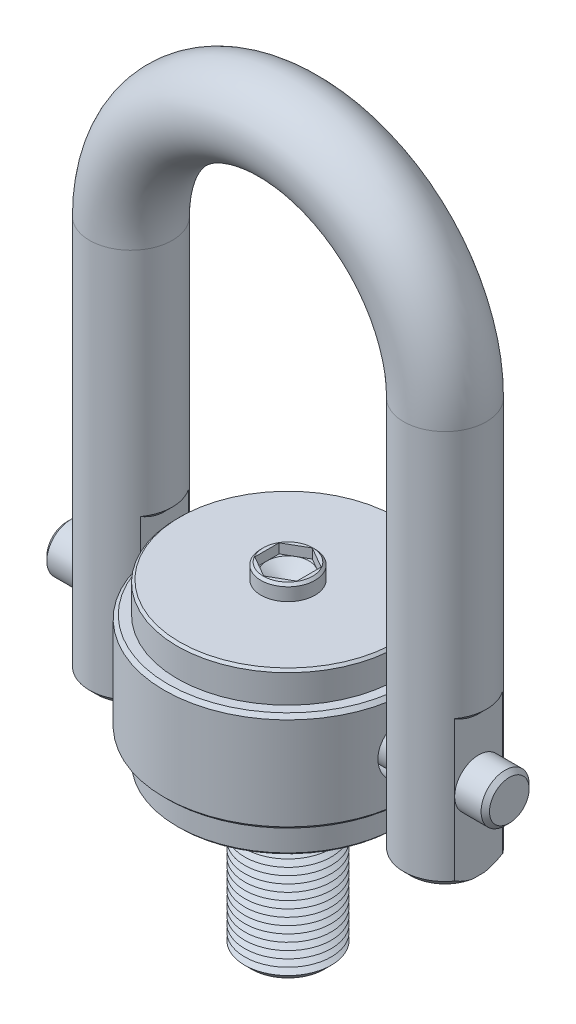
ISO-10303-21;
HEADER;
FILE_DESCRIPTION(('STEP AP214'),'2;1');
FILE_NAME('part.step','',(''),(''),'','','');
FILE_SCHEMA(('AUTOMOTIVE_DESIGN { 1 0 10303 214 1 1 1 1 }'));
ENDSEC;
DATA;
#1=APPLICATION_CONTEXT('core data for automotive mechanical design processes');
#2=APPLICATION_PROTOCOL_DEFINITION('international standard','automotive_design',2000,#1);
#3=PRODUCT_CONTEXT('',#1,'mechanical');
#4=PRODUCT('Part','Part','',(#3));
#5=PRODUCT_RELATED_PRODUCT_CATEGORY('part','',(#4));
#6=PRODUCT_DEFINITION_FORMATION('','',#4);
#7=PRODUCT_DEFINITION_CONTEXT('part definition',#1,'design');
#8=PRODUCT_DEFINITION('design','',#6,#7);
#9=PRODUCT_DEFINITION_SHAPE('','',#8);
#10=(LENGTH_UNIT() NAMED_UNIT(*) SI_UNIT(.MILLI.,.METRE.));
#11=(NAMED_UNIT(*) PLANE_ANGLE_UNIT() SI_UNIT($,.RADIAN.));
#12=(NAMED_UNIT(*) SI_UNIT($,.STERADIAN.) SOLID_ANGLE_UNIT());
#13=UNCERTAINTY_MEASURE_WITH_UNIT(LENGTH_MEASURE(1.E-05),#10,'distance_accuracy_value','');
#14=(GEOMETRIC_REPRESENTATION_CONTEXT(3) GLOBAL_UNCERTAINTY_ASSIGNED_CONTEXT((#13)) GLOBAL_UNIT_ASSIGNED_CONTEXT((#10,
#11,#12)) REPRESENTATION_CONTEXT('',''));
#15=CARTESIAN_POINT('',(0.,0.,0.));
#16=DIRECTION('',(0.,0.,1.));
#17=DIRECTION('',(1.,0.,0.));
#18=AXIS2_PLACEMENT_3D('',#15,#16,#17);
#19=CARTESIAN_POINT('',(184.15,0.,0.));
#20=DIRECTION('',(-1.,0.,0.));
#21=DIRECTION('',(0.,0.,1.));
#22=AXIS2_PLACEMENT_3D('',#19,#20,#21);
#23=CYLINDRICAL_SURFACE('',#22,20.);
#24=CARTESIAN_POINT('',(-180.65,0.,0.));
#25=DIRECTION('',(1.,0.,0.));
#26=DIRECTION('',(0.,0.,-1.));
#27=AXIS2_PLACEMENT_3D('',#24,#25,#26);
#28=CIRCLE('',#27,20.);
#29=CARTESIAN_POINT('',(-180.65,0.,-20.));
#30=VERTEX_POINT('',#29);
#31=EDGE_CURVE('P0_E25',#30,#30,#28,.T.);
#32=ORIENTED_EDGE('',*,*,#31,.T.);
#33=EDGE_LOOP('',(#32));
#34=FACE_BOUND('',#33,.T.);
#35=CARTESIAN_POINT('',(180.65,0.,0.));
#36=DIRECTION('',(1.,0.,0.));
#37=DIRECTION('',(0.,0.,-1.));
#38=AXIS2_PLACEMENT_3D('',#35,#36,#37);
#39=CIRCLE('',#38,20.);
#40=CARTESIAN_POINT('',(180.65,0.,-20.));
#41=VERTEX_POINT('',#40);
#42=EDGE_CURVE('P0_E29',#41,#41,#39,.F.);
#43=ORIENTED_EDGE('',*,*,#42,.T.);
#44=EDGE_LOOP('',(#43));
#45=FACE_BOUND('',#44,.T.);
#46=ADVANCED_FACE('P0_F14',(#34,#45),#23,.T.);
#47=CARTESIAN_POINT('',(184.15,0.,0.));
#48=DIRECTION('',(1.,0.,0.));
#49=DIRECTION('',(0.,0.,-1.));
#50=AXIS2_PLACEMENT_3D('',#47,#48,#49);
#51=PLANE('',#50);
#52=CARTESIAN_POINT('',(184.15,0.,0.));
#53=DIRECTION('',(1.,0.,0.));
#54=DIRECTION('',(0.,0.,-1.));
#55=AXIS2_PLACEMENT_3D('',#52,#53,#54);
#56=CIRCLE('',#55,16.5);
#57=CARTESIAN_POINT('',(184.15,0.,-16.5));
#58=VERTEX_POINT('',#57);
#59=EDGE_CURVE('P0_E10',#58,#58,#56,.T.);
#60=ORIENTED_EDGE('',*,*,#59,.T.);
#61=EDGE_LOOP('',(#60));
#62=FACE_BOUND('',#61,.T.);
#63=ADVANCED_FACE('P0_F46',(#62),#51,.T.);
#64=CARTESIAN_POINT('',(-184.15,0.,0.));
#65=DIRECTION('',(1.,0.,0.));
#66=DIRECTION('',(0.,0.,-1.));
#67=AXIS2_PLACEMENT_3D('',#64,#65,#66);
#68=PLANE('',#67);
#69=CARTESIAN_POINT('',(-184.15,0.,0.));
#70=DIRECTION('',(1.,0.,0.));
#71=DIRECTION('',(0.,0.,-1.));
#72=AXIS2_PLACEMENT_3D('',#69,#70,#71);
#73=CIRCLE('',#72,16.5);
#74=CARTESIAN_POINT('',(-184.15,0.,-16.5));
#75=VERTEX_POINT('',#74);
#76=EDGE_CURVE('P0_E21',#75,#75,#73,.F.);
#77=ORIENTED_EDGE('',*,*,#76,.T.);
#78=EDGE_LOOP('',(#77));
#79=FACE_BOUND('',#78,.T.);
#80=ADVANCED_FACE('P0_F43',(#79),#68,.F.);
#81=CARTESIAN_POINT('',(-180.65,0.,0.));
#82=DIRECTION('',(1.,0.,0.));
#83=DIRECTION('',(0.,0.,-1.));
#84=AXIS2_PLACEMENT_3D('',#81,#82,#83);
#85=CONICAL_SURFACE('',#84,20.,0.785398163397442);
#86=ORIENTED_EDGE('',*,*,#76,.F.);
#87=EDGE_LOOP('',(#86));
#88=FACE_BOUND('',#87,.T.);
#89=ORIENTED_EDGE('',*,*,#31,.F.);
#90=EDGE_LOOP('',(#89));
#91=FACE_BOUND('',#90,.T.);
#92=ADVANCED_FACE('P0_F38',(#88,#91),#85,.T.);
#93=CARTESIAN_POINT('',(184.15,0.,0.));
#94=DIRECTION('',(-1.,0.,0.));
#95=DIRECTION('',(0.,0.,1.));
#96=AXIS2_PLACEMENT_3D('',#93,#94,#95);
#97=CONICAL_SURFACE('',#96,16.5,0.785398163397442);
#98=ORIENTED_EDGE('',*,*,#42,.F.);
#99=EDGE_LOOP('',(#98));
#100=FACE_BOUND('',#99,.T.);
#101=ORIENTED_EDGE('',*,*,#59,.F.);
#102=EDGE_LOOP('',(#101));
#103=FACE_BOUND('',#102,.T.);
#104=ADVANCED_FACE('P0_F16',(#100,#103),#97,.T.);
#105=CLOSED_SHELL('',(#46,#63,#80,#92,#104));
#106=MANIFOLD_SOLID_BREP('P0_B1',#105);
#107=CARTESIAN_POINT('',(-102.655709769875,63.05,20.));
#108=DIRECTION('',(-1.,0.,0.));
#109=DIRECTION('',(0.,0.,1.));
#110=AXIS2_PLACEMENT_3D('',#107,#108,#109);
#111=PLANE('',#110);
#112=DIRECTION('',(0.,-1.,0.));
#113=VECTOR('',#112,1.);
#114=CARTESIAN_POINT('',(-102.655709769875,63.05,20.));
#115=LINE('',#114,#113);
#116=CARTESIAN_POINT('',(-102.655709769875,71.0500000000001,20.));
#117=VERTEX_POINT('',#116);
#118=CARTESIAN_POINT('',(-102.655709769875,0.,20.));
#119=VERTEX_POINT('',#118);
#120=EDGE_CURVE('P1_E184',#117,#119,#115,.T.);
#121=ORIENTED_EDGE('',*,*,#120,.T.);
#122=CARTESIAN_POINT('',(-102.655709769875,0.,0.));
#123=DIRECTION('',(-1.,0.,0.));
#124=DIRECTION('',(0.,0.,1.));
#125=AXIS2_PLACEMENT_3D('',#122,#123,#124);
#126=CIRCLE('',#125,20.);
#127=CARTESIAN_POINT('',(-102.655709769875,0.,-20.));
#128=VERTEX_POINT('',#127);
#129=EDGE_CURVE('P1_E31',#119,#128,#126,.T.);
#130=ORIENTED_EDGE('',*,*,#129,.T.);
#131=DIRECTION('',(0.,-1.,0.));
#132=VECTOR('',#131,1.);
#133=CARTESIAN_POINT('',(-102.655709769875,63.05,-20.));
#134=LINE('',#133,#132);
#135=CARTESIAN_POINT('',(-102.655709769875,71.0500000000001,-20.));
#136=VERTEX_POINT('',#135);
#137=EDGE_CURVE('P1_E180',#136,#128,#134,.T.);
#138=ORIENTED_EDGE('',*,*,#137,.F.);
#139=CARTESIAN_POINT('',(-102.655709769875,71.0500000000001,-20.));
#140=CARTESIAN_POINT('',(-102.655709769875,70.7542478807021,-19.4908646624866));
#141=CARTESIAN_POINT('',(-102.655709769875,70.4640102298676,-18.9784822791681));
#142=CARTESIAN_POINT('',(-102.655709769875,69.8962135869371,-17.94657210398));
#143=CARTESIAN_POINT('',(-102.655709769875,69.618657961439,-17.42704246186));
#144=CARTESIAN_POINT('',(-102.655709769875,69.0769287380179,-16.378316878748));
#145=CARTESIAN_POINT('',(-102.655709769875,68.8128144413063,-15.8490901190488));
#146=CARTESIAN_POINT('',(-102.655709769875,68.3013316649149,-14.7827015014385));
#147=CARTESIAN_POINT('',(-102.655709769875,68.053962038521,-14.2455401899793));
#148=CARTESIAN_POINT('',(-102.655709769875,67.3333709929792,-12.6054664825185));
#149=CARTESIAN_POINT('',(-102.655709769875,66.8896457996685,-11.4891124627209));
#150=CARTESIAN_POINT('',(-102.655709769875,66.3003812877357,-9.78924399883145));
#151=CARTESIAN_POINT('',(-102.655709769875,66.1167744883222,-9.2187755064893));
#152=CARTESIAN_POINT('',(-102.655709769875,65.7779596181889,-8.06943835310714));
#153=CARTESIAN_POINT('',(-102.655709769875,65.6227478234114,-7.49057080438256));
#154=CARTESIAN_POINT('',(-102.655709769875,65.3869948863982,-6.50571408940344));
#155=CARTESIAN_POINT('',(-102.655709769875,65.2982126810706,-6.10168388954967));
#156=CARTESIAN_POINT('',(-102.655709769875,65.1366036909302,-5.29045039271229));
#157=CARTESIAN_POINT('',(-102.655709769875,65.0637759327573,-4.88324729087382));
#158=CARTESIAN_POINT('',(-102.655709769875,64.9349075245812,-4.06608643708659));
#159=CARTESIAN_POINT('',(-102.655709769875,64.8788709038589,-3.65612804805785));
#160=CARTESIAN_POINT('',(-102.655709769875,64.7843076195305,-2.83418867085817));
#161=CARTESIAN_POINT('',(-102.655709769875,64.7457809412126,-2.42220768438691));
#162=CARTESIAN_POINT('',(-102.655709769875,64.68694103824,-1.59970188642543));
#163=CARTESIAN_POINT('',(-102.655709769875,64.6665081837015,-1.18918565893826));
#164=CARTESIAN_POINT('',(-102.655709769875,64.6436938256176,-0.367653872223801));
#165=CARTESIAN_POINT('',(-102.655709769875,64.6413121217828,0.0433616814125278));
#166=CARTESIAN_POINT('',(-102.655709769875,64.6546283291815,0.864900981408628));
#167=CARTESIAN_POINT('',(-102.655709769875,64.670317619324,1.27542486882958));
#168=CARTESIAN_POINT('',(-102.655709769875,64.7195495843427,2.09535985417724));
#169=CARTESIAN_POINT('',(-102.655709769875,64.7530904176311,2.50477106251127));
#170=CARTESIAN_POINT('',(-102.655709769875,64.8274608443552,3.22392431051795));
#171=CARTESIAN_POINT('',(-102.655709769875,64.8646205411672,3.5340518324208));
#172=CARTESIAN_POINT('',(-102.655709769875,64.9487381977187,4.15301860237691));
#173=CARTESIAN_POINT('',(-102.655709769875,64.9956976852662,4.46185764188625));
#174=CARTESIAN_POINT('',(-102.655709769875,65.1328641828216,5.2791652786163));
#175=CARTESIAN_POINT('',(-102.655709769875,65.2312856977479,5.78627568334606));
#176=CARTESIAN_POINT('',(-102.655709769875,65.4523008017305,6.79523290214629));
#177=CARTESIAN_POINT('',(-102.655709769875,65.5748992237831,7.29707864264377));
#178=CARTESIAN_POINT('',(-102.655709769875,65.9762913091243,8.79445187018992));
#179=CARTESIAN_POINT('',(-102.655709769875,66.2885603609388,9.78111989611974));
#180=CARTESIAN_POINT('',(-102.655709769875,66.987423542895,11.7315802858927));
#181=CARTESIAN_POINT('',(-102.655709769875,67.3743078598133,12.6952662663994));
#182=CARTESIAN_POINT('',(-102.655709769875,68.2067169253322,14.596383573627));
#183=CARTESIAN_POINT('',(-102.655709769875,68.6522205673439,15.5338242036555));
#184=CARTESIAN_POINT('',(-102.655709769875,69.2732505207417,16.7599102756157));
#185=CARTESIAN_POINT('',(-102.655709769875,69.4279893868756,17.0592974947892));
#186=CARTESIAN_POINT('',(-102.655709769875,69.7420291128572,17.6556321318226));
#187=CARTESIAN_POINT('',(-102.655709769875,69.9013294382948,17.9525798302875));
#188=CARTESIAN_POINT('',(-102.655709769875,70.3838408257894,18.8367014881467));
#189=CARTESIAN_POINT('',(-102.655709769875,70.7133440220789,19.4204572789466));
#190=CARTESIAN_POINT('',(-102.655709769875,71.0500000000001,20.));
#191=B_SPLINE_CURVE_WITH_KNOTS('',3,(#139,#140,#141,#142,#143,#144,#145,#146,#147,#148,#149,
#150,#151,#152,#153,#154,#155,#156,#157,#158,#159,#160,#161,#162,#163,#164,#165,#166,#167,#168,
#169,#170,#171,#172,#173,#174,#175,#176,#177,#178,#179,#180,#181,#182,#183,#184,#185,#186,#187,
#188,#189,#190),.UNSPECIFIED.,.F.,.F.,(4,2,2,2,2,2,2,2,2,2,2,2,2,2,2,2,2,2,2,2,2,2,2,2,2,4),(0.,
1.76642390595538,3.53331403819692,5.30742236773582,7.08140907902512,10.6806565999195,
12.4779563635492,14.2750202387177,15.51574792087,16.7563998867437,17.9973493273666,
19.2382977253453,20.4709788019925,21.7036462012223,22.9357257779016,24.1676782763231,
25.1045608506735,26.0415895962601,27.5906110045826,29.1399423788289,32.2407150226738,
35.3537993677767,38.4657658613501,39.4767837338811,40.4876836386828,42.4983674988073),.UNSPECIFIED.);
#192=EDGE_CURVE('P1_E296',#136,#117,#191,.T.);
#193=ORIENTED_EDGE('',*,*,#192,.T.);
#194=EDGE_LOOP('',(#121,#130,#138,#193));
#195=FACE_BOUND('',#194,.T.);
#196=ADVANCED_FACE('P1_F16',(#195),#111,.F.);
#197=CARTESIAN_POINT('',(-158.694290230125,48.05,20.));
#198=DIRECTION('',(1.,0.,0.));
#199=DIRECTION('',(0.,0.,-1.));
#200=AXIS2_PLACEMENT_3D('',#197,#198,#199);
#201=PLANE('',#200);
#202=DIRECTION('',(0.,-1.,0.));
#203=VECTOR('',#202,1.);
#204=CARTESIAN_POINT('',(-158.694290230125,48.05,-20.));
#205=LINE('',#204,#203);
#206=CARTESIAN_POINT('',(-158.694290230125,56.05,-20.));
#207=VERTEX_POINT('',#206);
#208=CARTESIAN_POINT('',(-158.694290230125,0.,-20.));
#209=VERTEX_POINT('',#208);
#210=EDGE_CURVE('P1_E152',#207,#209,#205,.T.);
#211=ORIENTED_EDGE('',*,*,#210,.T.);
#212=CARTESIAN_POINT('',(-158.694290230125,0.,0.));
#213=DIRECTION('',(1.,0.,0.));
#214=DIRECTION('',(0.,0.,-1.));
#215=AXIS2_PLACEMENT_3D('',#212,#213,#214);
#216=CIRCLE('',#215,20.);
#217=CARTESIAN_POINT('',(-158.694290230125,0.,20.));
#218=VERTEX_POINT('',#217);
#219=EDGE_CURVE('P1_E38',#218,#209,#216,.F.);
#220=ORIENTED_EDGE('',*,*,#219,.F.);
#221=DIRECTION('',(0.,-1.,0.));
#222=VECTOR('',#221,1.);
#223=CARTESIAN_POINT('',(-158.694290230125,48.05,20.));
#224=LINE('',#223,#222);
#225=CARTESIAN_POINT('',(-158.694290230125,56.05,20.));
#226=VERTEX_POINT('',#225);
#227=EDGE_CURVE('P1_E150',#226,#218,#224,.T.);
#228=ORIENTED_EDGE('',*,*,#227,.F.);
#229=CARTESIAN_POINT('',(-158.694290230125,56.05,20.));
#230=CARTESIAN_POINT('',(-158.694290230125,55.7542478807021,19.4908646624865));
#231=CARTESIAN_POINT('',(-158.694290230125,55.4640102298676,18.9784822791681));
#232=CARTESIAN_POINT('',(-158.694290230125,54.8962135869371,17.9465721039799));
#233=CARTESIAN_POINT('',(-158.694290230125,54.618657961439,17.42704246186));
#234=CARTESIAN_POINT('',(-158.694290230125,54.0769287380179,16.3783168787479));
#235=CARTESIAN_POINT('',(-158.694290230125,53.8128144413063,15.8490901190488));
#236=CARTESIAN_POINT('',(-158.694290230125,53.3013316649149,14.7827015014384));
#237=CARTESIAN_POINT('',(-158.694290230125,53.053962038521,14.2455401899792));
#238=CARTESIAN_POINT('',(-158.694290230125,52.3333709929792,12.6054664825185));
#239=CARTESIAN_POINT('',(-158.694290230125,51.8896457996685,11.4891124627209));
#240=CARTESIAN_POINT('',(-158.694290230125,51.3003812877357,9.78924399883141));
#241=CARTESIAN_POINT('',(-158.694290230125,51.1167744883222,9.21877550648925));
#242=CARTESIAN_POINT('',(-158.694290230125,50.7779596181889,8.06943835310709));
#243=CARTESIAN_POINT('',(-158.694290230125,50.6227478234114,7.49057080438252));
#244=CARTESIAN_POINT('',(-158.694290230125,50.3869948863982,6.50571408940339));
#245=CARTESIAN_POINT('',(-158.694290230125,50.2982126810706,6.10168388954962));
#246=CARTESIAN_POINT('',(-158.694290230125,50.1366036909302,5.29045039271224));
#247=CARTESIAN_POINT('',(-158.694290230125,50.0637759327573,4.88324729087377));
#248=CARTESIAN_POINT('',(-158.694290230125,49.9349075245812,4.06608643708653));
#249=CARTESIAN_POINT('',(-158.694290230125,49.8788709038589,3.6561280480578));
#250=CARTESIAN_POINT('',(-158.694290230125,49.7843076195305,2.83418867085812));
#251=CARTESIAN_POINT('',(-158.694290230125,49.7457809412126,2.42220768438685));
#252=CARTESIAN_POINT('',(-158.694290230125,49.68694103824,1.59970188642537));
#253=CARTESIAN_POINT('',(-158.694290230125,49.6665081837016,1.1891856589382));
#254=CARTESIAN_POINT('',(-158.694290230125,49.6436938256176,0.367653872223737));
#255=CARTESIAN_POINT('',(-158.694290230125,49.6413121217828,-0.0433616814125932));
#256=CARTESIAN_POINT('',(-158.694290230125,49.6546283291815,-0.864900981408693));
#257=CARTESIAN_POINT('',(-158.694290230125,49.670317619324,-1.27542486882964));
#258=CARTESIAN_POINT('',(-158.694290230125,49.7195495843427,-2.09535985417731));
#259=CARTESIAN_POINT('',(-158.694290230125,49.7530904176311,-2.50477106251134));
#260=CARTESIAN_POINT('',(-158.694290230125,49.8274608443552,-3.22392431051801));
#261=CARTESIAN_POINT('',(-158.694290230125,49.8646205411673,-3.53405183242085));
#262=CARTESIAN_POINT('',(-158.694290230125,49.9487381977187,-4.15301860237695));
#263=CARTESIAN_POINT('',(-158.694290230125,49.9956976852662,-4.46185764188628));
#264=CARTESIAN_POINT('',(-158.694290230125,50.1328641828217,-5.27916527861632));
#265=CARTESIAN_POINT('',(-158.694290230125,50.2312856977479,-5.78627568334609));
#266=CARTESIAN_POINT('',(-158.694290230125,50.4523008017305,-6.79523290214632));
#267=CARTESIAN_POINT('',(-158.694290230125,50.5748992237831,-7.2970786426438));
#268=CARTESIAN_POINT('',(-158.694290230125,50.9762913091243,-8.79445187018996));
#269=CARTESIAN_POINT('',(-158.694290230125,51.2885603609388,-9.78111989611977));
#270=CARTESIAN_POINT('',(-158.694290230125,51.987423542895,-11.7315802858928));
#271=CARTESIAN_POINT('',(-158.694290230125,52.3743078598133,-12.6952662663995));
#272=CARTESIAN_POINT('',(-158.694290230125,53.2067169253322,-14.596383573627));
#273=CARTESIAN_POINT('',(-158.694290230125,53.6522205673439,-15.5338242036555));
#274=CARTESIAN_POINT('',(-158.694290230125,54.2732505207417,-16.7599102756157));
#275=CARTESIAN_POINT('',(-158.694290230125,54.4279893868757,-17.0592974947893));
#276=CARTESIAN_POINT('',(-158.694290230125,54.7420291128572,-17.6556321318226));
#277=CARTESIAN_POINT('',(-158.694290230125,54.9013294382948,-17.9525798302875));
#278=CARTESIAN_POINT('',(-158.694290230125,55.3838408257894,-18.8367014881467));
#279=CARTESIAN_POINT('',(-158.694290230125,55.7133440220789,-19.4204572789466));
#280=CARTESIAN_POINT('',(-158.694290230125,56.0500000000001,-19.9999999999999));
#281=B_SPLINE_CURVE_WITH_KNOTS('',3,(#229,#230,#231,#232,#233,#234,#235,#236,#237,#238,#239,
#240,#241,#242,#243,#244,#245,#246,#247,#248,#249,#250,#251,#252,#253,#254,#255,#256,#257,#258,
#259,#260,#261,#262,#263,#264,#265,#266,#267,#268,#269,#270,#271,#272,#273,#274,#275,#276,#277,
#278,#279,#280),.UNSPECIFIED.,.F.,.F.,(4,2,2,2,2,2,2,2,2,2,2,2,2,2,2,2,2,2,2,2,2,2,2,2,2,4),(0.,
1.76642390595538,3.53331403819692,5.30742236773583,7.08140907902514,10.6806565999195,
12.4779563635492,14.2750202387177,15.5157479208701,16.7563998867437,17.9973493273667,
19.2382977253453,20.4709788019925,21.7036462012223,22.9357257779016,24.1676782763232,
25.1045608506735,26.04158959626,27.5906110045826,29.1399423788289,32.2407150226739,
35.3537993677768,38.4657658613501,39.4767837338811,40.4876836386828,42.4983674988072),.UNSPECIFIED.);
#282=EDGE_CURVE('P1_E303',#226,#207,#281,.T.);
#283=ORIENTED_EDGE('',*,*,#282,.T.);
#284=EDGE_LOOP('',(#211,#220,#228,#283));
#285=FACE_BOUND('',#284,.T.);
#286=ADVANCED_FACE('P1_F147',(#285),#201,.F.);
#287=CARTESIAN_POINT('',(102.655709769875,63.05,20.));
#288=DIRECTION('',(-1.,0.,0.));
#289=DIRECTION('',(0.,0.,1.));
#290=AXIS2_PLACEMENT_3D('',#287,#288,#289);
#291=PLANE('',#290);
#292=CARTESIAN_POINT('',(102.655709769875,0.,0.));
#293=DIRECTION('',(-1.,0.,0.));
#294=DIRECTION('',(0.,0.,1.));
#295=AXIS2_PLACEMENT_3D('',#292,#293,#294);
#296=CIRCLE('',#295,20.);
#297=CARTESIAN_POINT('',(102.655709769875,0.,20.));
#298=VERTEX_POINT('',#297);
#299=CARTESIAN_POINT('',(102.655709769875,0.,-20.));
#300=VERTEX_POINT('',#299);
#301=EDGE_CURVE('P1_E370',#298,#300,#296,.T.);
#302=ORIENTED_EDGE('',*,*,#301,.F.);
#303=DIRECTION('',(0.,-1.,0.));
#304=VECTOR('',#303,1.);
#305=CARTESIAN_POINT('',(102.655709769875,63.05,20.));
#306=LINE('',#305,#304);
#307=CARTESIAN_POINT('',(102.655709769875,71.0500000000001,20.));
#308=VERTEX_POINT('',#307);
#309=EDGE_CURVE('P1_E387',#308,#298,#306,.T.);
#310=ORIENTED_EDGE('',*,*,#309,.F.);
#311=CARTESIAN_POINT('',(102.655709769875,71.0500000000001,20.));
#312=CARTESIAN_POINT('',(102.655709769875,70.8793027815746,19.7061815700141));
#313=CARTESIAN_POINT('',(102.655709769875,70.7104642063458,19.4112854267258));
#314=CARTESIAN_POINT('',(102.655709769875,70.3767966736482,18.8192189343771));
#315=CARTESIAN_POINT('',(102.655709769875,70.2119678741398,18.5220484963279));
#316=CARTESIAN_POINT('',(102.655709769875,69.7238231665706,17.6267412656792));
#317=CARTESIAN_POINT('',(102.655709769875,69.4069873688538,17.0250458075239));
#318=CARTESIAN_POINT('',(102.655709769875,68.7912748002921,15.8071681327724));
#319=CARTESIAN_POINT('',(102.655709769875,68.4925405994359,15.1909136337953));
#320=CARTESIAN_POINT('',(102.655709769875,67.9188947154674,13.9474530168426));
#321=CARTESIAN_POINT('',(102.655709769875,67.643980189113,13.320248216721));
#322=CARTESIAN_POINT('',(102.655709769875,67.1196707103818,12.049157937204));
#323=CARTESIAN_POINT('',(102.655709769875,66.8705042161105,11.4051776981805));
#324=CARTESIAN_POINT('',(102.655709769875,66.4047237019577,10.1054124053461));
#325=CARTESIAN_POINT('',(102.655709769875,66.1881124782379,9.44962634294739));
#326=CARTESIAN_POINT('',(102.655709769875,65.7927947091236,8.12868311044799));
#327=CARTESIAN_POINT('',(102.655709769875,65.6139816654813,7.46355805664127));
#328=CARTESIAN_POINT('',(102.655709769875,65.2982442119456,6.12356059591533));
#329=CARTESIAN_POINT('',(102.655709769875,65.161307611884,5.44869108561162));
#330=CARTESIAN_POINT('',(102.655709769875,64.9305825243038,4.07382187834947));
#331=CARTESIAN_POINT('',(102.655709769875,64.8379836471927,3.37362024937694));
#332=CARTESIAN_POINT('',(102.655709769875,64.7046147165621,1.96811453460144));
#333=CARTESIAN_POINT('',(102.655709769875,64.6638540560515,1.26280954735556));
#334=CARTESIAN_POINT('',(102.655709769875,64.6358817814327,-0.144594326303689));
#335=CARTESIAN_POINT('',(102.655709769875,64.6483477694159,-0.84668680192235));
#336=CARTESIAN_POINT('',(102.655709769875,64.7256190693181,-2.24801087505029));
#337=CARTESIAN_POINT('',(102.655709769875,64.7904261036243,-2.94724237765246));
#338=CARTESIAN_POINT('',(102.655709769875,64.9445112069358,-4.14242090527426));
#339=CARTESIAN_POINT('',(102.655709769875,65.0216985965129,-4.63997514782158));
#340=CARTESIAN_POINT('',(102.655709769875,65.2003166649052,-5.63076109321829));
#341=CARTESIAN_POINT('',(102.655709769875,65.3017496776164,-6.12399237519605));
#342=CARTESIAN_POINT('',(102.655709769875,65.5272429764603,-7.10544054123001));
#343=CARTESIAN_POINT('',(102.655709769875,65.6513124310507,-7.59365530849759));
#344=CARTESIAN_POINT('',(102.655709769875,65.920241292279,-8.56434978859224));
#345=CARTESIAN_POINT('',(102.655709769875,66.0651033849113,-9.04682875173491));
#346=CARTESIAN_POINT('',(102.655709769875,66.5301075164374,-10.4914162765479));
#347=CARTESIAN_POINT('',(102.655709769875,66.879157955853,-11.4442964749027));
#348=CARTESIAN_POINT('',(102.655709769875,67.6391687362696,-13.3243400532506));
#349=CARTESIAN_POINT('',(102.655709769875,68.0501166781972,-14.2515085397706));
#350=CARTESIAN_POINT('',(102.655709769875,68.8797417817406,-15.9942826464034));
#351=CARTESIAN_POINT('',(102.655709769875,69.2938950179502,-16.8120576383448));
#352=CARTESIAN_POINT('',(102.655709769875,69.93783415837,-18.0216306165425));
#353=CARTESIAN_POINT('',(102.655709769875,70.1551827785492,-18.4201249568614));
#354=CARTESIAN_POINT('',(102.655709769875,70.5972510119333,-19.2130527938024));
#355=CARTESIAN_POINT('',(102.655709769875,70.8219712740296,-19.6074859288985));
#356=CARTESIAN_POINT('',(102.655709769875,71.0500000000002,-20.));
#357=B_SPLINE_CURVE_WITH_KNOTS('',3,(#311,#312,#313,#314,#315,#316,#317,#318,#319,#320,#321,
#322,#323,#324,#325,#326,#327,#328,#329,#330,#331,#332,#333,#334,#335,#336,#337,#338,#339,#340,
#341,#342,#343,#344,#345,#346,#347,#348,#349,#350,#351,#352,#353,#354,#355,#356),.UNSPECIFIED.,
.F.,.F.,(4,2,2,2,2,2,2,2,2,2,2,2,2,2,2,2,2,2,2,2,2,2,4),(0.,1.01939943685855,2.03883896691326,
4.07854176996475,6.13264369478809,8.18650009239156,10.2572468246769,12.3281713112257,
14.3931807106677,16.4575884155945,18.5746504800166,20.6920960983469,22.7967344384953,
24.9014420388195,26.4113766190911,27.9214566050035,29.4321495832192,30.9430378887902,
33.9844202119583,37.0251941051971,39.7742424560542,41.1359225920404,42.4977229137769),.UNSPECIFIED.);
#358=CARTESIAN_POINT('',(102.655709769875,71.0500000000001,-20.));
#359=VERTEX_POINT('',#358);
#360=EDGE_CURVE('P1_E210',#308,#359,#357,.T.);
#361=ORIENTED_EDGE('',*,*,#360,.T.);
#362=DIRECTION('',(0.,-1.,0.));
#363=VECTOR('',#362,1.);
#364=CARTESIAN_POINT('',(102.655709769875,63.05,-20.));
#365=LINE('',#364,#363);
#366=EDGE_CURVE('P1_E390',#359,#300,#365,.T.);
#367=ORIENTED_EDGE('',*,*,#366,.T.);
#368=EDGE_LOOP('',(#302,#310,#361,#367));
#369=FACE_BOUND('',#368,.T.);
#370=ADVANCED_FACE('P1_F429',(#369),#291,.T.);
#371=CARTESIAN_POINT('',(158.694290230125,48.05,20.));
#372=DIRECTION('',(1.,0.,0.));
#373=DIRECTION('',(0.,0.,-1.));
#374=AXIS2_PLACEMENT_3D('',#371,#372,#373);
#375=PLANE('',#374);
#376=CARTESIAN_POINT('',(158.694290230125,0.,0.));
#377=DIRECTION('',(1.,0.,0.));
#378=DIRECTION('',(0.,0.,-1.));
#379=AXIS2_PLACEMENT_3D('',#376,#377,#378);
#380=CIRCLE('',#379,20.);
#381=CARTESIAN_POINT('',(158.694290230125,0.,-20.));
#382=VERTEX_POINT('',#381);
#383=CARTESIAN_POINT('',(158.694290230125,0.,20.));
#384=VERTEX_POINT('',#383);
#385=EDGE_CURVE('P1_E153',#382,#384,#380,.T.);
#386=ORIENTED_EDGE('',*,*,#385,.F.);
#387=DIRECTION('',(0.,-1.,0.));
#388=VECTOR('',#387,1.);
#389=CARTESIAN_POINT('',(158.694290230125,48.05,-20.));
#390=LINE('',#389,#388);
#391=CARTESIAN_POINT('',(158.694290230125,56.0500000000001,-20.));
#392=VERTEX_POINT('',#391);
#393=EDGE_CURVE('P1_E376',#392,#382,#390,.T.);
#394=ORIENTED_EDGE('',*,*,#393,.F.);
#395=CARTESIAN_POINT('',(158.694290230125,56.0500000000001,-20.));
#396=CARTESIAN_POINT('',(158.694290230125,55.8793027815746,-19.7061815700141));
#397=CARTESIAN_POINT('',(158.694290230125,55.7104642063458,-19.4112854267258));
#398=CARTESIAN_POINT('',(158.694290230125,55.3767966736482,-18.8192189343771));
#399=CARTESIAN_POINT('',(158.694290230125,55.2119678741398,-18.5220484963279));
#400=CARTESIAN_POINT('',(158.694290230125,54.7238231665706,-17.6267412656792));
#401=CARTESIAN_POINT('',(158.694290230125,54.4069873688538,-17.0250458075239));
#402=CARTESIAN_POINT('',(158.694290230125,53.7912748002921,-15.8071681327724));
#403=CARTESIAN_POINT('',(158.694290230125,53.4925405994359,-15.1909136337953));
#404=CARTESIAN_POINT('',(158.694290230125,52.9188947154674,-13.9474530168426));
#405=CARTESIAN_POINT('',(158.694290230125,52.6439801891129,-13.320248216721));
#406=CARTESIAN_POINT('',(158.694290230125,52.1196707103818,-12.0491579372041));
#407=CARTESIAN_POINT('',(158.694290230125,51.8705042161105,-11.4051776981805));
#408=CARTESIAN_POINT('',(158.694290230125,51.4047237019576,-10.1054124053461));
#409=CARTESIAN_POINT('',(158.694290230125,51.1881124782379,-9.44962634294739));
#410=CARTESIAN_POINT('',(158.694290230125,50.7927947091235,-8.128683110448));
#411=CARTESIAN_POINT('',(158.694290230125,50.6139816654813,-7.46355805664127));
#412=CARTESIAN_POINT('',(158.694290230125,50.2982442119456,-6.12356059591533));
#413=CARTESIAN_POINT('',(158.694290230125,50.161307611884,-5.44869108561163));
#414=CARTESIAN_POINT('',(158.694290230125,49.9305825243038,-4.07382187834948));
#415=CARTESIAN_POINT('',(158.694290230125,49.8379836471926,-3.37362024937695));
#416=CARTESIAN_POINT('',(158.694290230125,49.7046147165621,-1.96811453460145));
#417=CARTESIAN_POINT('',(158.694290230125,49.6638540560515,-1.26280954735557));
#418=CARTESIAN_POINT('',(158.694290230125,49.6358817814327,0.144594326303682));
#419=CARTESIAN_POINT('',(158.694290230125,49.6483477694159,0.846686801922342));
#420=CARTESIAN_POINT('',(158.694290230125,49.725619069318,2.24801087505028));
#421=CARTESIAN_POINT('',(158.694290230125,49.7904261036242,2.94724237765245));
#422=CARTESIAN_POINT('',(158.694290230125,49.9445112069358,4.14242090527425));
#423=CARTESIAN_POINT('',(158.694290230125,50.0216985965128,4.63997514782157));
#424=CARTESIAN_POINT('',(158.694290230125,50.2003166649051,5.63076109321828));
#425=CARTESIAN_POINT('',(158.694290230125,50.3017496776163,6.12399237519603));
#426=CARTESIAN_POINT('',(158.694290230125,50.5272429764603,7.10544054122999));
#427=CARTESIAN_POINT('',(158.694290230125,50.6513124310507,7.59365530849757));
#428=CARTESIAN_POINT('',(158.694290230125,50.9202412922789,8.56434978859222));
#429=CARTESIAN_POINT('',(158.694290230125,51.0651033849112,9.04682875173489));
#430=CARTESIAN_POINT('',(158.694290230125,51.5301075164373,10.4914162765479));
#431=CARTESIAN_POINT('',(158.694290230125,51.879157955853,11.4442964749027));
#432=CARTESIAN_POINT('',(158.694290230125,52.6391687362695,13.3243400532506));
#433=CARTESIAN_POINT('',(158.694290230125,53.0501166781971,14.2515085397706));
#434=CARTESIAN_POINT('',(158.694290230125,53.8797417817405,15.9942826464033));
#435=CARTESIAN_POINT('',(158.694290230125,54.2938950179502,16.8120576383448));
#436=CARTESIAN_POINT('',(158.694290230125,54.9378341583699,18.0216306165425));
#437=CARTESIAN_POINT('',(158.694290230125,55.1551827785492,18.4201249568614));
#438=CARTESIAN_POINT('',(158.694290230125,55.5972510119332,19.2130527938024));
#439=CARTESIAN_POINT('',(158.694290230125,55.8219712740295,19.6074859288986));
#440=CARTESIAN_POINT('',(158.694290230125,56.0500000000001,20.));
#441=B_SPLINE_CURVE_WITH_KNOTS('',3,(#395,#396,#397,#398,#399,#400,#401,#402,#403,#404,#405,
#406,#407,#408,#409,#410,#411,#412,#413,#414,#415,#416,#417,#418,#419,#420,#421,#422,#423,#424,
#425,#426,#427,#428,#429,#430,#431,#432,#433,#434,#435,#436,#437,#438,#439,#440),.UNSPECIFIED.,
.F.,.F.,(4,2,2,2,2,2,2,2,2,2,2,2,2,2,2,2,2,2,2,2,2,2,4),(0.,1.01939943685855,2.03883896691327,
4.07854176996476,6.1326436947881,8.18650009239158,10.2572468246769,12.3281713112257,
14.3931807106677,16.4575884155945,18.5746504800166,20.6920960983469,22.7967344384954,
24.9014420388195,26.4113766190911,27.9214566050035,29.4321495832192,30.9430378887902,
33.9844202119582,37.025194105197,39.7742424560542,41.1359225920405,42.497722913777),.UNSPECIFIED.);
#442=CARTESIAN_POINT('',(158.694290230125,56.0500000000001,20.));
#443=VERTEX_POINT('',#442);
#444=EDGE_CURVE('P1_E202',#392,#443,#441,.T.);
#445=ORIENTED_EDGE('',*,*,#444,.T.);
#446=DIRECTION('',(0.,-1.,0.));
#447=VECTOR('',#446,1.);
#448=CARTESIAN_POINT('',(158.694290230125,48.05,20.));
#449=LINE('',#448,#447);
#450=EDGE_CURVE('P1_E381',#443,#384,#449,.T.);
#451=ORIENTED_EDGE('',*,*,#450,.T.);
#452=EDGE_LOOP('',(#386,#394,#445,#451));
#453=FACE_BOUND('',#452,.T.);
#454=ADVANCED_FACE('P1_F226',(#453),#375,.T.);
#455=CARTESIAN_POINT('',(130.675,-66.95,0.));
#456=DIRECTION('',(0.,-1.,0.));
#457=DIRECTION('',(0.,0.,1.));
#458=AXIS2_PLACEMENT_3D('',#455,#456,#457);
#459=PLANE('',#458);
#460=DIRECTION('',(0.,0.,-1.));
#461=VECTOR('',#460,1.);
#462=CARTESIAN_POINT('',(102.655709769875,-66.95,20.));
#463=LINE('',#462,#461);
#464=CARTESIAN_POINT('',(102.655709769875,-66.95,4.78539444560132));
#465=VERTEX_POINT('',#464);
#466=CARTESIAN_POINT('',(102.655709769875,-66.95,-4.78539444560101));
#467=VERTEX_POINT('',#466);
#468=EDGE_CURVE('P1_E379',#465,#467,#463,.T.);
#469=ORIENTED_EDGE('',*,*,#468,.T.);
#470=CARTESIAN_POINT('',(130.675,-66.95,0.));
#471=DIRECTION('',(0.,-1.,0.));
#472=DIRECTION('',(1.,0.,0.));
#473=AXIS2_PLACEMENT_3D('',#470,#471,#472);
#474=CIRCLE('',#473,28.4249999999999);
#475=CARTESIAN_POINT('',(158.694290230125,-66.95,-4.7853944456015));
#476=VERTEX_POINT('',#475);
#477=EDGE_CURVE('P1_E241',#467,#476,#474,.T.);
#478=ORIENTED_EDGE('',*,*,#477,.T.);
#479=DIRECTION('',(0.,0.,1.));
#480=VECTOR('',#479,1.);
#481=CARTESIAN_POINT('',(158.694290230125,-66.95,20.));
#482=LINE('',#481,#480);
#483=CARTESIAN_POINT('',(158.694290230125,-66.95,4.78539444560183));
#484=VERTEX_POINT('',#483);
#485=EDGE_CURVE('P1_E366',#476,#484,#482,.T.);
#486=ORIENTED_EDGE('',*,*,#485,.T.);
#487=CARTESIAN_POINT('',(130.675,-66.95,0.));
#488=DIRECTION('',(0.,-1.,0.));
#489=DIRECTION('',(1.,0.,0.));
#490=AXIS2_PLACEMENT_3D('',#487,#488,#489);
#491=CIRCLE('',#490,28.425);
#492=CARTESIAN_POINT('',(130.675,-66.95,28.425));
#493=VERTEX_POINT('',#492);
#494=EDGE_CURVE('P1_E415',#484,#493,#491,.T.);
#495=ORIENTED_EDGE('',*,*,#494,.T.);
#496=CARTESIAN_POINT('',(130.675,-66.95,0.));
#497=DIRECTION('',(0.,-1.,0.));
#498=DIRECTION('',(1.,0.,0.));
#499=AXIS2_PLACEMENT_3D('',#496,#497,#498);
#500=CIRCLE('',#499,28.425);
#501=EDGE_CURVE('P1_E413',#493,#465,#500,.T.);
#502=ORIENTED_EDGE('',*,*,#501,.T.);
#503=EDGE_LOOP('',(#469,#478,#486,#495,#502));
#504=FACE_BOUND('',#503,.T.);
#505=ADVANCED_FACE('P1_F419',(#504),#459,.T.);
#506=CARTESIAN_POINT('',(130.675,263.25,0.));
#507=DIRECTION('',(0.,-1.,0.));
#508=DIRECTION('',(1.,0.,0.));
#509=AXIS2_PLACEMENT_3D('',#506,#507,#508);
#510=CYLINDRICAL_SURFACE('',#509,34.425);
#511=CARTESIAN_POINT('',(130.675,263.25,0.));
#512=DIRECTION('',(0.,-1.,0.));
#513=DIRECTION('',(0.,0.,1.));
#514=AXIS2_PLACEMENT_3D('',#511,#512,#513);
#515=CIRCLE('',#514,34.425);
#516=CARTESIAN_POINT('',(165.1,263.25,0.));
#517=VERTEX_POINT('',#516);
#518=EDGE_CURVE('P1_E189',#517,#517,#515,.T.);
#519=ORIENTED_EDGE('',*,*,#518,.T.);
#520=EDGE_LOOP('',(#519));
#521=FACE_BOUND('',#520,.T.);
#522=ORIENTED_EDGE('',*,*,#393,.T.);
#523=CARTESIAN_POINT('',(158.694290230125,-60.9499999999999,-20.));
#524=VERTEX_POINT('',#523);
#525=EDGE_CURVE('P1_E380',#382,#524,#390,.T.);
#526=ORIENTED_EDGE('',*,*,#525,.T.);
#527=CARTESIAN_POINT('',(130.675,-60.9499999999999,0.));
#528=DIRECTION('',(0.,-1.,0.));
#529=DIRECTION('',(0.,0.,-1.));
#530=AXIS2_PLACEMENT_3D('',#527,#528,#529);
#531=CIRCLE('',#530,34.425);
#532=CARTESIAN_POINT('',(102.655709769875,-60.9499999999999,-20.));
#533=VERTEX_POINT('',#532);
#534=EDGE_CURVE('P1_E404',#524,#533,#531,.F.);
#535=ORIENTED_EDGE('',*,*,#534,.T.);
#536=EDGE_CURVE('P1_E386',#300,#533,#365,.T.);
#537=ORIENTED_EDGE('',*,*,#536,.F.);
#538=ORIENTED_EDGE('',*,*,#366,.F.);
#539=CARTESIAN_POINT('',(130.675,71.0500000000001,0.));
#540=DIRECTION('',(0.,-1.,0.));
#541=DIRECTION('',(0.,0.,-1.));
#542=AXIS2_PLACEMENT_3D('',#539,#540,#541);
#543=CIRCLE('',#542,34.425);
#544=EDGE_CURVE('P1_E192',#359,#308,#543,.F.);
#545=ORIENTED_EDGE('',*,*,#544,.T.);
#546=ORIENTED_EDGE('',*,*,#309,.T.);
#547=CARTESIAN_POINT('',(102.655709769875,-60.9499999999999,20.));
#548=VERTEX_POINT('',#547);
#549=EDGE_CURVE('P1_E389',#298,#548,#306,.T.);
#550=ORIENTED_EDGE('',*,*,#549,.T.);
#551=CARTESIAN_POINT('',(130.675,-60.9499999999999,0.));
#552=DIRECTION('',(0.,-1.,0.));
#553=DIRECTION('',(0.,0.,-1.));
#554=AXIS2_PLACEMENT_3D('',#551,#552,#553);
#555=CIRCLE('',#554,34.425);
#556=CARTESIAN_POINT('',(130.675,-60.9499999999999,34.425));
#557=VERTEX_POINT('',#556);
#558=EDGE_CURVE('P1_E408',#548,#557,#555,.F.);
#559=ORIENTED_EDGE('',*,*,#558,.T.);
#560=CARTESIAN_POINT('',(130.675,-60.9499999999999,0.));
#561=DIRECTION('',(0.,-1.,0.));
#562=DIRECTION('',(0.,0.,-1.));
#563=AXIS2_PLACEMENT_3D('',#560,#561,#562);
#564=CIRCLE('',#563,34.425);
#565=CARTESIAN_POINT('',(158.694290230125,-60.9499999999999,20.));
#566=VERTEX_POINT('',#565);
#567=EDGE_CURVE('P1_E423',#557,#566,#564,.F.);
#568=ORIENTED_EDGE('',*,*,#567,.T.);
#569=EDGE_CURVE('P1_E375',#384,#566,#449,.T.);
#570=ORIENTED_EDGE('',*,*,#569,.F.);
#571=ORIENTED_EDGE('',*,*,#450,.F.);
#572=CARTESIAN_POINT('',(130.675,56.0500000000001,0.));
#573=DIRECTION('',(0.,-1.,0.));
#574=DIRECTION('',(0.,0.,-1.));
#575=AXIS2_PLACEMENT_3D('',#572,#573,#574);
#576=CIRCLE('',#575,34.425);
#577=EDGE_CURVE('P1_E195',#443,#392,#576,.F.);
#578=ORIENTED_EDGE('',*,*,#577,.T.);
#579=EDGE_LOOP('',(#522,#526,#535,#537,#538,#545,#546,#550,#559,#568,#570,#571,#578));
#580=FACE_BOUND('',#579,.T.);
#581=ADVANCED_FACE('P1_F405',(#521,#580),#510,.T.);
#582=CARTESIAN_POINT('',(-130.675,-66.95,0.));
#583=DIRECTION('',(0.,1.,0.));
#584=DIRECTION('',(0.,0.,1.));
#585=AXIS2_PLACEMENT_3D('',#582,#583,#584);
#586=PLANE('',#585);
#587=DIRECTION('',(0.,0.,1.));
#588=VECTOR('',#587,1.);
#589=CARTESIAN_POINT('',(-158.694290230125,-66.95,20.));
#590=LINE('',#589,#588);
#591=CARTESIAN_POINT('',(-158.694290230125,-66.95,-4.78539444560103));
#592=VERTEX_POINT('',#591);
#593=CARTESIAN_POINT('',(-158.694290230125,-66.95,4.78539444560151));
#594=VERTEX_POINT('',#593);
#595=EDGE_CURVE('P1_E176',#592,#594,#590,.T.);
#596=ORIENTED_EDGE('',*,*,#595,.F.);
#597=CARTESIAN_POINT('',(-130.675,-66.95,0.));
#598=DIRECTION('',(0.,1.,0.));
#599=DIRECTION('',(0.,0.,1.));
#600=AXIS2_PLACEMENT_3D('',#597,#598,#599);
#601=CIRCLE('',#600,28.4249999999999);
#602=CARTESIAN_POINT('',(-102.655709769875,-66.95,-4.78539444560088));
#603=VERTEX_POINT('',#602);
#604=EDGE_CURVE('P1_E353',#592,#603,#601,.F.);
#605=ORIENTED_EDGE('',*,*,#604,.T.);
#606=DIRECTION('',(0.,0.,-1.));
#607=VECTOR('',#606,1.);
#608=CARTESIAN_POINT('',(-102.655709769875,-66.95,20.));
#609=LINE('',#608,#607);
#610=CARTESIAN_POINT('',(-102.655709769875,-66.95,4.78539444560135));
#611=VERTEX_POINT('',#610);
#612=EDGE_CURVE('P1_E170',#611,#603,#609,.T.);
#613=ORIENTED_EDGE('',*,*,#612,.F.);
#614=CARTESIAN_POINT('',(-130.675,-66.95,0.));
#615=DIRECTION('',(0.,1.,0.));
#616=DIRECTION('',(0.,0.,1.));
#617=AXIS2_PLACEMENT_3D('',#614,#615,#616);
#618=CIRCLE('',#617,28.425);
#619=CARTESIAN_POINT('',(-130.675,-66.95,28.425));
#620=VERTEX_POINT('',#619);
#621=EDGE_CURVE('P1_E345',#611,#620,#618,.F.);
#622=ORIENTED_EDGE('',*,*,#621,.T.);
#623=CARTESIAN_POINT('',(-130.675,-66.95,0.));
#624=DIRECTION('',(0.,1.,0.));
#625=DIRECTION('',(0.,0.,1.));
#626=AXIS2_PLACEMENT_3D('',#623,#624,#625);
#627=CIRCLE('',#626,28.425);
#628=EDGE_CURVE('P1_E348',#620,#594,#627,.F.);
#629=ORIENTED_EDGE('',*,*,#628,.T.);
#630=EDGE_LOOP('',(#596,#605,#613,#622,#629));
#631=FACE_BOUND('',#630,.T.);
#632=ADVANCED_FACE('P1_F291',(#631),#586,.F.);
#633=CARTESIAN_POINT('',(-130.675,-66.95,0.));
#634=DIRECTION('',(0.,1.,0.));
#635=DIRECTION('',(-1.,0.,0.));
#636=AXIS2_PLACEMENT_3D('',#633,#634,#635);
#637=CYLINDRICAL_SURFACE('',#636,34.425);
#638=ORIENTED_EDGE('',*,*,#137,.T.);
#639=CARTESIAN_POINT('',(-102.655709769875,-60.9499999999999,-20.));
#640=VERTEX_POINT('',#639);
#641=EDGE_CURVE('P1_E183',#128,#640,#134,.T.);
#642=ORIENTED_EDGE('',*,*,#641,.T.);
#643=CARTESIAN_POINT('',(-130.675,-60.95,0.));
#644=DIRECTION('',(0.,1.,0.));
#645=DIRECTION('',(0.,0.,1.));
#646=AXIS2_PLACEMENT_3D('',#643,#644,#645);
#647=CIRCLE('',#646,34.425);
#648=CARTESIAN_POINT('',(-158.694290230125,-60.95,-20.));
#649=VERTEX_POINT('',#648);
#650=EDGE_CURVE('P1_E340',#640,#649,#647,.T.);
#651=ORIENTED_EDGE('',*,*,#650,.T.);
#652=EDGE_CURVE('P1_E178',#209,#649,#205,.T.);
#653=ORIENTED_EDGE('',*,*,#652,.F.);
#654=ORIENTED_EDGE('',*,*,#210,.F.);
#655=CARTESIAN_POINT('',(-130.675,56.05,0.));
#656=DIRECTION('',(0.,-1.,0.));
#657=DIRECTION('',(0.,0.,-1.));
#658=AXIS2_PLACEMENT_3D('',#655,#656,#657);
#659=CIRCLE('',#658,34.425);
#660=EDGE_CURVE('P1_E169',#207,#226,#659,.F.);
#661=ORIENTED_EDGE('',*,*,#660,.T.);
#662=ORIENTED_EDGE('',*,*,#227,.T.);
#663=CARTESIAN_POINT('',(-158.694290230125,-60.95,20.));
#664=VERTEX_POINT('',#663);
#665=EDGE_CURVE('P1_E155',#218,#664,#224,.T.);
#666=ORIENTED_EDGE('',*,*,#665,.T.);
#667=CARTESIAN_POINT('',(-130.675,-60.95,0.));
#668=DIRECTION('',(0.,1.,0.));
#669=DIRECTION('',(0.,0.,1.));
#670=AXIS2_PLACEMENT_3D('',#667,#668,#669);
#671=CIRCLE('',#670,34.425);
#672=CARTESIAN_POINT('',(-130.675,-60.95,34.425));
#673=VERTEX_POINT('',#672);
#674=EDGE_CURVE('P1_E338',#664,#673,#671,.T.);
#675=ORIENTED_EDGE('',*,*,#674,.T.);
#676=CARTESIAN_POINT('',(-130.675,-60.95,0.));
#677=DIRECTION('',(0.,1.,0.));
#678=DIRECTION('',(0.,0.,1.));
#679=AXIS2_PLACEMENT_3D('',#676,#677,#678);
#680=CIRCLE('',#679,34.425);
#681=CARTESIAN_POINT('',(-102.655709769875,-60.95,20.));
#682=VERTEX_POINT('',#681);
#683=EDGE_CURVE('P1_E330',#673,#682,#680,.T.);
#684=ORIENTED_EDGE('',*,*,#683,.T.);
#685=EDGE_CURVE('P1_E172',#119,#682,#115,.T.);
#686=ORIENTED_EDGE('',*,*,#685,.F.);
#687=ORIENTED_EDGE('',*,*,#120,.F.);
#688=CARTESIAN_POINT('',(-130.675,71.0500000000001,0.));
#689=DIRECTION('',(0.,-1.,0.));
#690=DIRECTION('',(0.,0.,-1.));
#691=AXIS2_PLACEMENT_3D('',#688,#689,#690);
#692=CIRCLE('',#691,34.425);
#693=EDGE_CURVE('P1_E199',#117,#136,#692,.F.);
#694=ORIENTED_EDGE('',*,*,#693,.T.);
#695=EDGE_LOOP('',(#638,#642,#651,#653,#654,#661,#662,#666,#675,#684,#686,#687,#694));
#696=FACE_BOUND('',#695,.T.);
#697=CARTESIAN_POINT('',(-130.675,263.25,0.));
#698=DIRECTION('',(0.,1.,0.));
#699=DIRECTION('',(0.,0.,1.));
#700=AXIS2_PLACEMENT_3D('',#697,#698,#699);
#701=CIRCLE('',#700,34.425);
#702=CARTESIAN_POINT('',(-165.1,263.25,0.));
#703=VERTEX_POINT('',#702);
#704=EDGE_CURVE('P1_E182',#703,#703,#701,.T.);
#705=ORIENTED_EDGE('',*,*,#704,.F.);
#706=EDGE_LOOP('',(#705));
#707=FACE_BOUND('',#706,.T.);
#708=ADVANCED_FACE('P1_F166',(#696,#707),#637,.T.);
#709=CARTESIAN_POINT('',(0.,263.25,0.));
#710=DIRECTION('',(0.,0.,-1.));
#711=DIRECTION('',(-1.,0.,0.));
#712=AXIS2_PLACEMENT_3D('',#709,#710,#711);
#713=TOROIDAL_SURFACE('',#712,130.675,34.425);
#714=CARTESIAN_POINT('',(0.,263.25,0.));
#715=DIRECTION('',(0.,0.,-1.));
#716=DIRECTION('',(-1.,0.,0.));
#717=AXIS2_PLACEMENT_3D('',#714,#715,#716);
#718=CIRCLE('',#717,165.1);
#719=EDGE_CURVE('',#703,#517,#718,.T.);
#720=ORIENTED_EDGE('',*,*,#704,.T.);
#721=ORIENTED_EDGE('',*,*,#518,.F.);
#722=ORIENTED_EDGE('',*,*,#719,.T.);
#723=ORIENTED_EDGE('',*,*,#719,.F.);
#724=EDGE_LOOP('',(#720,#722,#721,#723));
#725=FACE_BOUND('',#724,.T.);
#726=ADVANCED_FACE('P1_F289',(#725),#713,.T.);
#727=ORIENTED_EDGE('',*,*,#641,.F.);
#728=EDGE_CURVE('P1_E367',#128,#119,#126,.T.);
#729=ORIENTED_EDGE('',*,*,#728,.T.);
#730=ORIENTED_EDGE('',*,*,#685,.T.);
#731=CARTESIAN_POINT('',(-102.655709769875,-60.95,20.));
#732=CARTESIAN_POINT('',(-102.655709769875,-61.1224774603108,19.7031171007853));
#733=CARTESIAN_POINT('',(-102.655709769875,-61.293057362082,19.4051340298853));
#734=CARTESIAN_POINT('',(-102.655709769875,-61.6301205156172,18.8068444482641));
#735=CARTESIAN_POINT('',(-102.655709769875,-61.7966035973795,18.5065378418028));
#736=CARTESIAN_POINT('',(-102.655709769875,-62.2895359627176,17.6017980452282));
#737=CARTESIAN_POINT('',(-102.655709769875,-62.6093609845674,16.9937289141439));
#738=CARTESIAN_POINT('',(-102.655709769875,-63.2259281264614,15.7720643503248));
#739=CARTESIAN_POINT('',(-102.655709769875,-63.5228343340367,15.158551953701));
#740=CARTESIAN_POINT('',(-102.655709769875,-64.0930206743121,13.9206117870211));
#741=CARTESIAN_POINT('',(-102.655709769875,-64.3663013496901,13.2961842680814));
#742=CARTESIAN_POINT('',(-102.655709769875,-64.8861315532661,12.0341979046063));
#743=CARTESIAN_POINT('',(-102.655709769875,-65.1326044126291,11.3966072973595));
#744=CARTESIAN_POINT('',(-102.655709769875,-65.5935677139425,10.1100756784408));
#745=CARTESIAN_POINT('',(-102.655709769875,-65.8080654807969,9.46113730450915));
#746=CARTESIAN_POINT('',(-102.655709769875,-66.2020763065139,8.14705573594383));
#747=CARTESIAN_POINT('',(-102.655709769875,-66.3813028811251,7.48182553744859));
#748=CARTESIAN_POINT('',(-102.655709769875,-66.6188350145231,6.4763165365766));
#749=CARTESIAN_POINT('',(-102.655709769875,-66.6928239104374,6.13969748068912));
#750=CARTESIAN_POINT('',(-102.655709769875,-66.829799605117,5.46418632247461));
#751=CARTESIAN_POINT('',(-102.655709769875,-66.892785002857,5.12529393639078));
#752=CARTESIAN_POINT('',(-102.655709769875,-66.95,4.78539444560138));
#753=B_SPLINE_CURVE_WITH_KNOTS('',3,(#731,#732,#733,#734,#735,#736,#737,#738,#739,#740,#741,
#742,#743,#744,#745,#746,#747,#748,#749,#750,#751,#752),.UNSPECIFIED.,.F.,.F.,(4,2,2,2,2,2,2,2,
2,2,4),(0.,1.03003098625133,2.06010464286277,4.12089094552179,6.16520321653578,8.20946851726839,
10.2594345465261,12.3089302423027,14.3744415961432,15.4082429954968,16.4421759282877),.UNSPECIFIED.);
#754=EDGE_CURVE('P1_E279',#682,#611,#753,.T.);
#755=ORIENTED_EDGE('',*,*,#754,.T.);
#756=ORIENTED_EDGE('',*,*,#612,.T.);
#757=CARTESIAN_POINT('',(-102.655709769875,-66.95,-4.78539444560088));
#758=CARTESIAN_POINT('',(-102.655709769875,-66.8634080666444,-5.30001933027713));
#759=CARTESIAN_POINT('',(-102.655709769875,-66.7635367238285,-5.81231463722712));
#760=CARTESIAN_POINT('',(-102.655709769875,-66.5392433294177,-6.8312837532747));
#761=CARTESIAN_POINT('',(-102.655709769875,-66.4148319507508,-7.33795990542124));
#762=CARTESIAN_POINT('',(-102.655709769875,-66.1437108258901,-8.34397856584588));
#763=CARTESIAN_POINT('',(-102.655709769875,-65.997054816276,-8.84333564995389));
#764=CARTESIAN_POINT('',(-102.655709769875,-65.6832775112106,-9.83561343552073));
#765=CARTESIAN_POINT('',(-102.655709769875,-65.5161539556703,-10.3285334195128));
#766=CARTESIAN_POINT('',(-102.655709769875,-65.1652079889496,-11.3028973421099));
#767=CARTESIAN_POINT('',(-102.655709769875,-64.9815659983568,-11.7844064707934));
#768=CARTESIAN_POINT('',(-102.655709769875,-64.598080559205,-12.7408792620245));
#769=CARTESIAN_POINT('',(-102.655709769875,-64.3982374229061,-13.2158430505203));
#770=CARTESIAN_POINT('',(-102.655709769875,-63.7768401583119,-14.631583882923));
#771=CARTESIAN_POINT('',(-102.655709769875,-63.3335348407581,-15.562893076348));
#772=CARTESIAN_POINT('',(-102.655709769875,-62.7165733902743,-16.7796795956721));
#773=CARTESIAN_POINT('',(-102.655709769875,-62.5633955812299,-17.075816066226));
#774=CARTESIAN_POINT('',(-102.655709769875,-62.2526028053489,-17.6656586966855));
#775=CARTESIAN_POINT('',(-102.655709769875,-62.0949890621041,-17.9593654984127));
#776=CARTESIAN_POINT('',(-102.655709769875,-61.6148255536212,-18.8390644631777));
#777=CARTESIAN_POINT('',(-102.655709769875,-61.2859731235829,-19.4216336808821));
#778=CARTESIAN_POINT('',(-102.655709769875,-60.9499999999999,-19.9999999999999));
#779=B_SPLINE_CURVE_WITH_KNOTS('',3,(#757,#758,#759,#760,#761,#762,#763,#764,#765,#766,#767,
#768,#769,#770,#771,#772,#773,#774,#775,#776,#777,#778),.UNSPECIFIED.,.F.,.F.,(4,2,2,2,2,2,2,2,
2,2,4),(0.,1.56526732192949,3.12985537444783,4.69072232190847,6.25176178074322,7.79744670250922,
9.34310183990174,12.4354245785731,13.4356381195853,14.4355784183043,16.4421952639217),.UNSPECIFIED.);
#780=EDGE_CURVE('P1_E25',#603,#640,#779,.T.);
#781=ORIENTED_EDGE('',*,*,#780,.T.);
#782=EDGE_LOOP('',(#727,#729,#730,#755,#756,#781));
#783=FACE_BOUND('',#782,.T.);
#784=ADVANCED_FACE('P1_F285',(#783),#111,.F.);
#785=ORIENTED_EDGE('',*,*,#665,.F.);
#786=EDGE_CURVE('P1_E138',#209,#218,#216,.F.);
#787=ORIENTED_EDGE('',*,*,#786,.F.);
#788=ORIENTED_EDGE('',*,*,#652,.T.);
#789=CARTESIAN_POINT('',(-158.694290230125,-60.95,-20.));
#790=CARTESIAN_POINT('',(-158.694290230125,-61.1224774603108,-19.7031171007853));
#791=CARTESIAN_POINT('',(-158.694290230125,-61.293057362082,-19.4051340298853));
#792=CARTESIAN_POINT('',(-158.694290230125,-61.6301205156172,-18.8068444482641));
#793=CARTESIAN_POINT('',(-158.694290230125,-61.7966035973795,-18.5065378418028));
#794=CARTESIAN_POINT('',(-158.694290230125,-62.2895359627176,-17.6017980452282));
#795=CARTESIAN_POINT('',(-158.694290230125,-62.6093609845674,-16.9937289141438));
#796=CARTESIAN_POINT('',(-158.694290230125,-63.2259281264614,-15.7720643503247));
#797=CARTESIAN_POINT('',(-158.694290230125,-63.5228343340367,-15.1585519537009));
#798=CARTESIAN_POINT('',(-158.694290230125,-64.0930206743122,-13.920611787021));
#799=CARTESIAN_POINT('',(-158.694290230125,-64.3663013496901,-13.2961842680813));
#800=CARTESIAN_POINT('',(-158.694290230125,-64.8861315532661,-12.0341979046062));
#801=CARTESIAN_POINT('',(-158.694290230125,-65.1326044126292,-11.3966072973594));
#802=CARTESIAN_POINT('',(-158.694290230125,-65.5935677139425,-10.1100756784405));
#803=CARTESIAN_POINT('',(-158.694290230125,-65.808065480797,-9.46113730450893));
#804=CARTESIAN_POINT('',(-158.694290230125,-66.2020763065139,-8.14705573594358));
#805=CARTESIAN_POINT('',(-158.694290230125,-66.3813028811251,-7.48182553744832));
#806=CARTESIAN_POINT('',(-158.694290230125,-66.6188350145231,-6.4763165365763));
#807=CARTESIAN_POINT('',(-158.694290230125,-66.6928239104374,-6.13969748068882));
#808=CARTESIAN_POINT('',(-158.694290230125,-66.829799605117,-5.46418632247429));
#809=CARTESIAN_POINT('',(-158.694290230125,-66.892785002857,-5.12529393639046));
#810=CARTESIAN_POINT('',(-158.694290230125,-66.95,-4.78539444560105));
#811=B_SPLINE_CURVE_WITH_KNOTS('',3,(#789,#790,#791,#792,#793,#794,#795,#796,#797,#798,#799,
#800,#801,#802,#803,#804,#805,#806,#807,#808,#809,#810),.UNSPECIFIED.,.F.,.F.,(4,2,2,2,2,2,2,2,
2,2,4),(0.,1.03003098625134,2.06010464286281,4.12089094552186,6.16520321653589,8.20946851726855,
10.2594345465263,12.308930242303,14.3744415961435,15.4082429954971,16.442175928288),.UNSPECIFIED.);
#812=EDGE_CURVE('P1_E265',#649,#592,#811,.T.);
#813=ORIENTED_EDGE('',*,*,#812,.T.);
#814=ORIENTED_EDGE('',*,*,#595,.T.);
#815=CARTESIAN_POINT('',(-158.694290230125,-66.95,4.78539444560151));
#816=CARTESIAN_POINT('',(-158.694290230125,-66.8634080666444,5.30001933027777));
#817=CARTESIAN_POINT('',(-158.694290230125,-66.7635367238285,5.81231463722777));
#818=CARTESIAN_POINT('',(-158.694290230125,-66.5392433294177,6.83128375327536));
#819=CARTESIAN_POINT('',(-158.694290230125,-66.4148319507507,7.33795990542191));
#820=CARTESIAN_POINT('',(-158.694290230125,-66.14371082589,8.34397856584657));
#821=CARTESIAN_POINT('',(-158.694290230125,-65.9970548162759,8.84333564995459));
#822=CARTESIAN_POINT('',(-158.694290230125,-65.6832775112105,9.83561343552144));
#823=CARTESIAN_POINT('',(-158.694290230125,-65.5161539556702,10.3285334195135));
#824=CARTESIAN_POINT('',(-158.694290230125,-65.1652079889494,11.3028973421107));
#825=CARTESIAN_POINT('',(-158.694290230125,-64.9815659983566,11.7844064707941));
#826=CARTESIAN_POINT('',(-158.694290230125,-64.5980805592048,12.7408792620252));
#827=CARTESIAN_POINT('',(-158.694290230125,-64.3982374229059,13.2158430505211));
#828=CARTESIAN_POINT('',(-158.694290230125,-63.7768401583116,14.6315838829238));
#829=CARTESIAN_POINT('',(-158.694290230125,-63.3335348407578,15.5628930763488));
#830=CARTESIAN_POINT('',(-158.694290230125,-62.716573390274,16.7796795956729));
#831=CARTESIAN_POINT('',(-158.694290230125,-62.5633955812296,17.0758160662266));
#832=CARTESIAN_POINT('',(-158.694290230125,-62.2526028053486,17.6656586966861));
#833=CARTESIAN_POINT('',(-158.694290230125,-62.0949890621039,17.9593654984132));
#834=CARTESIAN_POINT('',(-158.694290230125,-61.6148255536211,18.839064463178));
#835=CARTESIAN_POINT('',(-158.694290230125,-61.2859731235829,19.4216336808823));
#836=CARTESIAN_POINT('',(-158.694290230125,-60.9499999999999,20.));
#837=B_SPLINE_CURVE_WITH_KNOTS('',3,(#815,#816,#817,#818,#819,#820,#821,#822,#823,#824,#825,
#826,#827,#828,#829,#830,#831,#832,#833,#834,#835,#836),.UNSPECIFIED.,.F.,.F.,(4,2,2,2,2,2,2,2,
2,2,4),(0.,1.56526732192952,3.12985537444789,4.69072232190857,6.25176178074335,7.79744670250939,
9.34310183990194,12.4354245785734,13.4356381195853,14.4355784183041,16.4421952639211),.UNSPECIFIED.);
#838=EDGE_CURVE('P1_E159',#594,#664,#837,.T.);
#839=ORIENTED_EDGE('',*,*,#838,.T.);
#840=EDGE_LOOP('',(#785,#787,#788,#813,#814,#839));
#841=FACE_BOUND('',#840,.T.);
#842=ADVANCED_FACE('P1_F156',(#841),#201,.F.);
#843=EDGE_CURVE('P1_E143',#300,#298,#296,.T.);
#844=ORIENTED_EDGE('',*,*,#843,.F.);
#845=ORIENTED_EDGE('',*,*,#536,.T.);
#846=CARTESIAN_POINT('',(102.655709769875,-60.9499999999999,-19.9999999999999));
#847=CARTESIAN_POINT('',(102.655709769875,-61.1224774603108,-19.7031171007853));
#848=CARTESIAN_POINT('',(102.655709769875,-61.293057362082,-19.4051340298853));
#849=CARTESIAN_POINT('',(102.655709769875,-61.6301205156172,-18.8068444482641));
#850=CARTESIAN_POINT('',(102.655709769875,-61.7966035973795,-18.5065378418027));
#851=CARTESIAN_POINT('',(102.655709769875,-62.2895359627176,-17.6017980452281));
#852=CARTESIAN_POINT('',(102.655709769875,-62.6093609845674,-16.9937289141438));
#853=CARTESIAN_POINT('',(102.655709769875,-63.2259281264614,-15.7720643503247));
#854=CARTESIAN_POINT('',(102.655709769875,-63.5228343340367,-15.1585519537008));
#855=CARTESIAN_POINT('',(102.655709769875,-64.0930206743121,-13.920611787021));
#856=CARTESIAN_POINT('',(102.655709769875,-64.3663013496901,-13.2961842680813));
#857=CARTESIAN_POINT('',(102.655709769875,-64.8861315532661,-12.0341979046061));
#858=CARTESIAN_POINT('',(102.655709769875,-65.1326044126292,-11.3966072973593));
#859=CARTESIAN_POINT('',(102.655709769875,-65.5935677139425,-10.1100756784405));
#860=CARTESIAN_POINT('',(102.655709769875,-65.808065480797,-9.4611373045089));
#861=CARTESIAN_POINT('',(102.655709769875,-66.2020763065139,-8.14705573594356));
#862=CARTESIAN_POINT('',(102.655709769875,-66.3813028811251,-7.4818255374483));
#863=CARTESIAN_POINT('',(102.655709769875,-66.6188350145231,-6.47631653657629));
#864=CARTESIAN_POINT('',(102.655709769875,-66.6928239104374,-6.1396974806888));
#865=CARTESIAN_POINT('',(102.655709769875,-66.829799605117,-5.46418632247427));
#866=CARTESIAN_POINT('',(102.655709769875,-66.892785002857,-5.12529393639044));
#867=CARTESIAN_POINT('',(102.655709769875,-66.95,-4.78539444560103));
#868=B_SPLINE_CURVE_WITH_KNOTS('',3,(#846,#847,#848,#849,#850,#851,#852,#853,#854,#855,#856,
#857,#858,#859,#860,#861,#862,#863,#864,#865,#866,#867),.UNSPECIFIED.,.F.,.F.,(4,2,2,2,2,2,2,2,
2,2,4),(0.,1.03003098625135,2.06010464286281,4.12089094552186,6.16520321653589,8.20946851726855,
10.2594345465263,12.308930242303,14.3744415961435,15.4082429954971,16.442175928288),.UNSPECIFIED.);
#869=EDGE_CURVE('P1_E324',#533,#467,#868,.T.);
#870=ORIENTED_EDGE('',*,*,#869,.T.);
#871=ORIENTED_EDGE('',*,*,#468,.F.);
#872=CARTESIAN_POINT('',(102.655709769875,-66.95,4.78539444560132));
#873=CARTESIAN_POINT('',(102.655709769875,-66.8634080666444,5.30001933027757));
#874=CARTESIAN_POINT('',(102.655709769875,-66.7635367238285,5.81231463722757));
#875=CARTESIAN_POINT('',(102.655709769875,-66.5392433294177,6.83128375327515));
#876=CARTESIAN_POINT('',(102.655709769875,-66.4148319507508,7.33795990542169));
#877=CARTESIAN_POINT('',(102.655709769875,-66.1437108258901,8.34397856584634));
#878=CARTESIAN_POINT('',(102.655709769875,-65.9970548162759,8.84333564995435));
#879=CARTESIAN_POINT('',(102.655709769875,-65.6832775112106,9.83561343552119));
#880=CARTESIAN_POINT('',(102.655709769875,-65.5161539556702,10.3285334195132));
#881=CARTESIAN_POINT('',(102.655709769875,-65.1652079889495,11.3028973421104));
#882=CARTESIAN_POINT('',(102.655709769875,-64.9815659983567,11.7844064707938));
#883=CARTESIAN_POINT('',(102.655709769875,-64.5980805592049,12.7408792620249));
#884=CARTESIAN_POINT('',(102.655709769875,-64.398237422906,13.2158430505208));
#885=CARTESIAN_POINT('',(102.655709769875,-63.7768401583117,14.6315838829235));
#886=CARTESIAN_POINT('',(102.655709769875,-63.3335348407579,15.5628930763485));
#887=CARTESIAN_POINT('',(102.655709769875,-62.7165733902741,16.7796795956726));
#888=CARTESIAN_POINT('',(102.655709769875,-62.5633955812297,17.0758160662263));
#889=CARTESIAN_POINT('',(102.655709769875,-62.2526028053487,17.6656586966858));
#890=CARTESIAN_POINT('',(102.655709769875,-62.094989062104,17.9593654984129));
#891=CARTESIAN_POINT('',(102.655709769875,-61.6148255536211,18.8390644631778));
#892=CARTESIAN_POINT('',(102.655709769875,-61.2859731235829,19.4216336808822));
#893=CARTESIAN_POINT('',(102.655709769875,-60.9499999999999,19.9999999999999));
#894=B_SPLINE_CURVE_WITH_KNOTS('',3,(#872,#873,#874,#875,#876,#877,#878,#879,#880,#881,#882,
#883,#884,#885,#886,#887,#888,#889,#890,#891,#892,#893),.UNSPECIFIED.,.F.,.F.,(4,2,2,2,2,2,2,2,
2,2,4),(0.,1.5652673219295,3.12985537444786,4.6907223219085,6.25176178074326,7.79744670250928,
9.34310183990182,12.4354245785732,13.4356381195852,14.4355784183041,16.4421952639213),.UNSPECIFIED.);
#895=EDGE_CURVE('P1_E331',#465,#548,#894,.T.);
#896=ORIENTED_EDGE('',*,*,#895,.T.);
#897=ORIENTED_EDGE('',*,*,#549,.F.);
#898=EDGE_LOOP('',(#844,#845,#870,#871,#896,#897));
#899=FACE_BOUND('',#898,.T.);
#900=ADVANCED_FACE('P1_F224',(#899),#291,.T.);
#901=CARTESIAN_POINT('',(158.694290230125,0.,0.));
#902=DIRECTION('',(1.,0.,0.));
#903=DIRECTION('',(0.,0.,-1.));
#904=AXIS2_PLACEMENT_3D('',#901,#902,#903);
#905=CIRCLE('',#904,20.);
#906=EDGE_CURVE('P1_E11',#384,#382,#905,.T.);
#907=ORIENTED_EDGE('',*,*,#906,.F.);
#908=ORIENTED_EDGE('',*,*,#569,.T.);
#909=CARTESIAN_POINT('',(158.694290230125,-60.9499999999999,20.));
#910=CARTESIAN_POINT('',(158.694290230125,-61.1224774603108,19.7031171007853));
#911=CARTESIAN_POINT('',(158.694290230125,-61.293057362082,19.4051340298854));
#912=CARTESIAN_POINT('',(158.694290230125,-61.6301205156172,18.8068444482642));
#913=CARTESIAN_POINT('',(158.694290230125,-61.7966035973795,18.5065378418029));
#914=CARTESIAN_POINT('',(158.694290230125,-62.2895359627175,17.6017980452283));
#915=CARTESIAN_POINT('',(158.694290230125,-62.6093609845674,16.993728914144));
#916=CARTESIAN_POINT('',(158.694290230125,-63.2259281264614,15.772064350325));
#917=CARTESIAN_POINT('',(158.694290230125,-63.5228343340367,15.1585519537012));
#918=CARTESIAN_POINT('',(158.694290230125,-64.0930206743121,13.9206117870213));
#919=CARTESIAN_POINT('',(158.694290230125,-64.3663013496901,13.2961842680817));
#920=CARTESIAN_POINT('',(158.694290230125,-64.8861315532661,12.0341979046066));
#921=CARTESIAN_POINT('',(158.694290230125,-65.1326044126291,11.3966072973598));
#922=CARTESIAN_POINT('',(158.694290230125,-65.5935677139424,10.1100756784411));
#923=CARTESIAN_POINT('',(158.694290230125,-65.8080654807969,9.46113730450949));
#924=CARTESIAN_POINT('',(158.694290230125,-66.2020763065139,8.14705573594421));
#925=CARTESIAN_POINT('',(158.694290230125,-66.3813028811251,7.48182553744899));
#926=CARTESIAN_POINT('',(158.694290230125,-66.6188350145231,6.47631653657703));
#927=CARTESIAN_POINT('',(158.694290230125,-66.6928239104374,6.13969748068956));
#928=CARTESIAN_POINT('',(158.694290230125,-66.829799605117,5.46418632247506));
#929=CARTESIAN_POINT('',(158.694290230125,-66.892785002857,5.12529393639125));
#930=CARTESIAN_POINT('',(158.694290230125,-66.9500000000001,4.78539444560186));
#931=B_SPLINE_CURVE_WITH_KNOTS('',3,(#909,#910,#911,#912,#913,#914,#915,#916,#917,#918,#919,
#920,#921,#922,#923,#924,#925,#926,#927,#928,#929,#930),.UNSPECIFIED.,.F.,.F.,(4,2,2,2,2,2,2,2,
2,2,4),(0.,1.0300309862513,2.06010464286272,4.12089094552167,6.16520321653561,8.20946851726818,
10.2594345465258,12.3089302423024,14.3744415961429,15.4082429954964,16.4421759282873),.UNSPECIFIED.);
#932=EDGE_CURVE('P1_E234',#566,#484,#931,.T.);
#933=ORIENTED_EDGE('',*,*,#932,.T.);
#934=ORIENTED_EDGE('',*,*,#485,.F.);
#935=CARTESIAN_POINT('',(158.694290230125,-66.95,-4.7853944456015));
#936=CARTESIAN_POINT('',(158.694290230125,-66.8634080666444,-5.30001933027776));
#937=CARTESIAN_POINT('',(158.694290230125,-66.7635367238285,-5.81231463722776));
#938=CARTESIAN_POINT('',(158.694290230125,-66.5392433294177,-6.83128375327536));
#939=CARTESIAN_POINT('',(158.694290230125,-66.4148319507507,-7.33795990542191));
#940=CARTESIAN_POINT('',(158.694290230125,-66.14371082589,-8.34397856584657));
#941=CARTESIAN_POINT('',(158.694290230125,-65.9970548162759,-8.84333564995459));
#942=CARTESIAN_POINT('',(158.694290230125,-65.6832775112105,-9.83561343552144));
#943=CARTESIAN_POINT('',(158.694290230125,-65.5161539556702,-10.3285334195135));
#944=CARTESIAN_POINT('',(158.694290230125,-65.1652079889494,-11.3028973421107));
#945=CARTESIAN_POINT('',(158.694290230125,-64.9815659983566,-11.7844064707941));
#946=CARTESIAN_POINT('',(158.694290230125,-64.5980805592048,-12.7408792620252));
#947=CARTESIAN_POINT('',(158.694290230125,-64.3982374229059,-13.2158430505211));
#948=CARTESIAN_POINT('',(158.694290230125,-63.7768401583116,-14.6315838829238));
#949=CARTESIAN_POINT('',(158.694290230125,-63.3335348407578,-15.5628930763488));
#950=CARTESIAN_POINT('',(158.694290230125,-62.716573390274,-16.7796795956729));
#951=CARTESIAN_POINT('',(158.694290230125,-62.5633955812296,-17.0758160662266));
#952=CARTESIAN_POINT('',(158.694290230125,-62.2526028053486,-17.6656586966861));
#953=CARTESIAN_POINT('',(158.694290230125,-62.0949890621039,-17.9593654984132));
#954=CARTESIAN_POINT('',(158.694290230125,-61.6148255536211,-18.839064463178));
#955=CARTESIAN_POINT('',(158.694290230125,-61.2859731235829,-19.4216336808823));
#956=CARTESIAN_POINT('',(158.694290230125,-60.9499999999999,-20.));
#957=B_SPLINE_CURVE_WITH_KNOTS('',3,(#935,#936,#937,#938,#939,#940,#941,#942,#943,#944,#945,
#946,#947,#948,#949,#950,#951,#952,#953,#954,#955,#956),.UNSPECIFIED.,.F.,.F.,(4,2,2,2,2,2,2,2,
2,2,4),(0.,1.56526732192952,3.1298553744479,4.69072232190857,6.25176178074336,7.7974467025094,
9.34310183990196,12.4354245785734,13.4356381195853,14.4355784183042,16.4421952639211),.UNSPECIFIED.);
#958=EDGE_CURVE('P1_E240',#476,#524,#957,.T.);
#959=ORIENTED_EDGE('',*,*,#958,.T.);
#960=ORIENTED_EDGE('',*,*,#525,.F.);
#961=EDGE_LOOP('',(#907,#908,#933,#934,#959,#960));
#962=FACE_BOUND('',#961,.T.);
#963=ADVANCED_FACE('P1_F220',(#962),#375,.T.);
#964=CARTESIAN_POINT('',(130.675,56.0500000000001,0.));
#965=DIRECTION('',(0.,1.,0.));
#966=DIRECTION('',(0.,0.,1.));
#967=AXIS2_PLACEMENT_3D('',#964,#965,#966);
#968=CONICAL_SURFACE('',#967,34.425,0.785398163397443);
#969=ORIENTED_EDGE('',*,*,#577,.F.);
#970=ORIENTED_EDGE('',*,*,#444,.F.);
#971=EDGE_LOOP('',(#969,#970));
#972=FACE_BOUND('',#971,.T.);
#973=ADVANCED_FACE('P1_F217',(#972),#968,.T.);
#974=CARTESIAN_POINT('',(130.675,71.0500000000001,0.));
#975=DIRECTION('',(0.,1.,0.));
#976=DIRECTION('',(0.,0.,1.));
#977=AXIS2_PLACEMENT_3D('',#974,#975,#976);
#978=CONICAL_SURFACE('',#977,34.425,0.785398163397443);
#979=ORIENTED_EDGE('',*,*,#544,.F.);
#980=ORIENTED_EDGE('',*,*,#360,.F.);
#981=EDGE_LOOP('',(#979,#980));
#982=FACE_BOUND('',#981,.T.);
#983=ADVANCED_FACE('P1_F313',(#982),#978,.T.);
#984=CARTESIAN_POINT('',(-130.675,63.05,0.));
#985=DIRECTION('',(0.,1.,0.));
#986=DIRECTION('',(0.,0.,1.));
#987=AXIS2_PLACEMENT_3D('',#984,#985,#986);
#988=CONICAL_SURFACE('',#987,26.4249999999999,0.785398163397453);
#989=ORIENTED_EDGE('',*,*,#192,.F.);
#990=ORIENTED_EDGE('',*,*,#693,.F.);
#991=EDGE_LOOP('',(#989,#990));
#992=FACE_BOUND('',#991,.T.);
#993=ADVANCED_FACE('P1_F309',(#992),#988,.T.);
#994=CARTESIAN_POINT('',(-130.675,48.05,0.));
#995=DIRECTION('',(0.,1.,0.));
#996=DIRECTION('',(0.,0.,1.));
#997=AXIS2_PLACEMENT_3D('',#994,#995,#996);
#998=CONICAL_SURFACE('',#997,26.4249999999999,0.785398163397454);
#999=ORIENTED_EDGE('',*,*,#282,.F.);
#1000=ORIENTED_EDGE('',*,*,#660,.F.);
#1001=EDGE_LOOP('',(#999,#1000));
#1002=FACE_BOUND('',#1001,.T.);
#1003=ADVANCED_FACE('P1_F312',(#1002),#998,.T.);
#1004=CARTESIAN_POINT('',(130.675,-66.95,0.));
#1005=DIRECTION('',(0.,1.,0.));
#1006=DIRECTION('',(0.,0.,1.));
#1007=AXIS2_PLACEMENT_3D('',#1004,#1005,#1006);
#1008=CONICAL_SURFACE('',#1007,28.4249999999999,0.78539816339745);
#1009=ORIENTED_EDGE('',*,*,#869,.F.);
#1010=ORIENTED_EDGE('',*,*,#534,.F.);
#1011=ORIENTED_EDGE('',*,*,#958,.F.);
#1012=ORIENTED_EDGE('',*,*,#477,.F.);
#1013=EDGE_LOOP('',(#1009,#1010,#1011,#1012));
#1014=FACE_BOUND('',#1013,.T.);
#1015=ADVANCED_FACE('P1_F254',(#1014),#1008,.T.);
#1016=CARTESIAN_POINT('',(130.675,-66.95,0.));
#1017=DIRECTION('',(0.,1.,0.));
#1018=DIRECTION('',(0.,0.,1.));
#1019=AXIS2_PLACEMENT_3D('',#1016,#1017,#1018);
#1020=CONICAL_SURFACE('',#1019,28.425,0.785398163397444);
#1021=ORIENTED_EDGE('',*,*,#932,.F.);
#1022=ORIENTED_EDGE('',*,*,#567,.F.);
#1023=DIRECTION('',(0.,0.707106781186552,0.707106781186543));
#1024=VECTOR('',#1023,1.);
#1025=CARTESIAN_POINT('',(130.675,-66.95,28.425));
#1026=LINE('',#1025,#1024);
#1027=EDGE_CURVE('P1_E284',#493,#557,#1026,.T.);
#1028=ORIENTED_EDGE('',*,*,#1027,.F.);
#1029=ORIENTED_EDGE('',*,*,#494,.F.);
#1030=EDGE_LOOP('',(#1021,#1022,#1028,#1029));
#1031=FACE_BOUND('',#1030,.T.);
#1032=ADVANCED_FACE('P1_F248',(#1031),#1020,.T.);
#1033=CARTESIAN_POINT('',(130.675,-66.95,0.));
#1034=DIRECTION('',(0.,1.,0.));
#1035=DIRECTION('',(0.,0.,1.));
#1036=AXIS2_PLACEMENT_3D('',#1033,#1034,#1035);
#1037=CONICAL_SURFACE('',#1036,28.425,0.785398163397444);
#1038=ORIENTED_EDGE('',*,*,#1027,.T.);
#1039=ORIENTED_EDGE('',*,*,#558,.F.);
#1040=ORIENTED_EDGE('',*,*,#895,.F.);
#1041=ORIENTED_EDGE('',*,*,#501,.F.);
#1042=EDGE_LOOP('',(#1038,#1039,#1040,#1041));
#1043=FACE_BOUND('',#1042,.T.);
#1044=ADVANCED_FACE('P1_F253',(#1043),#1037,.T.);
#1045=CARTESIAN_POINT('',(-130.675,-60.95,0.));
#1046=DIRECTION('',(0.,1.,0.));
#1047=DIRECTION('',(0.,0.,1.));
#1048=AXIS2_PLACEMENT_3D('',#1045,#1046,#1047);
#1049=CONICAL_SURFACE('',#1048,34.425,0.785398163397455);
#1050=ORIENTED_EDGE('',*,*,#780,.F.);
#1051=ORIENTED_EDGE('',*,*,#604,.F.);
#1052=ORIENTED_EDGE('',*,*,#812,.F.);
#1053=ORIENTED_EDGE('',*,*,#650,.F.);
#1054=EDGE_LOOP('',(#1050,#1051,#1052,#1053));
#1055=FACE_BOUND('',#1054,.T.);
#1056=ADVANCED_FACE('P1_F257',(#1055),#1049,.T.);
#1057=CARTESIAN_POINT('',(-130.675,-60.95,0.));
#1058=DIRECTION('',(0.,1.,0.));
#1059=DIRECTION('',(0.,0.,1.));
#1060=AXIS2_PLACEMENT_3D('',#1057,#1058,#1059);
#1061=CONICAL_SURFACE('',#1060,34.425,0.785398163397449);
#1062=ORIENTED_EDGE('',*,*,#754,.F.);
#1063=ORIENTED_EDGE('',*,*,#683,.F.);
#1064=DIRECTION('',(0.,0.707106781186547,0.707106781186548));
#1065=VECTOR('',#1064,1.);
#1066=CARTESIAN_POINT('',(-130.675,-66.95,28.425));
#1067=LINE('',#1066,#1065);
#1068=EDGE_CURVE('P1_E363',#620,#673,#1067,.T.);
#1069=ORIENTED_EDGE('',*,*,#1068,.F.);
#1070=ORIENTED_EDGE('',*,*,#621,.F.);
#1071=EDGE_LOOP('',(#1062,#1063,#1069,#1070));
#1072=FACE_BOUND('',#1071,.T.);
#1073=ADVANCED_FACE('P1_F18',(#1072),#1061,.T.);
#1074=CARTESIAN_POINT('',(-130.675,-60.95,0.));
#1075=DIRECTION('',(0.,1.,0.));
#1076=DIRECTION('',(0.,0.,1.));
#1077=AXIS2_PLACEMENT_3D('',#1074,#1075,#1076);
#1078=CONICAL_SURFACE('',#1077,34.425,0.785398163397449);
#1079=ORIENTED_EDGE('',*,*,#838,.F.);
#1080=ORIENTED_EDGE('',*,*,#628,.F.);
#1081=ORIENTED_EDGE('',*,*,#1068,.T.);
#1082=ORIENTED_EDGE('',*,*,#674,.F.);
#1083=EDGE_LOOP('',(#1079,#1080,#1081,#1082));
#1084=FACE_BOUND('',#1083,.T.);
#1085=ADVANCED_FACE('P1_F261',(#1084),#1078,.T.);
#1086=CARTESIAN_POINT('',(-215.262832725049,0.,0.));
#1087=DIRECTION('',(1.,0.,0.));
#1088=DIRECTION('',(0.,0.,-1.));
#1089=AXIS2_PLACEMENT_3D('',#1086,#1087,#1088);
#1090=CYLINDRICAL_SURFACE('',#1089,20.);
#1091=ORIENTED_EDGE('',*,*,#301,.T.);
#1092=ORIENTED_EDGE('',*,*,#843,.T.);
#1093=EDGE_LOOP('',(#1091,#1092));
#1094=FACE_BOUND('',#1093,.T.);
#1095=ORIENTED_EDGE('',*,*,#385,.T.);
#1096=ORIENTED_EDGE('',*,*,#906,.T.);
#1097=EDGE_LOOP('',(#1095,#1096));
#1098=FACE_BOUND('',#1097,.T.);
#1099=ADVANCED_FACE('P1_F227',(#1094,#1098),#1090,.F.);
#1100=ORIENTED_EDGE('',*,*,#786,.T.);
#1101=ORIENTED_EDGE('',*,*,#219,.T.);
#1102=EDGE_LOOP('',(#1100,#1101));
#1103=FACE_BOUND('',#1102,.T.);
#1104=ORIENTED_EDGE('',*,*,#728,.F.);
#1105=ORIENTED_EDGE('',*,*,#129,.F.);
#1106=EDGE_LOOP('',(#1104,#1105));
#1107=FACE_BOUND('',#1106,.T.);
#1108=ADVANCED_FACE('P1_F139',(#1103,#1107),#1090,.F.);
#1109=CLOSED_SHELL('',(#196,#286,#370,#454,#505,#581,#632,#708,#726,#784,#842,#900,#963,#973,
#983,#993,#1003,#1015,#1032,#1044,#1056,#1073,#1085,#1099,#1108));
#1110=MANIFOLD_SOLID_BREP('P1_B1',#1109);
#1111=CARTESIAN_POINT('',(0.,71.66,0.));
#1112=DIRECTION('',(0.,1.,0.));
#1113=DIRECTION('',(0.,0.,1.));
#1114=AXIS2_PLACEMENT_3D('',#1111,#1112,#1113);
#1115=PLANE('',#1114);
#1116=CARTESIAN_POINT('',(0.,71.66,0.));
#1117=DIRECTION('',(0.,1.,0.));
#1118=DIRECTION('',(0.,0.,1.));
#1119=AXIS2_PLACEMENT_3D('',#1116,#1117,#1118);
#1120=CIRCLE('',#1119,17.5);
#1121=CARTESIAN_POINT('',(8.75,71.66,15.1554445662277));
#1122=VERTEX_POINT('',#1121);
#1123=CARTESIAN_POINT('',(17.5,71.66,0.));
#1124=VERTEX_POINT('',#1123);
#1125=EDGE_CURVE('P2_E98',#1122,#1124,#1120,.T.);
#1126=ORIENTED_EDGE('',*,*,#1125,.F.);
#1127=DIRECTION('',(0.866025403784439,0.,-0.5));
#1128=VECTOR('',#1127,1.);
#1129=CARTESIAN_POINT('',(0.,71.66,20.2072594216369));
#1130=LINE('',#1129,#1128);
#1131=CARTESIAN_POINT('',(17.5,71.66,10.1036297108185));
#1132=VERTEX_POINT('',#1131);
#1133=EDGE_CURVE('P2_E127',#1122,#1132,#1130,.T.);
#1134=ORIENTED_EDGE('',*,*,#1133,.T.);
#1135=DIRECTION('',(0.,0.,-1.));
#1136=VECTOR('',#1135,1.);
#1137=CARTESIAN_POINT('',(17.5,71.66,10.1036297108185));
#1138=LINE('',#1137,#1136);
#1139=EDGE_CURVE('P2_E123',#1132,#1124,#1138,.T.);
#1140=ORIENTED_EDGE('',*,*,#1139,.T.);
#1141=EDGE_LOOP('',(#1126,#1134,#1140));
#1142=FACE_BOUND('',#1141,.T.);
#1143=ADVANCED_FACE('P2_F15',(#1142),#1115,.T.);
#1144=CARTESIAN_POINT('',(0.,71.66,0.));
#1145=DIRECTION('',(0.,1.,0.));
#1146=DIRECTION('',(0.,0.,1.));
#1147=AXIS2_PLACEMENT_3D('',#1144,#1145,#1146);
#1148=CIRCLE('',#1147,17.5);
#1149=CARTESIAN_POINT('',(8.75,71.66,-15.1554445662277));
#1150=VERTEX_POINT('',#1149);
#1151=EDGE_CURVE('P2_E100',#1124,#1150,#1148,.T.);
#1152=ORIENTED_EDGE('',*,*,#1151,.F.);
#1153=CARTESIAN_POINT('',(17.5,71.66,-10.1036297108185));
#1154=VERTEX_POINT('',#1153);
#1155=EDGE_CURVE('P2_E112',#1124,#1154,#1138,.T.);
#1156=ORIENTED_EDGE('',*,*,#1155,.T.);
#1157=DIRECTION('',(-0.866025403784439,0.,-0.5));
#1158=VECTOR('',#1157,1.);
#1159=CARTESIAN_POINT('',(17.5,71.66,-10.1036297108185));
#1160=LINE('',#1159,#1158);
#1161=EDGE_CURVE('P2_E115',#1154,#1150,#1160,.T.);
#1162=ORIENTED_EDGE('',*,*,#1161,.T.);
#1163=EDGE_LOOP('',(#1152,#1156,#1162));
#1164=FACE_BOUND('',#1163,.T.);
#1165=ADVANCED_FACE('P2_F111',(#1164),#1115,.T.);
#1166=CARTESIAN_POINT('',(-8.75,71.66,-15.1554445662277));
#1167=VERTEX_POINT('',#1166);
#1168=EDGE_CURVE('P2_E117',#1150,#1167,#1148,.T.);
#1169=ORIENTED_EDGE('',*,*,#1168,.F.);
#1170=CARTESIAN_POINT('',(0.,71.66,-20.2072594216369));
#1171=VERTEX_POINT('',#1170);
#1172=EDGE_CURVE('P2_E150',#1150,#1171,#1160,.T.);
#1173=ORIENTED_EDGE('',*,*,#1172,.T.);
#1174=DIRECTION('',(-0.866025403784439,0.,0.5));
#1175=VECTOR('',#1174,1.);
#1176=CARTESIAN_POINT('',(0.,71.66,-20.2072594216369));
#1177=LINE('',#1176,#1175);
#1178=EDGE_CURVE('P2_E450',#1171,#1167,#1177,.T.);
#1179=ORIENTED_EDGE('',*,*,#1178,.T.);
#1180=EDGE_LOOP('',(#1169,#1173,#1179));
#1181=FACE_BOUND('',#1180,.T.);
#1182=ADVANCED_FACE('P2_F437',(#1181),#1115,.T.);
#1183=CARTESIAN_POINT('',(-17.5,71.66,0.));
#1184=VERTEX_POINT('',#1183);
#1185=EDGE_CURVE('P2_E452',#1167,#1184,#1148,.T.);
#1186=ORIENTED_EDGE('',*,*,#1185,.F.);
#1187=CARTESIAN_POINT('',(-17.5,71.66,-10.1036297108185));
#1188=VERTEX_POINT('',#1187);
#1189=EDGE_CURVE('P2_E454',#1167,#1188,#1177,.T.);
#1190=ORIENTED_EDGE('',*,*,#1189,.T.);
#1191=DIRECTION('',(0.,0.,1.));
#1192=VECTOR('',#1191,1.);
#1193=CARTESIAN_POINT('',(-17.5,71.66,-10.1036297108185));
#1194=LINE('',#1193,#1192);
#1195=EDGE_CURVE('P2_E459',#1188,#1184,#1194,.T.);
#1196=ORIENTED_EDGE('',*,*,#1195,.T.);
#1197=EDGE_LOOP('',(#1186,#1190,#1196));
#1198=FACE_BOUND('',#1197,.T.);
#1199=ADVANCED_FACE('P2_F441',(#1198),#1115,.T.);
#1200=CARTESIAN_POINT('',(-8.75,71.66,15.1554445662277));
#1201=VERTEX_POINT('',#1200);
#1202=EDGE_CURVE('P2_E34',#1184,#1201,#1148,.T.);
#1203=ORIENTED_EDGE('',*,*,#1202,.F.);
#1204=CARTESIAN_POINT('',(-17.5,71.66,10.1036297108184));
#1205=VERTEX_POINT('',#1204);
#1206=EDGE_CURVE('P2_E458',#1184,#1205,#1194,.T.);
#1207=ORIENTED_EDGE('',*,*,#1206,.T.);
#1208=DIRECTION('',(0.866025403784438,0.,0.5));
#1209=VECTOR('',#1208,1.);
#1210=CARTESIAN_POINT('',(-17.5,71.66,10.1036297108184));
#1211=LINE('',#1210,#1209);
#1212=EDGE_CURVE('P2_E462',#1205,#1201,#1211,.T.);
#1213=ORIENTED_EDGE('',*,*,#1212,.T.);
#1214=EDGE_LOOP('',(#1203,#1207,#1213));
#1215=FACE_BOUND('',#1214,.T.);
#1216=ADVANCED_FACE('P2_F389',(#1215),#1115,.T.);
#1217=CARTESIAN_POINT('',(0.,66.95,92.075));
#1218=DIRECTION('',(0.,1.,0.));
#1219=DIRECTION('',(0.,0.,1.));
#1220=AXIS2_PLACEMENT_3D('',#1217,#1218,#1219);
#1221=PLANE('',#1220);
#1222=CARTESIAN_POINT('',(0.,66.95,0.));
#1223=DIRECTION('',(0.,1.,0.));
#1224=DIRECTION('',(0.,0.,1.));
#1225=AXIS2_PLACEMENT_3D('',#1222,#1223,#1224);
#1226=CIRCLE('',#1225,90.075);
#1227=CARTESIAN_POINT('',(0.,66.95,90.075));
#1228=VERTEX_POINT('',#1227);
#1229=EDGE_CURVE('P2_E186',#1228,#1228,#1226,.T.);
#1230=ORIENTED_EDGE('',*,*,#1229,.T.);
#1231=EDGE_LOOP('',(#1230));
#1232=FACE_BOUND('',#1231,.T.);
#1233=CARTESIAN_POINT('',(0.,66.95,0.));
#1234=DIRECTION('',(0.,1.,0.));
#1235=DIRECTION('',(0.,0.,1.));
#1236=AXIS2_PLACEMENT_3D('',#1233,#1234,#1235);
#1237=CIRCLE('',#1236,22.5);
#1238=CARTESIAN_POINT('',(0.,66.95,22.5));
#1239=VERTEX_POINT('',#1238);
#1240=EDGE_CURVE('P2_E160',#1239,#1239,#1237,.T.);
#1241=ORIENTED_EDGE('',*,*,#1240,.F.);
#1242=EDGE_LOOP('',(#1241));
#1243=FACE_BOUND('',#1242,.T.);
#1244=ADVANCED_FACE('P2_F482',(#1232,#1243),#1221,.T.);
#1245=CARTESIAN_POINT('',(0.,-66.95,0.));
#1246=DIRECTION('',(0.,-1.,0.));
#1247=DIRECTION('',(0.,0.,-1.));
#1248=AXIS2_PLACEMENT_3D('',#1245,#1246,#1247);
#1249=PLANE('',#1248);
#1250=CARTESIAN_POINT('',(0.,-66.95,0.));
#1251=DIRECTION('',(0.,1.,0.));
#1252=DIRECTION('',(0.,0.,1.));
#1253=AXIS2_PLACEMENT_3D('',#1250,#1251,#1252);
#1254=CIRCLE('',#1253,36.);
#1255=CARTESIAN_POINT('',(0.,-66.95,36.));
#1256=VERTEX_POINT('',#1255);
#1257=EDGE_CURVE('P2_E106',#1256,#1256,#1254,.T.);
#1258=ORIENTED_EDGE('',*,*,#1257,.T.);
#1259=EDGE_LOOP('',(#1258));
#1260=FACE_BOUND('',#1259,.T.);
#1261=CARTESIAN_POINT('',(0.,-66.95,0.));
#1262=DIRECTION('',(0.,-1.,0.));
#1263=DIRECTION('',(0.,0.,-1.));
#1264=AXIS2_PLACEMENT_3D('',#1261,#1262,#1263);
#1265=CIRCLE('',#1264,90.075);
#1266=CARTESIAN_POINT('',(0.,-66.95,-90.075));
#1267=VERTEX_POINT('',#1266);
#1268=EDGE_CURVE('P2_E183',#1267,#1267,#1265,.T.);
#1269=ORIENTED_EDGE('',*,*,#1268,.T.);
#1270=EDGE_LOOP('',(#1269));
#1271=FACE_BOUND('',#1270,.T.);
#1272=ADVANCED_FACE('P2_F486',(#1260,#1271),#1249,.T.);
#1273=CARTESIAN_POINT('',(0.,59.0086077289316,0.));
#1274=DIRECTION('',(0.,1.,0.));
#1275=DIRECTION('',(0.,0.,1.));
#1276=AXIS2_PLACEMENT_3D('',#1273,#1274,#1275);
#1277=CYLINDRICAL_SURFACE('',#1276,92.075);
#1278=CARTESIAN_POINT('',(0.,-64.9500000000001,0.));
#1279=DIRECTION('',(0.,-1.,0.));
#1280=DIRECTION('',(0.,0.,-1.));
#1281=AXIS2_PLACEMENT_3D('',#1278,#1279,#1280);
#1282=CIRCLE('',#1281,92.075);
#1283=CARTESIAN_POINT('',(0.,-64.9500000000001,-92.075));
#1284=VERTEX_POINT('',#1283);
#1285=EDGE_CURVE('P2_E163',#1284,#1284,#1282,.F.);
#1286=ORIENTED_EDGE('',*,*,#1285,.T.);
#1287=EDGE_LOOP('',(#1286));
#1288=FACE_BOUND('',#1287,.T.);
#1289=CARTESIAN_POINT('',(0.,-41.55,0.));
#1290=DIRECTION('',(0.,1.,0.));
#1291=DIRECTION('',(0.,0.,1.));
#1292=AXIS2_PLACEMENT_3D('',#1289,#1290,#1291);
#1293=CIRCLE('',#1292,92.075);
#1294=CARTESIAN_POINT('',(0.,-41.55,92.075));
#1295=VERTEX_POINT('',#1294);
#1296=EDGE_CURVE('P2_E167',#1295,#1295,#1293,.T.);
#1297=ORIENTED_EDGE('',*,*,#1296,.F.);
#1298=EDGE_LOOP('',(#1297));
#1299=FACE_BOUND('',#1298,.T.);
#1300=ADVANCED_FACE('P2_F492',(#1288,#1299),#1277,.T.);
#1301=CARTESIAN_POINT('',(0.,-41.55,92.075));
#1302=DIRECTION('',(0.,-1.,0.));
#1303=DIRECTION('',(0.,0.,-1.));
#1304=AXIS2_PLACEMENT_3D('',#1301,#1302,#1303);
#1305=PLANE('',#1304);
#1306=CARTESIAN_POINT('',(0.,-41.55,0.));
#1307=DIRECTION('',(0.,-1.,0.));
#1308=DIRECTION('',(0.,0.,-1.));
#1309=AXIS2_PLACEMENT_3D('',#1306,#1307,#1308);
#1310=CIRCLE('',#1309,99.87);
#1311=CARTESIAN_POINT('',(0.,-41.55,-99.87));
#1312=VERTEX_POINT('',#1311);
#1313=EDGE_CURVE('P2_E176',#1312,#1312,#1310,.T.);
#1314=ORIENTED_EDGE('',*,*,#1313,.T.);
#1315=EDGE_LOOP('',(#1314));
#1316=FACE_BOUND('',#1315,.T.);
#1317=ORIENTED_EDGE('',*,*,#1296,.T.);
#1318=EDGE_LOOP('',(#1317));
#1319=FACE_BOUND('',#1318,.T.);
#1320=ADVANCED_FACE('P2_F430',(#1316,#1319),#1305,.T.);
#1321=CARTESIAN_POINT('',(0.,59.0086077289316,0.));
#1322=DIRECTION('',(0.,1.,0.));
#1323=DIRECTION('',(0.,0.,1.));
#1324=AXIS2_PLACEMENT_3D('',#1321,#1322,#1323);
#1325=CYLINDRICAL_SURFACE('',#1324,102.87);
#1326=CARTESIAN_POINT('',(-102.87,25.,0.));
#1327=CARTESIAN_POINT('',(-102.869998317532,24.9999969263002,-0.691314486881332));
#1328=CARTESIAN_POINT('',(-102.863013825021,24.9713008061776,-1.38269180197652));
#1329=CARTESIAN_POINT('',(-102.835264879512,24.8567461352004,-2.76046376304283));
#1330=CARTESIAN_POINT('',(-102.814498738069,24.7708805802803,-3.44685778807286));
#1331=CARTESIAN_POINT('',(-102.759748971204,24.5426441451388,-4.8100350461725));
#1332=CARTESIAN_POINT('',(-102.72575821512,24.4002427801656,-5.48681288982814));
#1333=CARTESIAN_POINT('',(-102.645499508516,24.0601111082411,-6.82554273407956));
#1334=CARTESIAN_POINT('',(-102.599231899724,23.8623823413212,-7.48749514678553));
#1335=CARTESIAN_POINT('',(-102.495747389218,23.4134352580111,-8.79123548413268));
#1336=CARTESIAN_POINT('',(-102.438543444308,23.1622801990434,-9.43304623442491));
#1337=CARTESIAN_POINT('',(-102.314698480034,22.6082614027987,-10.6929946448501));
#1338=CARTESIAN_POINT('',(-102.248057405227,22.305397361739,-11.3111321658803));
#1339=CARTESIAN_POINT('',(-102.107125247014,21.6501833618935,-12.5196656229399));
#1340=CARTESIAN_POINT('',(-102.032834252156,21.2978339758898,-13.1100618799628));
#1341=CARTESIAN_POINT('',(-101.878577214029,20.5461157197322,-14.2593347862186));
#1342=CARTESIAN_POINT('',(-101.798611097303,20.1467462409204,-14.8182110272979));
#1343=CARTESIAN_POINT('',(-101.633686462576,19.296277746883,-15.9104076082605));
#1344=CARTESIAN_POINT('',(-101.54866497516,18.8443941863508,-16.4431076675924));
#1345=CARTESIAN_POINT('',(-101.377268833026,17.8977752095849,-17.4687337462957));
#1346=CARTESIAN_POINT('',(-101.290894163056,17.4030393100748,-17.9616593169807));
#1347=CARTESIAN_POINT('',(-101.119162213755,16.3739250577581,-18.9045403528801));
#1348=CARTESIAN_POINT('',(-101.033805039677,15.8395426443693,-19.3544914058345));
#1349=CARTESIAN_POINT('',(-100.866491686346,14.7346657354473,-20.2083419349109));
#1350=CARTESIAN_POINT('',(-100.784535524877,14.1641710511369,-20.6122411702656));
#1351=CARTESIAN_POINT('',(-100.625230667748,12.9825853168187,-21.3764920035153));
#1352=CARTESIAN_POINT('',(-100.547962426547,12.3710381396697,-21.736155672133));
#1353=CARTESIAN_POINT('',(-100.401584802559,11.1188092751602,-22.4025695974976));
#1354=CARTESIAN_POINT('',(-100.33247551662,10.4781272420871,-22.7093192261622));
#1355=CARTESIAN_POINT('',(-100.204509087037,9.17218048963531,-23.2674728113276));
#1356=CARTESIAN_POINT('',(-100.145650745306,8.50691865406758,-23.5188832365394));
#1357=CARTESIAN_POINT('',(-100.039990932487,7.15652713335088,-23.9643397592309));
#1358=CARTESIAN_POINT('',(-99.9931891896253,6.47139789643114,-24.1583871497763));
#1359=CARTESIAN_POINT('',(-99.9138715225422,5.09949210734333,-24.4843377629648));
#1360=CARTESIAN_POINT('',(-99.8811011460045,4.4129940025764,-24.6173513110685));
#1361=CARTESIAN_POINT('',(-99.8295819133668,3.03075021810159,-24.8254507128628));
#1362=CARTESIAN_POINT('',(-99.8108328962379,2.33500464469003,-24.9005372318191));
#1363=CARTESIAN_POINT('',(-99.7879399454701,0.939521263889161,-24.9921223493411));
#1364=CARTESIAN_POINT('',(-99.7837940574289,0.239784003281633,-25.0086287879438));
#1365=CARTESIAN_POINT('',(-99.7902315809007,-1.15853830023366,-24.9829294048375));
#1366=CARTESIAN_POINT('',(-99.8008148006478,-1.85712335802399,-24.940724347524));
#1367=CARTESIAN_POINT('',(-99.8359724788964,-3.23203015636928,-24.7996090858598));
#1368=CARTESIAN_POINT('',(-99.8602218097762,-3.90849593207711,-24.7020162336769));
#1369=CARTESIAN_POINT('',(-99.9217502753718,-5.25058536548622,-24.4519381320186));
#1370=CARTESIAN_POINT('',(-99.9590291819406,-5.91620921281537,-24.2994538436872));
#1371=CARTESIAN_POINT('',(-100.045532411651,-7.2320628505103,-23.9408088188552));
#1372=CARTESIAN_POINT('',(-100.094757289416,-7.88229192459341,-23.7346455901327));
#1373=CARTESIAN_POINT('',(-100.203740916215,-9.16296499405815,-23.2702394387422));
#1374=CARTESIAN_POINT('',(-100.26349982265,-9.79340869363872,-23.0119957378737));
#1375=CARTESIAN_POINT('',(-100.392487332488,-11.0363204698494,-22.4426236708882));
#1376=CARTESIAN_POINT('',(-100.461801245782,-11.6485582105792,-22.131011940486));
#1377=CARTESIAN_POINT('',(-100.607507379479,-12.8446912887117,-21.4589035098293));
#1378=CARTESIAN_POINT('',(-100.683899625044,-13.4285865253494,-21.0984066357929));
#1379=CARTESIAN_POINT('',(-100.841670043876,-14.5644059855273,-20.3309594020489));
#1380=CARTESIAN_POINT('',(-100.923048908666,-15.1163257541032,-19.9240025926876));
#1381=CARTESIAN_POINT('',(-101.088580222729,-16.1846439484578,-19.0663718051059));
#1382=CARTESIAN_POINT('',(-101.172732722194,-16.7010417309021,-18.615697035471));
#1383=CARTESIAN_POINT('',(-101.343835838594,-17.7084499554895,-17.6608411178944));
#1384=CARTESIAN_POINT('',(-101.430800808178,-18.1984030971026,-17.1555463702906));
#1385=CARTESIAN_POINT('',(-101.602855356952,-19.134128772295,-16.1052723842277));
#1386=CARTESIAN_POINT('',(-101.687944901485,-19.5799004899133,-15.5602924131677));
#1387=CARTESIAN_POINT('',(-101.853882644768,-20.4241988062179,-14.4342410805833));
#1388=CARTESIAN_POINT('',(-101.934730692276,-20.8227237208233,-13.8531684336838));
#1389=CARTESIAN_POINT('',(-102.089928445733,-21.5696569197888,-12.6588300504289));
#1390=CARTESIAN_POINT('',(-102.164278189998,-21.9180654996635,-12.0455645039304));
#1391=CARTESIAN_POINT('',(-102.304616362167,-22.5631804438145,-10.7890312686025));
#1392=CARTESIAN_POINT('',(-102.370577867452,-22.8597214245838,-10.1456756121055));
#1393=CARTESIAN_POINT('',(-102.491990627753,-23.3974333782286,-8.8352524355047));
#1394=CARTESIAN_POINT('',(-102.547441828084,-23.638604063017,-8.16818479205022));
#1395=CARTESIAN_POINT('',(-102.646233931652,-24.0635653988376,-6.81524033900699));
#1396=CARTESIAN_POINT('',(-102.6895766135,-24.2473644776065,-6.12936630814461));
#1397=CARTESIAN_POINT('',(-102.762904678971,-24.5560623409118,-4.7437901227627));
#1398=CARTESIAN_POINT('',(-102.792890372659,-24.6809624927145,-4.0440882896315));
#1399=CARTESIAN_POINT('',(-102.838074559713,-24.8684688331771,-2.65323591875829));
#1400=CARTESIAN_POINT('',(-102.853614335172,-24.9325135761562,-1.96229010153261));
#1401=CARTESIAN_POINT('',(-102.870711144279,-25.0029497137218,-0.577297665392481));
#1402=CARTESIAN_POINT('',(-102.872268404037,-25.0093420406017,0.116748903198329));
#1403=CARTESIAN_POINT('',(-102.861357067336,-24.9644215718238,1.50280363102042));
#1404=CARTESIAN_POINT('',(-102.848889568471,-24.9131132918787,2.19481194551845));
#1405=CARTESIAN_POINT('',(-102.810279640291,-24.753236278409,3.57179193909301));
#1406=CARTESIAN_POINT('',(-102.784137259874,-24.6446677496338,4.25676364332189));
#1407=CARTESIAN_POINT('',(-102.719361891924,-24.3730899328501,5.60526070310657));
#1408=CARTESIAN_POINT('',(-102.68090796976,-24.2108600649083,6.26895189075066));
#1409=CARTESIAN_POINT('',(-102.592448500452,-23.8329041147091,7.58011751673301));
#1410=CARTESIAN_POINT('',(-102.54244309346,-23.6171786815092,8.22759215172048));
#1411=CARTESIAN_POINT('',(-102.43220912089,-23.1338689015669,9.50203136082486));
#1412=CARTESIAN_POINT('',(-102.37197982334,-22.8662808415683,10.1289944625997));
#1413=CARTESIAN_POINT('',(-102.242889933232,-22.2812254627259,11.3582732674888));
#1414=CARTESIAN_POINT('',(-102.174029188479,-21.9637572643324,11.9605885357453));
#1415=CARTESIAN_POINT('',(-102.028251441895,-21.2753898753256,13.1467069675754));
#1416=CARTESIAN_POINT('',(-101.951217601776,-20.9036757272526,13.7300228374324));
#1417=CARTESIAN_POINT('',(-101.792157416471,-20.1135799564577,14.8634158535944));
#1418=CARTESIAN_POINT('',(-101.710131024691,-19.6951978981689,15.4134926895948));
#1419=CARTESIAN_POINT('',(-101.543272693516,-18.814521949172,16.4769679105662));
#1420=CARTESIAN_POINT('',(-101.458440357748,-18.3522218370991,16.990361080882));
#1421=CARTESIAN_POINT('',(-101.28825853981,-17.3867808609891,17.9771050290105));
#1422=CARTESIAN_POINT('',(-101.202909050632,-16.8836394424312,18.4504552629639));
#1423=CARTESIAN_POINT('',(-101.032044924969,-15.8276605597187,19.364503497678));
#1424=CARTESIAN_POINT('',(-100.94657212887,-15.2739428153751,19.8041930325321));
#1425=CARTESIAN_POINT('',(-100.77994533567,-14.1308229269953,20.6353884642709));
#1426=CARTESIAN_POINT('',(-100.698791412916,-13.5414201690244,21.0268935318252));
#1427=CARTESIAN_POINT('',(-100.543165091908,-12.3309097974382,21.7588814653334));
#1428=CARTESIAN_POINT('',(-100.468692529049,-11.7098029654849,22.0993655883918));
#1429=CARTESIAN_POINT('',(-100.328635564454,-10.4401263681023,22.726749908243));
#1430=CARTESIAN_POINT('',(-100.263051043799,-9.79155697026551,23.0136508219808));
#1431=CARTESIAN_POINT('',(-100.143115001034,-8.47545715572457,23.5300513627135));
#1432=CARTESIAN_POINT('',(-100.088698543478,-7.80806359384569,23.7598845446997));
#1433=CARTESIAN_POINT('',(-99.992269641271,-6.45539425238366,24.1624877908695));
#1434=CARTESIAN_POINT('',(-99.9502571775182,-5.77011850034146,24.3352579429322));
#1435=CARTESIAN_POINT('',(-99.8799490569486,-4.38683595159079,24.6222366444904));
#1436=CARTESIAN_POINT('',(-99.8516510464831,-3.68883136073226,24.7364552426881));
#1437=CARTESIAN_POINT('',(-99.809654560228,-2.28522559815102,24.9053682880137));
#1438=CARTESIAN_POINT('',(-99.795955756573,-1.5796245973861,24.9600640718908));
#1439=CARTESIAN_POINT('',(-99.7837588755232,-0.185384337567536,25.008777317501));
#1440=CARTESIAN_POINT('',(-99.7848585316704,0.503195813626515,25.0044005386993));
#1441=CARTESIAN_POINT('',(-99.801251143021,1.87747112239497,24.9388915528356));
#1442=CARTESIAN_POINT('',(-99.8165438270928,2.56316633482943,24.8777604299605));
#1443=CARTESIAN_POINT('',(-99.8608616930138,3.92672389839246,24.6992637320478));
#1444=CARTESIAN_POINT('',(-99.8898865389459,4.60458644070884,24.5818995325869));
#1445=CARTESIAN_POINT('',(-99.9608033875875,5.94769597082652,24.2919107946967));
#1446=CARTESIAN_POINT('',(-100.002695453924,6.61294289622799,24.1192859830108));
#1447=CARTESIAN_POINT('',(-100.097860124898,7.9226944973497,23.7212330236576));
#1448=CARTESIAN_POINT('',(-100.151070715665,8.567291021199,23.4960919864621));
#1449=CARTESIAN_POINT('',(-100.267483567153,9.83513547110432,22.9942371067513));
#1450=CARTESIAN_POINT('',(-100.330685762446,10.4583835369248,22.717523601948));
#1451=CARTESIAN_POINT('',(-100.465319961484,11.6795548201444,22.1145150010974));
#1452=CARTESIAN_POINT('',(-100.536752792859,12.2774754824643,21.7882149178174));
#1453=CARTESIAN_POINT('',(-100.68588408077,13.4441494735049,21.0883288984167));
#1454=CARTESIAN_POINT('',(-100.763582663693,14.0129022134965,20.7147420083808));
#1455=CARTESIAN_POINT('',(-100.925128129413,15.1313707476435,19.9129780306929));
#1456=CARTESIAN_POINT('',(-101.00907955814,15.6802675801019,19.4836791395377));
#1457=CARTESIAN_POINT('',(-101.17902919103,16.7401537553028,18.5809537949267));
#1458=CARTESIAN_POINT('',(-101.26502743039,17.2511424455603,18.1075265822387));
#1459=CARTESIAN_POINT('',(-101.436724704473,18.2319904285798,17.119555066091));
#1460=CARTESIAN_POINT('',(-101.522423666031,18.7018402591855,16.6050013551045));
#1461=CARTESIAN_POINT('',(-101.69116032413,19.5971560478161,15.5382231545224));
#1462=CARTESIAN_POINT('',(-101.774198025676,20.0226220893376,14.9859987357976));
#1463=CARTESIAN_POINT('',(-101.936709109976,20.8330523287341,13.8378456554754));
#1464=CARTESIAN_POINT('',(-102.016098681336,21.2172117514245,13.2413366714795));
#1465=CARTESIAN_POINT('',(-102.167542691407,21.9338230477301,12.0170915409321));
#1466=CARTESIAN_POINT('',(-102.239596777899,22.2662724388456,11.3893538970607));
#1467=CARTESIAN_POINT('',(-102.374269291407,22.8766847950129,10.1074694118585));
#1468=CARTESIAN_POINT('',(-102.436893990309,23.1546840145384,9.45334049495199));
#1469=CARTESIAN_POINT('',(-102.550960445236,23.6542132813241,8.12298261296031));
#1470=CARTESIAN_POINT('',(-102.602403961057,23.8757522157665,7.44675714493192));
#1471=CARTESIAN_POINT('',(-102.683655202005,24.2222720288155,6.21340389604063));
#1472=CARTESIAN_POINT('',(-102.715731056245,24.3576935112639,5.65933197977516));
#1473=CARTESIAN_POINT('',(-102.771171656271,24.5904380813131,4.54264888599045));
#1474=CARTESIAN_POINT('',(-102.794534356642,24.6877522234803,3.98003573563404));
#1475=CARTESIAN_POINT('',(-102.832091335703,24.8436680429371,2.84919602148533));
#1476=CARTESIAN_POINT('',(-102.846286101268,24.9022717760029,2.28096975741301));
#1477=CARTESIAN_POINT('',(-102.86523995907,24.9804341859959,1.14184281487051));
#1478=CARTESIAN_POINT('',(-102.870001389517,25.0000025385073,0.570942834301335));
#1479=CARTESIAN_POINT('',(-102.87,25.,0.));
#1480=B_SPLINE_CURVE_WITH_KNOTS('',3,(#1326,#1327,#1328,#1329,#1330,#1331,#1332,#1333,#1334,
#1335,#1336,#1337,#1338,#1339,#1340,#1341,#1342,#1343,#1344,#1345,#1346,#1347,#1348,#1349,#1350,
#1351,#1352,#1353,#1354,#1355,#1356,#1357,#1358,#1359,#1360,#1361,#1362,#1363,#1364,#1365,#1366,
#1367,#1368,#1369,#1370,#1371,#1372,#1373,#1374,#1375,#1376,#1377,#1378,#1379,#1380,#1381,#1382,
#1383,#1384,#1385,#1386,#1387,#1388,#1389,#1390,#1391,#1392,#1393,#1394,#1395,#1396,#1397,#1398,
#1399,#1400,#1401,#1402,#1403,#1404,#1405,#1406,#1407,#1408,#1409,#1410,#1411,#1412,#1413,#1414,
#1415,#1416,#1417,#1418,#1419,#1420,#1421,#1422,#1423,#1424,#1425,#1426,#1427,#1428,#1429,#1430,
#1431,#1432,#1433,#1434,#1435,#1436,#1437,#1438,#1439,#1440,#1441,#1442,#1443,#1444,#1445,#1446,
#1447,#1448,#1449,#1450,#1451,#1452,#1453,#1454,#1455,#1456,#1457,#1458,#1459,#1460,#1461,#1462,
#1463,#1464,#1465,#1466,#1467,#1468,#1469,#1470,#1471,#1472,#1473,#1474,#1475,#1476,#1477,#1478,
#1479),.UNSPECIFIED.,.T.,.F.,(4,2,2,2,2,2,2,2,2,2,2,2,2,2,2,2,2,2,2,2,2,2,2,2,2,2,2,2,2,2,2,2,2,
2,2,2,2,2,2,2,2,2,2,2,2,2,2,2,2,2,2,2,2,2,2,2,2,2,2,2,2,2,2,2,2,2,2,2,2,2,2,2,2,2,2,2,4),(0.,
2.07342377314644,4.14710161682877,6.22189913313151,8.29663890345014,10.3689356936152,
12.4412446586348,14.5135296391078,16.5858414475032,18.6945057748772,20.8031938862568,
22.9120982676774,25.021013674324,27.1594192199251,29.2978501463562,31.4360309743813,
33.5741636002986,35.6716858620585,37.7691840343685,39.8664014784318,41.9635916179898,
44.0128751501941,46.06212280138,48.1114656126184,50.1608390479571,52.2298638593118,
54.2988960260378,56.3682157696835,58.4375729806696,60.5626235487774,62.6877133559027,
64.8128788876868,66.9380318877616,69.069842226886,71.2016636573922,73.3331717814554,
75.4646304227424,77.5443490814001,79.6240341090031,81.7035563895,83.7830712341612,
85.8336186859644,87.8841412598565,89.9348107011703,91.9855163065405,94.0710059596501,
96.1565150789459,98.2423200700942,100.328153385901,102.462231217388,104.596345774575,
106.730407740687,108.864441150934,110.985691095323,113.106937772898,115.227820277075,
117.348655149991,119.411958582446,121.475222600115,123.538436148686,125.601659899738,
127.653857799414,129.70604226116,131.758433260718,133.810865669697,135.914069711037,
138.017309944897,140.121032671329,142.22475144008,144.363976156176,146.503303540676,
148.641201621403,150.778762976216,152.491276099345,154.204190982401,155.917014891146,
157.62941419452),.UNSPECIFIED.);
#1481=CARTESIAN_POINT('',(-102.87,25.,0.));
#1482=VERTEX_POINT('',#1481);
#1483=EDGE_CURVE('P2_E10',#1482,#1482,#1480,.T.);
#1484=ORIENTED_EDGE('',*,*,#1483,.F.);
#1485=EDGE_LOOP('',(#1484));
#1486=FACE_BOUND('',#1485,.T.);
#1487=CARTESIAN_POINT('',(99.7859554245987,0.,-25.));
#1488=CARTESIAN_POINT('',(99.7859572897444,0.690974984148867,-24.9999969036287));
#1489=CARTESIAN_POINT('',(99.7931520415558,1.38201297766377,-24.9713287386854));
#1490=CARTESIAN_POINT('',(99.8217181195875,2.75909671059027,-24.8568882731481));
#1491=CARTESIAN_POINT('',(99.8430911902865,3.44514182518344,-24.771108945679));
#1492=CARTESIAN_POINT('',(99.8993819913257,4.80761485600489,-24.5431081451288));
#1493=CARTESIAN_POINT('',(99.9343071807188,5.48403726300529,-24.4008555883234));
#1494=CARTESIAN_POINT('',(100.016655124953,6.82204769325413,-24.0610910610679));
#1495=CARTESIAN_POINT('',(100.064077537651,7.48363612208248,-23.8635806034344));
#1496=CARTESIAN_POINT('',(100.169956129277,8.78660170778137,-23.4151605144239));
#1497=CARTESIAN_POINT('',(100.228398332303,9.42800327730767,-23.1643184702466));
#1498=CARTESIAN_POINT('',(100.354670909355,10.6871667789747,-22.6110016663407));
#1499=CARTESIAN_POINT('',(100.422501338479,11.3049285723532,-22.3085266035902));
#1500=CARTESIAN_POINT('',(100.565634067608,12.512774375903,-21.6541510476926));
#1501=CARTESIAN_POINT('',(100.6409363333,13.1028585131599,-21.3022507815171));
#1502=CARTESIAN_POINT('',(100.79692856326,14.2515892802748,-20.5514728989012));
#1503=CARTESIAN_POINT('',(100.877618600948,14.8102354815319,-20.1525946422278));
#1504=CARTESIAN_POINT('',(101.043735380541,15.9027210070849,-19.3026264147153));
#1505=CARTESIAN_POINT('',(101.129222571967,16.4358986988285,-18.8506976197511));
#1506=CARTESIAN_POINT('',(101.301131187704,17.4624865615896,-17.9038868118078));
#1507=CARTESIAN_POINT('',(101.387552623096,17.9558962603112,-17.4090042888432));
#1508=CARTESIAN_POINT('',(101.558954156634,18.8997276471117,-16.3794994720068));
#1509=CARTESIAN_POINT('',(101.643934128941,19.3501455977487,-15.8448737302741));
#1510=CARTESIAN_POINT('',(101.810112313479,20.2048972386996,-14.7394128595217));
#1511=CARTESIAN_POINT('',(101.891310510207,20.6092307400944,-14.1685775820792));
#1512=CARTESIAN_POINT('',(102.048726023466,21.373991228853,-12.9867010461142));
#1513=CARTESIAN_POINT('',(102.124863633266,21.7337696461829,-12.3752291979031));
#1514=CARTESIAN_POINT('',(102.268811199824,22.4004201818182,-11.1231385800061));
#1515=CARTESIAN_POINT('',(102.33662106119,22.7072916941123,-10.4825194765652));
#1516=CARTESIAN_POINT('',(102.461969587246,23.2656909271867,-9.17669894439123));
#1517=CARTESIAN_POINT('',(102.519509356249,23.5172245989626,-8.51150016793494));
#1518=CARTESIAN_POINT('',(102.622666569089,23.9629264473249,-7.16125506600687));
#1519=CARTESIAN_POINT('',(102.668284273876,24.1570958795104,-6.47620917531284));
#1520=CARTESIAN_POINT('',(102.745522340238,24.4832614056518,-5.10462970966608));
#1521=CARTESIAN_POINT('',(102.777394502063,24.616379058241,-4.41837693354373));
#1522=CARTESIAN_POINT('',(102.827494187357,24.8247238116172,-3.03664466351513));
#1523=CARTESIAN_POINT('',(102.845721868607,24.8999515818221,-2.34116527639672));
#1524=CARTESIAN_POINT('',(102.868013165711,24.9918631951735,-0.946207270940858));
#1525=CARTESIAN_POINT('',(102.872078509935,25.0085541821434,-0.246729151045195));
#1526=CARTESIAN_POINT('',(102.865933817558,24.9832663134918,1.15109828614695));
#1527=CARTESIAN_POINT('',(102.855723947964,24.9412881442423,1.84944761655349));
#1528=CARTESIAN_POINT('',(102.821682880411,24.8005260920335,3.22520812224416));
#1529=CARTESIAN_POINT('',(102.798142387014,24.7029542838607,3.9027509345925));
#1530=CARTESIAN_POINT('',(102.738301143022,24.4527373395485,5.24700212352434));
#1531=CARTESIAN_POINT('',(102.702000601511,24.3000931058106,5.91371067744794));
#1532=CARTESIAN_POINT('',(102.617617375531,23.9409467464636,7.23170958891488));
#1533=CARTESIAN_POINT('',(102.569534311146,23.7344428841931,7.88299944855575));
#1534=CARTESIAN_POINT('',(102.46287239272,23.2691761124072,9.16574834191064));
#1535=CARTESIAN_POINT('',(102.404293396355,23.0104124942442,9.79720710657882));
#1536=CARTESIAN_POINT('',(102.277646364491,22.4400976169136,11.0414868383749));
#1537=CARTESIAN_POINT('',(102.209500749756,22.1281097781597,11.6540997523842));
#1538=CARTESIAN_POINT('',(102.065929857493,21.4551891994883,12.8509211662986));
#1539=CARTESIAN_POINT('',(101.990504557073,21.0942563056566,13.435129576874));
#1540=CARTESIAN_POINT('',(101.834363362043,20.3258979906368,14.5714913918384));
#1541=CARTESIAN_POINT('',(101.753646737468,19.9184661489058,15.1236403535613));
#1542=CARTESIAN_POINT('',(101.589064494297,19.0598690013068,16.192320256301));
#1543=CARTESIAN_POINT('',(101.505198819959,18.6087029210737,16.7088505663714));
#1544=CARTESIAN_POINT('',(101.334373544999,17.6534626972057,17.7157867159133));
#1545=CARTESIAN_POINT('',(101.247389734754,17.148328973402,18.2051838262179));
#1546=CARTESIAN_POINT('',(101.074874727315,16.0984918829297,19.1398145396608));
#1547=CARTESIAN_POINT('',(100.989343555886,15.553787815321,19.5850473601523));
#1548=CARTESIAN_POINT('',(100.822148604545,14.4283863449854,20.4283158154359));
#1549=CARTESIAN_POINT('',(100.740485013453,13.8476871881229,20.8263491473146));
#1550=CARTESIAN_POINT('',(100.58337483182,12.6541795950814,21.5723661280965));
#1551=CARTESIAN_POINT('',(100.507928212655,12.0413713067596,21.9203500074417));
#1552=CARTESIAN_POINT('',(100.365144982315,10.7850156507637,22.5651090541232));
#1553=CARTESIAN_POINT('',(100.297845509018,10.1413449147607,22.8616522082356));
#1554=CARTESIAN_POINT('',(100.173772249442,8.83026352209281,23.3993256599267));
#1555=CARTESIAN_POINT('',(100.116998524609,8.16285272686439,23.6404556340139));
#1556=CARTESIAN_POINT('',(100.015732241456,6.80919869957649,24.065284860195));
#1557=CARTESIAN_POINT('',(99.9712376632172,6.12295858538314,24.2489935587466));
#1558=CARTESIAN_POINT('',(99.8959133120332,4.73661962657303,24.5574564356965));
#1559=CARTESIAN_POINT('',(99.8650832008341,4.03652112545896,24.6822120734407));
#1560=CARTESIAN_POINT('',(99.8186550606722,2.64539737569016,24.869299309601));
#1561=CARTESIAN_POINT('',(99.8026951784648,1.95458346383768,24.9331148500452));
#1562=CARTESIAN_POINT('',(99.7851812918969,0.569863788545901,25.0031161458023));
#1563=CARTESIAN_POINT('',(99.7836270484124,-0.124041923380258,25.0093028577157));
#1564=CARTESIAN_POINT('',(99.7949715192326,-1.50978983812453,24.9639959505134));
#1565=CARTESIAN_POINT('',(99.8078690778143,-2.20163220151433,24.9125069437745));
#1566=CARTESIAN_POINT('',(99.8477208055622,-3.57824423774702,24.7522997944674));
#1567=CARTESIAN_POINT('',(99.8746749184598,-4.26301393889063,24.6435818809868));
#1568=CARTESIAN_POINT('',(99.9413070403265,-5.610139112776,24.3719356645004));
#1569=CARTESIAN_POINT('',(99.9807840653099,-6.27267722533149,24.2098622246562));
#1570=CARTESIAN_POINT('',(100.071427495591,-7.5815549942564,23.832413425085));
#1571=CARTESIAN_POINT('',(100.122593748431,-8.22789486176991,23.6170387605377));
#1572=CARTESIAN_POINT('',(100.235162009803,-9.50012512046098,23.1346169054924));
#1573=CARTESIAN_POINT('',(100.296564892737,-10.1260137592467,22.867565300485));
#1574=CARTESIAN_POINT('',(100.427887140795,-11.3532330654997,22.283757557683));
#1575=CARTESIAN_POINT('',(100.497806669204,-11.954563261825,21.9670004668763));
#1576=CARTESIAN_POINT('',(100.645612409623,-13.1398097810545,21.2796479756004));
#1577=CARTESIAN_POINT('',(100.723622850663,-13.7231924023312,20.9081589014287));
#1578=CARTESIAN_POINT('',(100.884317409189,-14.8567651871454,20.1184912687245));
#1579=CARTESIAN_POINT('',(100.967001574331,-15.4069550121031,19.70031223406));
#1580=CARTESIAN_POINT('',(101.134786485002,-16.4707038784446,18.8200053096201));
#1581=CARTESIAN_POINT('',(101.219887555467,-16.9842579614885,18.3578714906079));
#1582=CARTESIAN_POINT('',(101.390190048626,-17.9713702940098,17.392709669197));
#1583=CARTESIAN_POINT('',(101.475391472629,-18.4449280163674,16.8896811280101));
#1584=CARTESIAN_POINT('',(101.645584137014,-19.3596119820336,15.8336594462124));
#1585=CARTESIAN_POINT('',(101.730523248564,-19.7997127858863,15.2797690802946));
#1586=CARTESIAN_POINT('',(101.895720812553,-20.6317065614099,14.1362185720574));
#1587=CARTESIAN_POINT('',(101.975979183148,-21.023598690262,13.5465578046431));
#1588=CARTESIAN_POINT('',(102.129552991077,-21.7563108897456,12.3354694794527));
#1589=CARTESIAN_POINT('',(102.202868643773,-22.0971325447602,11.7140429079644));
#1590=CARTESIAN_POINT('',(102.340482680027,-22.7251272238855,10.4436877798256));
#1591=CARTESIAN_POINT('',(102.404781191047,-23.0123010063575,9.79475961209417));
#1592=CARTESIAN_POINT('',(102.522103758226,-23.5288697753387,8.47870333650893));
#1593=CARTESIAN_POINT('',(102.575205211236,-23.7586635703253,7.81173872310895));
#1594=CARTESIAN_POINT('',(102.669199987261,-24.1612515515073,6.45997227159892));
#1595=CARTESIAN_POINT('',(102.71009333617,-24.3340458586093,5.77517047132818));
#1596=CARTESIAN_POINT('',(102.77849217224,-24.6211497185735,4.39285913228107));
#1597=CARTESIAN_POINT('',(102.805999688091,-24.7354681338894,3.69535153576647));
#1598=CARTESIAN_POINT('',(102.846839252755,-24.9046624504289,2.29275631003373));
#1599=CARTESIAN_POINT('',(102.860171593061,-24.9595395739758,1.58766883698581));
#1600=CARTESIAN_POINT('',(102.872120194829,-25.0087332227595,0.193353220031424));
#1601=CARTESIAN_POINT('',(102.871104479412,-25.0045642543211,-0.495818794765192));
#1602=CARTESIAN_POINT('',(102.855277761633,-24.9393718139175,-1.87129970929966));
#1603=CARTESIAN_POINT('',(102.840467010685,-24.8783493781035,-2.55760866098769));
#1604=CARTESIAN_POINT('',(102.797459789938,-24.6999658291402,-3.92241149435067));
#1605=CARTESIAN_POINT('',(102.769263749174,-24.5826065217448,-4.60090562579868));
#1606=CARTESIAN_POINT('',(102.700260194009,-24.2925166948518,-5.94529419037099));
#1607=CARTESIAN_POINT('',(102.659452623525,-24.1197859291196,-6.61118856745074));
#1608=CARTESIAN_POINT('',(102.566564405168,-23.7213100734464,-7.92254957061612));
#1609=CARTESIAN_POINT('',(102.514539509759,-23.4958267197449,-8.56809974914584));
#1610=CARTESIAN_POINT('',(102.40049244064,-22.9931259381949,-9.83780367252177));
#1611=CARTESIAN_POINT('',(102.338470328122,-22.7159088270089,-10.4619575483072));
#1612=CARTESIAN_POINT('',(102.206063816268,-22.1117483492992,-11.6848515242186));
#1613=CARTESIAN_POINT('',(102.135678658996,-21.7848004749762,-12.2835893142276));
#1614=CARTESIAN_POINT('',(101.988397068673,-21.0834942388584,-13.451781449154));
#1615=CARTESIAN_POINT('',(101.911500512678,-20.7091349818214,-14.0212352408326));
#1616=CARTESIAN_POINT('',(101.751393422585,-19.9064635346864,-15.1399272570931));
#1617=CARTESIAN_POINT('',(101.668078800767,-19.4771144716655,-15.6884068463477));
#1618=CARTESIAN_POINT('',(101.499004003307,-18.5743761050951,-16.7474385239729));
#1619=CARTESIAN_POINT('',(101.413243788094,-18.1009860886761,-17.2579899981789));
#1620=CARTESIAN_POINT('',(101.241598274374,-17.1131788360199,-18.237961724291));
#1621=CARTESIAN_POINT('',(101.155712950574,-16.5987516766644,-18.7073719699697));
#1622=CARTESIAN_POINT('',(100.986201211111,-15.5323214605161,-19.6018193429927));
#1623=CARTESIAN_POINT('',(100.902574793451,-14.9803184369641,-20.0268565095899));
#1624=CARTESIAN_POINT('',(100.73849358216,-13.8324035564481,-20.836662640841));
#1625=CARTESIAN_POINT('',(100.658119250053,-13.2358949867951,-21.2206026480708));
#1626=CARTESIAN_POINT('',(100.504471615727,-12.0116863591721,-21.9367795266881));
#1627=CARTESIAN_POINT('',(100.431198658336,-11.3839847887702,-22.2690138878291));
#1628=CARTESIAN_POINT('',(100.293995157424,-10.1021929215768,-22.8790111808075));
#1629=CARTESIAN_POINT('',(100.230058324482,-9.44812077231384,-23.1568108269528));
#1630=CARTESIAN_POINT('',(100.113426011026,-8.11787238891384,-23.6559639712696));
#1631=CARTESIAN_POINT('',(100.060728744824,-7.44169968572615,-23.8773264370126));
#1632=CARTESIAN_POINT('',(99.9774315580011,-6.20880949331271,-24.2234390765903));
#1633=CARTESIAN_POINT('',(99.9445206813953,-5.65515855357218,-24.3586523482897));
#1634=CARTESIAN_POINT('',(99.8875960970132,-4.53931524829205,-24.591043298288));
#1635=CARTESIAN_POINT('',(99.8635844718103,-3.9771209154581,-24.6882120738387));
#1636=CARTESIAN_POINT('',(99.8249676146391,-2.84711779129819,-24.8438963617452));
#1637=CARTESIAN_POINT('',(99.8103618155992,-2.27930934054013,-24.9024142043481));
#1638=CARTESIAN_POINT('',(99.790856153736,-1.14101444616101,-24.9804624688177));
#1639=CARTESIAN_POINT('',(99.7859538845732,-0.570528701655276,-25.0000025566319));
#1640=CARTESIAN_POINT('',(99.7859554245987,0.,-25.));
#1641=B_SPLINE_CURVE_WITH_KNOTS('',3,(#1487,#1488,#1489,#1490,#1491,#1492,#1493,#1494,#1495,
#1496,#1497,#1498,#1499,#1500,#1501,#1502,#1503,#1504,#1505,#1506,#1507,#1508,#1509,#1510,#1511,
#1512,#1513,#1514,#1515,#1516,#1517,#1518,#1519,#1520,#1521,#1522,#1523,#1524,#1525,#1526,#1527,
#1528,#1529,#1530,#1531,#1532,#1533,#1534,#1535,#1536,#1537,#1538,#1539,#1540,#1541,#1542,#1543,
#1544,#1545,#1546,#1547,#1548,#1549,#1550,#1551,#1552,#1553,#1554,#1555,#1556,#1557,#1558,#1559,
#1560,#1561,#1562,#1563,#1564,#1565,#1566,#1567,#1568,#1569,#1570,#1571,#1572,#1573,#1574,#1575,
#1576,#1577,#1578,#1579,#1580,#1581,#1582,#1583,#1584,#1585,#1586,#1587,#1588,#1589,#1590,#1591,
#1592,#1593,#1594,#1595,#1596,#1597,#1598,#1599,#1600,#1601,#1602,#1603,#1604,#1605,#1606,#1607,
#1608,#1609,#1610,#1611,#1612,#1613,#1614,#1615,#1616,#1617,#1618,#1619,#1620,#1621,#1622,#1623,
#1624,#1625,#1626,#1627,#1628,#1629,#1630,#1631,#1632,#1633,#1634,#1635,#1636,#1637,#1638,#1639,
#1640),.UNSPECIFIED.,.T.,.F.,(4,2,2,2,2,2,2,2,2,2,2,2,2,2,2,2,2,2,2,2,2,2,2,2,2,2,2,2,2,2,2,2,2,
2,2,2,2,2,2,2,2,2,2,2,2,2,2,2,2,2,2,2,2,2,2,2,2,2,2,2,2,2,2,2,2,2,2,2,2,2,2,2,2,2,2,2,4),(0.,
2.07240440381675,4.14506384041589,6.21886568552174,8.29261076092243,10.3637432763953,
12.4348879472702,14.5060231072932,16.5771864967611,18.68718893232,20.7972164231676,
22.9074271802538,25.0176465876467,27.1556649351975,29.2937077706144,31.4315205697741,
33.5692865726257,35.6660305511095,37.7627502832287,39.8592141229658,41.9556534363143,
44.0080445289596,46.0604019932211,48.1128256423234,50.1652771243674,52.235453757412,
54.3056369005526,56.3761062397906,58.4466122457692,60.5701794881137,62.6937843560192,
64.8174927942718,66.9411914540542,69.0742327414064,71.2072864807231,73.3399891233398,
75.4726389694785,77.5519227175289,79.6311719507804,81.7102549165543,83.7893295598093,
85.8365945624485,87.8838328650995,89.9312461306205,91.9786986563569,94.0643246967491,
96.1499720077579,98.2359010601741,100.321857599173,102.456901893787,104.591983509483,
106.726998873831,108.861984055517,110.981689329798,113.101390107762,115.220769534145,
117.340105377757,119.405181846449,121.470220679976,123.535193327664,125.60017515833,
127.65512092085,129.710054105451,131.765173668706,133.820332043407,135.922423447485,
138.024548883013,140.127184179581,142.229817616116,144.369021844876,146.508329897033,
148.646190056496,150.7837103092,152.494994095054,154.206678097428,155.918258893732,
157.629415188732),.UNSPECIFIED.);
#1642=CARTESIAN_POINT('',(99.7859554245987,0.,-25.));
#1643=VERTEX_POINT('',#1642);
#1644=EDGE_CURVE('P2_E27',#1643,#1643,#1641,.T.);
#1645=ORIENTED_EDGE('',*,*,#1644,.F.);
#1646=EDGE_LOOP('',(#1645));
#1647=FACE_BOUND('',#1646,.T.);
#1648=CARTESIAN_POINT('',(0.,-38.5500000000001,0.));
#1649=DIRECTION('',(0.,-1.,0.));
#1650=DIRECTION('',(0.,0.,-1.));
#1651=AXIS2_PLACEMENT_3D('',#1648,#1649,#1650);
#1652=CIRCLE('',#1651,102.87);
#1653=CARTESIAN_POINT('',(0.,-38.5500000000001,-102.87));
#1654=VERTEX_POINT('',#1653);
#1655=EDGE_CURVE('P2_E173',#1654,#1654,#1652,.F.);
#1656=ORIENTED_EDGE('',*,*,#1655,.T.);
#1657=EDGE_LOOP('',(#1656));
#1658=FACE_BOUND('',#1657,.T.);
#1659=CARTESIAN_POINT('',(0.,38.55,0.));
#1660=DIRECTION('',(0.,1.,0.));
#1661=DIRECTION('',(0.,0.,1.));
#1662=AXIS2_PLACEMENT_3D('',#1659,#1660,#1661);
#1663=CIRCLE('',#1662,102.87);
#1664=CARTESIAN_POINT('',(0.,38.55,102.87));
#1665=VERTEX_POINT('',#1664);
#1666=EDGE_CURVE('P2_E170',#1665,#1665,#1663,.F.);
#1667=ORIENTED_EDGE('',*,*,#1666,.T.);
#1668=EDGE_LOOP('',(#1667));
#1669=FACE_BOUND('',#1668,.T.);
#1670=ADVANCED_FACE('P2_F202',(#1486,#1647,#1658,#1669),#1325,.T.);
#1671=CARTESIAN_POINT('',(0.,41.55,102.87));
#1672=DIRECTION('',(0.,1.,0.));
#1673=DIRECTION('',(0.,0.,1.));
#1674=AXIS2_PLACEMENT_3D('',#1671,#1672,#1673);
#1675=PLANE('',#1674);
#1676=CARTESIAN_POINT('',(0.,41.55,0.));
#1677=DIRECTION('',(0.,1.,0.));
#1678=DIRECTION('',(0.,0.,1.));
#1679=AXIS2_PLACEMENT_3D('',#1676,#1677,#1678);
#1680=CIRCLE('',#1679,99.87);
#1681=CARTESIAN_POINT('',(0.,41.55,99.87));
#1682=VERTEX_POINT('',#1681);
#1683=EDGE_CURVE('P2_E164',#1682,#1682,#1680,.T.);
#1684=ORIENTED_EDGE('',*,*,#1683,.T.);
#1685=EDGE_LOOP('',(#1684));
#1686=FACE_BOUND('',#1685,.T.);
#1687=CARTESIAN_POINT('',(0.,41.55,0.));
#1688=DIRECTION('',(0.,1.,0.));
#1689=DIRECTION('',(0.,0.,1.));
#1690=AXIS2_PLACEMENT_3D('',#1687,#1688,#1689);
#1691=CIRCLE('',#1690,92.075);
#1692=CARTESIAN_POINT('',(0.,41.55,92.075));
#1693=VERTEX_POINT('',#1692);
#1694=EDGE_CURVE('P2_E152',#1693,#1693,#1691,.T.);
#1695=ORIENTED_EDGE('',*,*,#1694,.F.);
#1696=EDGE_LOOP('',(#1695));
#1697=FACE_BOUND('',#1696,.T.);
#1698=ADVANCED_FACE('P2_F422',(#1686,#1697),#1675,.T.);
#1699=CARTESIAN_POINT('',(0.,59.0086077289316,0.));
#1700=DIRECTION('',(0.,1.,0.));
#1701=DIRECTION('',(0.,0.,1.));
#1702=AXIS2_PLACEMENT_3D('',#1699,#1700,#1701);
#1703=CYLINDRICAL_SURFACE('',#1702,92.075);
#1704=CARTESIAN_POINT('',(0.,64.9499999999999,0.));
#1705=DIRECTION('',(0.,1.,0.));
#1706=DIRECTION('',(0.,0.,1.));
#1707=AXIS2_PLACEMENT_3D('',#1704,#1705,#1706);
#1708=CIRCLE('',#1707,92.075);
#1709=CARTESIAN_POINT('',(0.,64.9499999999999,92.075));
#1710=VERTEX_POINT('',#1709);
#1711=EDGE_CURVE('P2_E189',#1710,#1710,#1708,.F.);
#1712=ORIENTED_EDGE('',*,*,#1711,.T.);
#1713=EDGE_LOOP('',(#1712));
#1714=FACE_BOUND('',#1713,.T.);
#1715=ORIENTED_EDGE('',*,*,#1694,.T.);
#1716=EDGE_LOOP('',(#1715));
#1717=FACE_BOUND('',#1716,.T.);
#1718=ADVANCED_FACE('P2_F419',(#1714,#1717),#1703,.T.);
#1719=CARTESIAN_POINT('',(0.,-38.5500000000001,0.));
#1720=DIRECTION('',(0.,1.,0.));
#1721=DIRECTION('',(0.,0.,1.));
#1722=AXIS2_PLACEMENT_3D('',#1719,#1720,#1721);
#1723=CONICAL_SURFACE('',#1722,102.87,0.785398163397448);
#1724=ORIENTED_EDGE('',*,*,#1313,.F.);
#1725=EDGE_LOOP('',(#1724));
#1726=FACE_BOUND('',#1725,.T.);
#1727=ORIENTED_EDGE('',*,*,#1655,.F.);
#1728=EDGE_LOOP('',(#1727));
#1729=FACE_BOUND('',#1728,.T.);
#1730=ADVANCED_FACE('P2_F421',(#1726,#1729),#1723,.T.);
#1731=CARTESIAN_POINT('',(0.,41.55,0.));
#1732=DIRECTION('',(0.,-1.,0.));
#1733=DIRECTION('',(0.,0.,-1.));
#1734=AXIS2_PLACEMENT_3D('',#1731,#1732,#1733);
#1735=CONICAL_SURFACE('',#1734,99.87,0.785398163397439);
#1736=ORIENTED_EDGE('',*,*,#1666,.F.);
#1737=EDGE_LOOP('',(#1736));
#1738=FACE_BOUND('',#1737,.T.);
#1739=ORIENTED_EDGE('',*,*,#1683,.F.);
#1740=EDGE_LOOP('',(#1739));
#1741=FACE_BOUND('',#1740,.T.);
#1742=ADVANCED_FACE('P2_F417',(#1738,#1741),#1735,.T.);
#1743=CARTESIAN_POINT('',(0.,79.66,0.));
#1744=DIRECTION('',(0.,-1.,0.));
#1745=DIRECTION('',(0.,0.,-1.));
#1746=AXIS2_PLACEMENT_3D('',#1743,#1744,#1745);
#1747=CYLINDRICAL_SURFACE('',#1746,22.5);
#1748=CARTESIAN_POINT('',(0.,77.66,0.));
#1749=DIRECTION('',(0.,1.,0.));
#1750=DIRECTION('',(0.,0.,1.));
#1751=AXIS2_PLACEMENT_3D('',#1748,#1749,#1750);
#1752=CIRCLE('',#1751,22.5);
#1753=CARTESIAN_POINT('',(0.,77.66,22.5));
#1754=VERTEX_POINT('',#1753);
#1755=EDGE_CURVE('P2_E195',#1754,#1754,#1752,.F.);
#1756=ORIENTED_EDGE('',*,*,#1755,.T.);
#1757=EDGE_LOOP('',(#1756));
#1758=FACE_BOUND('',#1757,.T.);
#1759=ORIENTED_EDGE('',*,*,#1240,.T.);
#1760=EDGE_LOOP('',(#1759));
#1761=FACE_BOUND('',#1760,.T.);
#1762=ADVANCED_FACE('P2_F413',(#1758,#1761),#1747,.T.);
#1763=CARTESIAN_POINT('',(0.,79.66,0.));
#1764=DIRECTION('',(0.,1.,0.));
#1765=DIRECTION('',(0.,0.,1.));
#1766=AXIS2_PLACEMENT_3D('',#1763,#1764,#1765);
#1767=PLANE('',#1766);
#1768=CARTESIAN_POINT('',(0.,79.66,0.));
#1769=DIRECTION('',(0.,1.,0.));
#1770=DIRECTION('',(0.,0.,1.));
#1771=AXIS2_PLACEMENT_3D('',#1768,#1769,#1770);
#1772=CIRCLE('',#1771,20.5);
#1773=CARTESIAN_POINT('',(0.,79.66,20.5));
#1774=VERTEX_POINT('',#1773);
#1775=EDGE_CURVE('P2_E192',#1774,#1774,#1772,.T.);
#1776=ORIENTED_EDGE('',*,*,#1775,.T.);
#1777=EDGE_LOOP('',(#1776));
#1778=FACE_BOUND('',#1777,.T.);
#1779=DIRECTION('',(-0.866025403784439,0.,-0.5));
#1780=VECTOR('',#1779,1.);
#1781=CARTESIAN_POINT('',(17.5,79.66,-10.1036297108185));
#1782=LINE('',#1781,#1780);
#1783=CARTESIAN_POINT('',(17.5,79.66,-10.1036297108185));
#1784=VERTEX_POINT('',#1783);
#1785=CARTESIAN_POINT('',(0.,79.66,-20.2072594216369));
#1786=VERTEX_POINT('',#1785);
#1787=EDGE_CURVE('P2_E42',#1784,#1786,#1782,.T.);
#1788=ORIENTED_EDGE('',*,*,#1787,.F.);
#1789=DIRECTION('',(0.,0.,-1.));
#1790=VECTOR('',#1789,1.);
#1791=CARTESIAN_POINT('',(17.5,79.66,10.1036297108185));
#1792=LINE('',#1791,#1790);
#1793=CARTESIAN_POINT('',(17.5,79.66,10.1036297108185));
#1794=VERTEX_POINT('',#1793);
#1795=EDGE_CURVE('P2_E148',#1794,#1784,#1792,.T.);
#1796=ORIENTED_EDGE('',*,*,#1795,.F.);
#1797=DIRECTION('',(0.866025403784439,0.,-0.5));
#1798=VECTOR('',#1797,1.);
#1799=CARTESIAN_POINT('',(0.,79.66,20.2072594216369));
#1800=LINE('',#1799,#1798);
#1801=CARTESIAN_POINT('',(0.,79.66,20.2072594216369));
#1802=VERTEX_POINT('',#1801);
#1803=EDGE_CURVE('P2_E145',#1802,#1794,#1800,.T.);
#1804=ORIENTED_EDGE('',*,*,#1803,.F.);
#1805=DIRECTION('',(0.866025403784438,0.,0.5));
#1806=VECTOR('',#1805,1.);
#1807=CARTESIAN_POINT('',(-17.5,79.66,10.1036297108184));
#1808=LINE('',#1807,#1806);
#1809=CARTESIAN_POINT('',(-17.5,79.66,10.1036297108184));
#1810=VERTEX_POINT('',#1809);
#1811=EDGE_CURVE('P2_E142',#1810,#1802,#1808,.T.);
#1812=ORIENTED_EDGE('',*,*,#1811,.F.);
#1813=DIRECTION('',(0.,0.,1.));
#1814=VECTOR('',#1813,1.);
#1815=CARTESIAN_POINT('',(-17.5,79.66,-10.1036297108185));
#1816=LINE('',#1815,#1814);
#1817=CARTESIAN_POINT('',(-17.5,79.66,-10.1036297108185));
#1818=VERTEX_POINT('',#1817);
#1819=EDGE_CURVE('P2_E139',#1818,#1810,#1816,.T.);
#1820=ORIENTED_EDGE('',*,*,#1819,.F.);
#1821=DIRECTION('',(-0.866025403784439,0.,0.5));
#1822=VECTOR('',#1821,1.);
#1823=CARTESIAN_POINT('',(0.,79.66,-20.2072594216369));
#1824=LINE('',#1823,#1822);
#1825=EDGE_CURVE('P2_E136',#1786,#1818,#1824,.T.);
#1826=ORIENTED_EDGE('',*,*,#1825,.F.);
#1827=EDGE_LOOP('',(#1788,#1796,#1804,#1812,#1820,#1826));
#1828=FACE_BOUND('',#1827,.T.);
#1829=ADVANCED_FACE('P2_F410',(#1778,#1828),#1767,.T.);
#1830=CARTESIAN_POINT('',(17.5,71.66,-10.1036297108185));
#1831=DIRECTION('',(0.5,0.,-0.866025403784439));
#1832=DIRECTION('',(-0.866025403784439,0.,-0.5));
#1833=AXIS2_PLACEMENT_3D('',#1830,#1831,#1832);
#1834=PLANE('',#1833);
#1835=ORIENTED_EDGE('',*,*,#1787,.T.);
#1836=DIRECTION('',(0.,1.,0.));
#1837=VECTOR('',#1836,1.);
#1838=CARTESIAN_POINT('',(0.,71.66,-20.2072594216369));
#1839=LINE('',#1838,#1837);
#1840=EDGE_CURVE('P2_E129',#1171,#1786,#1839,.T.);
#1841=ORIENTED_EDGE('',*,*,#1840,.F.);
#1842=ORIENTED_EDGE('',*,*,#1172,.F.);
#1843=ORIENTED_EDGE('',*,*,#1161,.F.);
#1844=DIRECTION('',(0.,1.,0.));
#1845=VECTOR('',#1844,1.);
#1846=CARTESIAN_POINT('',(17.5,71.66,-10.1036297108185));
#1847=LINE('',#1846,#1845);
#1848=EDGE_CURVE('P2_E124',#1154,#1784,#1847,.T.);
#1849=ORIENTED_EDGE('',*,*,#1848,.T.);
#1850=EDGE_LOOP('',(#1835,#1841,#1842,#1843,#1849));
#1851=FACE_BOUND('',#1850,.T.);
#1852=ADVANCED_FACE('P2_F393',(#1851),#1834,.F.);
#1853=CARTESIAN_POINT('',(17.5,71.66,10.1036297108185));
#1854=DIRECTION('',(1.,0.,0.));
#1855=DIRECTION('',(0.,0.,-1.));
#1856=AXIS2_PLACEMENT_3D('',#1853,#1854,#1855);
#1857=PLANE('',#1856);
#1858=ORIENTED_EDGE('',*,*,#1795,.T.);
#1859=ORIENTED_EDGE('',*,*,#1848,.F.);
#1860=ORIENTED_EDGE('',*,*,#1155,.F.);
#1861=ORIENTED_EDGE('',*,*,#1139,.F.);
#1862=DIRECTION('',(0.,1.,0.));
#1863=VECTOR('',#1862,1.);
#1864=CARTESIAN_POINT('',(17.5,71.66,10.1036297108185));
#1865=LINE('',#1864,#1863);
#1866=EDGE_CURVE('P2_E153',#1132,#1794,#1865,.T.);
#1867=ORIENTED_EDGE('',*,*,#1866,.T.);
#1868=EDGE_LOOP('',(#1858,#1859,#1860,#1861,#1867));
#1869=FACE_BOUND('',#1868,.T.);
#1870=ADVANCED_FACE('P2_F122',(#1869),#1857,.F.);
#1871=CARTESIAN_POINT('',(0.,71.66,20.2072594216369));
#1872=DIRECTION('',(0.5,0.,0.866025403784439));
#1873=DIRECTION('',(0.866025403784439,0.,-0.5));
#1874=AXIS2_PLACEMENT_3D('',#1871,#1872,#1873);
#1875=PLANE('',#1874);
#1876=ORIENTED_EDGE('',*,*,#1803,.T.);
#1877=ORIENTED_EDGE('',*,*,#1866,.F.);
#1878=ORIENTED_EDGE('',*,*,#1133,.F.);
#1879=CARTESIAN_POINT('',(0.,71.66,20.2072594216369));
#1880=VERTEX_POINT('',#1879);
#1881=EDGE_CURVE('P2_E125',#1880,#1122,#1130,.T.);
#1882=ORIENTED_EDGE('',*,*,#1881,.F.);
#1883=DIRECTION('',(0.,1.,0.));
#1884=VECTOR('',#1883,1.);
#1885=CARTESIAN_POINT('',(0.,71.66,20.2072594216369));
#1886=LINE('',#1885,#1884);
#1887=EDGE_CURVE('P2_E155',#1880,#1802,#1886,.T.);
#1888=ORIENTED_EDGE('',*,*,#1887,.T.);
#1889=EDGE_LOOP('',(#1876,#1877,#1878,#1882,#1888));
#1890=FACE_BOUND('',#1889,.T.);
#1891=ADVANCED_FACE('P2_F392',(#1890),#1875,.F.);
#1892=CARTESIAN_POINT('',(-17.5,71.66,10.1036297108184));
#1893=DIRECTION('',(-0.5,0.,0.866025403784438));
#1894=DIRECTION('',(0.866025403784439,0.,0.5));
#1895=AXIS2_PLACEMENT_3D('',#1892,#1893,#1894);
#1896=PLANE('',#1895);
#1897=ORIENTED_EDGE('',*,*,#1811,.T.);
#1898=ORIENTED_EDGE('',*,*,#1887,.F.);
#1899=EDGE_CURVE('P2_E461',#1201,#1880,#1211,.T.);
#1900=ORIENTED_EDGE('',*,*,#1899,.F.);
#1901=ORIENTED_EDGE('',*,*,#1212,.F.);
#1902=DIRECTION('',(0.,1.,0.));
#1903=VECTOR('',#1902,1.);
#1904=CARTESIAN_POINT('',(-17.5,71.66,10.1036297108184));
#1905=LINE('',#1904,#1903);
#1906=EDGE_CURVE('P2_E157',#1205,#1810,#1905,.T.);
#1907=ORIENTED_EDGE('',*,*,#1906,.T.);
#1908=EDGE_LOOP('',(#1897,#1898,#1900,#1901,#1907));
#1909=FACE_BOUND('',#1908,.T.);
#1910=ADVANCED_FACE('P2_F396',(#1909),#1896,.F.);
#1911=CARTESIAN_POINT('',(-17.5,71.66,-10.1036297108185));
#1912=DIRECTION('',(-1.,0.,0.));
#1913=DIRECTION('',(0.,0.,1.));
#1914=AXIS2_PLACEMENT_3D('',#1911,#1912,#1913);
#1915=PLANE('',#1914);
#1916=ORIENTED_EDGE('',*,*,#1819,.T.);
#1917=ORIENTED_EDGE('',*,*,#1906,.F.);
#1918=ORIENTED_EDGE('',*,*,#1206,.F.);
#1919=ORIENTED_EDGE('',*,*,#1195,.F.);
#1920=DIRECTION('',(0.,1.,0.));
#1921=VECTOR('',#1920,1.);
#1922=CARTESIAN_POINT('',(-17.5,71.66,-10.1036297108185));
#1923=LINE('',#1922,#1921);
#1924=EDGE_CURVE('P2_E130',#1188,#1818,#1923,.T.);
#1925=ORIENTED_EDGE('',*,*,#1924,.T.);
#1926=EDGE_LOOP('',(#1916,#1917,#1918,#1919,#1925));
#1927=FACE_BOUND('',#1926,.T.);
#1928=ADVANCED_FACE('P2_F400',(#1927),#1915,.F.);
#1929=CARTESIAN_POINT('',(0.,71.66,-20.2072594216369));
#1930=DIRECTION('',(-0.5,0.,-0.866025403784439));
#1931=DIRECTION('',(-0.866025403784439,0.,0.5));
#1932=AXIS2_PLACEMENT_3D('',#1929,#1930,#1931);
#1933=PLANE('',#1932);
#1934=ORIENTED_EDGE('',*,*,#1825,.T.);
#1935=ORIENTED_EDGE('',*,*,#1924,.F.);
#1936=ORIENTED_EDGE('',*,*,#1189,.F.);
#1937=ORIENTED_EDGE('',*,*,#1178,.F.);
#1938=ORIENTED_EDGE('',*,*,#1840,.T.);
#1939=EDGE_LOOP('',(#1934,#1935,#1936,#1937,#1938));
#1940=FACE_BOUND('',#1939,.T.);
#1941=ADVANCED_FACE('P2_F387',(#1940),#1933,.F.);
#1942=EDGE_CURVE('P2_E102',#1201,#1122,#1148,.T.);
#1943=ORIENTED_EDGE('',*,*,#1942,.F.);
#1944=ORIENTED_EDGE('',*,*,#1899,.T.);
#1945=ORIENTED_EDGE('',*,*,#1881,.T.);
#1946=EDGE_LOOP('',(#1943,#1944,#1945));
#1947=FACE_BOUND('',#1946,.T.);
#1948=ADVANCED_FACE('P2_F383',(#1947),#1115,.T.);
#1949=CARTESIAN_POINT('',(0.,-64.9500000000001,0.));
#1950=DIRECTION('',(0.,1.,0.));
#1951=DIRECTION('',(0.,0.,1.));
#1952=AXIS2_PLACEMENT_3D('',#1949,#1950,#1951);
#1953=CONICAL_SURFACE('',#1952,92.075,0.785398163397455);
#1954=ORIENTED_EDGE('',*,*,#1268,.F.);
#1955=EDGE_LOOP('',(#1954));
#1956=FACE_BOUND('',#1955,.T.);
#1957=ORIENTED_EDGE('',*,*,#1285,.F.);
#1958=EDGE_LOOP('',(#1957));
#1959=FACE_BOUND('',#1958,.T.);
#1960=ADVANCED_FACE('P2_F386',(#1956,#1959),#1953,.T.);
#1961=CARTESIAN_POINT('',(0.,66.95,0.));
#1962=DIRECTION('',(0.,-1.,0.));
#1963=DIRECTION('',(0.,0.,-1.));
#1964=AXIS2_PLACEMENT_3D('',#1961,#1962,#1963);
#1965=CONICAL_SURFACE('',#1964,90.075,0.785398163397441);
#1966=ORIENTED_EDGE('',*,*,#1711,.F.);
#1967=EDGE_LOOP('',(#1966));
#1968=FACE_BOUND('',#1967,.T.);
#1969=ORIENTED_EDGE('',*,*,#1229,.F.);
#1970=EDGE_LOOP('',(#1969));
#1971=FACE_BOUND('',#1970,.T.);
#1972=ADVANCED_FACE('P2_F506',(#1968,#1971),#1965,.T.);
#1973=CARTESIAN_POINT('',(0.,79.66,0.));
#1974=DIRECTION('',(0.,-1.,0.));
#1975=DIRECTION('',(0.,0.,-1.));
#1976=AXIS2_PLACEMENT_3D('',#1973,#1974,#1975);
#1977=CONICAL_SURFACE('',#1976,20.5,0.785398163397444);
#1978=ORIENTED_EDGE('',*,*,#1755,.F.);
#1979=EDGE_LOOP('',(#1978));
#1980=FACE_BOUND('',#1979,.T.);
#1981=ORIENTED_EDGE('',*,*,#1775,.F.);
#1982=EDGE_LOOP('',(#1981));
#1983=FACE_BOUND('',#1982,.T.);
#1984=ADVANCED_FACE('P2_F95',(#1980,#1983),#1977,.T.);
#1985=CARTESIAN_POINT('',(0.,71.66,0.));
#1986=DIRECTION('',(0.,1.,0.));
#1987=DIRECTION('',(0.,0.,1.));
#1988=AXIS2_PLACEMENT_3D('',#1985,#1986,#1987);
#1989=CONICAL_SURFACE('',#1988,17.5,1.0471975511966);
#1990=CARTESIAN_POINT('',(0.,61.5563702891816,0.));
#1991=VERTEX_POINT('',#1990);
#1992=VERTEX_LOOP('',#1991);
#1993=FACE_BOUND('',#1992,.T.);
#1994=ORIENTED_EDGE('',*,*,#1125,.T.);
#1995=ORIENTED_EDGE('',*,*,#1151,.T.);
#1996=ORIENTED_EDGE('',*,*,#1168,.T.);
#1997=ORIENTED_EDGE('',*,*,#1185,.T.);
#1998=ORIENTED_EDGE('',*,*,#1202,.T.);
#1999=ORIENTED_EDGE('',*,*,#1942,.T.);
#2000=EDGE_LOOP('',(#1994,#1995,#1996,#1997,#1998,#1999));
#2001=FACE_BOUND('',#2000,.T.);
#2002=ADVANCED_FACE('P2_F92',(#1993,#2001),#1989,.F.);
#2003=CARTESIAN_POINT('',(0.,-69.95,0.));
#2004=DIRECTION('',(0.,1.,0.));
#2005=DIRECTION('',(0.,0.,1.));
#2006=AXIS2_PLACEMENT_3D('',#2003,#2004,#2005);
#2007=CONICAL_SURFACE('',#2006,30.8038475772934,1.0471975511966);
#2008=ORIENTED_EDGE('',*,*,#1257,.F.);
#2009=EDGE_LOOP('',(#2008));
#2010=FACE_BOUND('',#2009,.T.);
#2011=CARTESIAN_POINT('',(0.,-69.95,0.));
#2012=DIRECTION('',(0.,1.,0.));
#2013=DIRECTION('',(0.,0.,1.));
#2014=AXIS2_PLACEMENT_3D('',#2011,#2012,#2013);
#2015=CIRCLE('',#2014,30.8038475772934);
#2016=CARTESIAN_POINT('',(0.,-69.95,30.8038475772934));
#2017=VERTEX_POINT('',#2016);
#2018=EDGE_CURVE('P2_E1091',#2017,#2017,#2015,.T.);
#2019=ORIENTED_EDGE('',*,*,#2018,.T.);
#2020=EDGE_LOOP('',(#2019));
#2021=FACE_BOUND('',#2020,.T.);
#2022=ADVANCED_FACE('P2_F94',(#2010,#2021),#2007,.T.);
#2023=CARTESIAN_POINT('',(0.,-72.95,0.));
#2024=DIRECTION('',(0.,-1.,0.));
#2025=DIRECTION('',(0.,0.,-1.));
#2026=AXIS2_PLACEMENT_3D('',#2023,#2024,#2025);
#2027=CONICAL_SURFACE('',#2026,36.,1.0471975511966);
#2028=ORIENTED_EDGE('',*,*,#2018,.F.);
#2029=EDGE_LOOP('',(#2028));
#2030=FACE_BOUND('',#2029,.T.);
#2031=CARTESIAN_POINT('',(0.,-72.95,0.));
#2032=DIRECTION('',(0.,1.,0.));
#2033=DIRECTION('',(0.,0.,1.));
#2034=AXIS2_PLACEMENT_3D('',#2031,#2032,#2033);
#2035=CIRCLE('',#2034,36.);
#2036=CARTESIAN_POINT('',(0.,-72.95,36.));
#2037=VERTEX_POINT('',#2036);
#2038=EDGE_CURVE('P2_E1088',#2037,#2037,#2035,.T.);
#2039=ORIENTED_EDGE('',*,*,#2038,.T.);
#2040=EDGE_LOOP('',(#2039));
#2041=FACE_BOUND('',#2040,.T.);
#2042=ADVANCED_FACE('P2_F372',(#2030,#2041),#2027,.T.);
#2043=CARTESIAN_POINT('',(0.,-75.95,0.));
#2044=DIRECTION('',(0.,1.,0.));
#2045=DIRECTION('',(0.,0.,1.));
#2046=AXIS2_PLACEMENT_3D('',#2043,#2044,#2045);
#2047=CONICAL_SURFACE('',#2046,30.8038475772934,1.0471975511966);
#2048=ORIENTED_EDGE('',*,*,#2038,.F.);
#2049=EDGE_LOOP('',(#2048));
#2050=FACE_BOUND('',#2049,.T.);
#2051=CARTESIAN_POINT('',(0.,-75.95,0.));
#2052=DIRECTION('',(0.,1.,0.));
#2053=DIRECTION('',(0.,0.,1.));
#2054=AXIS2_PLACEMENT_3D('',#2051,#2052,#2053);
#2055=CIRCLE('',#2054,30.8038475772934);
#2056=CARTESIAN_POINT('',(0.,-75.95,30.8038475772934));
#2057=VERTEX_POINT('',#2056);
#2058=EDGE_CURVE('P2_E1085',#2057,#2057,#2055,.T.);
#2059=ORIENTED_EDGE('',*,*,#2058,.T.);
#2060=EDGE_LOOP('',(#2059));
#2061=FACE_BOUND('',#2060,.T.);
#2062=ADVANCED_FACE('P2_F368',(#2050,#2061),#2047,.T.);
#2063=CARTESIAN_POINT('',(0.,-78.95,0.));
#2064=DIRECTION('',(0.,-1.,0.));
#2065=DIRECTION('',(0.,0.,-1.));
#2066=AXIS2_PLACEMENT_3D('',#2063,#2064,#2065);
#2067=CONICAL_SURFACE('',#2066,36.,1.0471975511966);
#2068=ORIENTED_EDGE('',*,*,#2058,.F.);
#2069=EDGE_LOOP('',(#2068));
#2070=FACE_BOUND('',#2069,.T.);
#2071=CARTESIAN_POINT('',(0.,-78.95,0.));
#2072=DIRECTION('',(0.,1.,0.));
#2073=DIRECTION('',(0.,0.,1.));
#2074=AXIS2_PLACEMENT_3D('',#2071,#2072,#2073);
#2075=CIRCLE('',#2074,36.);
#2076=CARTESIAN_POINT('',(0.,-78.95,36.));
#2077=VERTEX_POINT('',#2076);
#2078=EDGE_CURVE('P2_E1082',#2077,#2077,#2075,.T.);
#2079=ORIENTED_EDGE('',*,*,#2078,.T.);
#2080=EDGE_LOOP('',(#2079));
#2081=FACE_BOUND('',#2080,.T.);
#2082=ADVANCED_FACE('P2_F364',(#2070,#2081),#2067,.T.);
#2083=CARTESIAN_POINT('',(0.,-81.95,0.));
#2084=DIRECTION('',(0.,1.,0.));
#2085=DIRECTION('',(0.,0.,1.));
#2086=AXIS2_PLACEMENT_3D('',#2083,#2084,#2085);
#2087=CONICAL_SURFACE('',#2086,30.8038475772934,1.0471975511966);
#2088=ORIENTED_EDGE('',*,*,#2078,.F.);
#2089=EDGE_LOOP('',(#2088));
#2090=FACE_BOUND('',#2089,.T.);
#2091=CARTESIAN_POINT('',(0.,-81.95,0.));
#2092=DIRECTION('',(0.,1.,0.));
#2093=DIRECTION('',(0.,0.,1.));
#2094=AXIS2_PLACEMENT_3D('',#2091,#2092,#2093);
#2095=CIRCLE('',#2094,30.8038475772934);
#2096=CARTESIAN_POINT('',(0.,-81.95,30.8038475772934));
#2097=VERTEX_POINT('',#2096);
#2098=EDGE_CURVE('P2_E1079',#2097,#2097,#2095,.T.);
#2099=ORIENTED_EDGE('',*,*,#2098,.T.);
#2100=EDGE_LOOP('',(#2099));
#2101=FACE_BOUND('',#2100,.T.);
#2102=ADVANCED_FACE('P2_F360',(#2090,#2101),#2087,.T.);
#2103=CARTESIAN_POINT('',(0.,-84.95,0.));
#2104=DIRECTION('',(0.,-1.,0.));
#2105=DIRECTION('',(0.,0.,-1.));
#2106=AXIS2_PLACEMENT_3D('',#2103,#2104,#2105);
#2107=CONICAL_SURFACE('',#2106,36.,1.0471975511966);
#2108=ORIENTED_EDGE('',*,*,#2098,.F.);
#2109=EDGE_LOOP('',(#2108));
#2110=FACE_BOUND('',#2109,.T.);
#2111=CARTESIAN_POINT('',(0.,-84.95,0.));
#2112=DIRECTION('',(0.,1.,0.));
#2113=DIRECTION('',(0.,0.,1.));
#2114=AXIS2_PLACEMENT_3D('',#2111,#2112,#2113);
#2115=CIRCLE('',#2114,36.);
#2116=CARTESIAN_POINT('',(0.,-84.95,36.));
#2117=VERTEX_POINT('',#2116);
#2118=EDGE_CURVE('P2_E1076',#2117,#2117,#2115,.T.);
#2119=ORIENTED_EDGE('',*,*,#2118,.T.);
#2120=EDGE_LOOP('',(#2119));
#2121=FACE_BOUND('',#2120,.T.);
#2122=ADVANCED_FACE('P2_F356',(#2110,#2121),#2107,.T.);
#2123=CARTESIAN_POINT('',(0.,-87.95,0.));
#2124=DIRECTION('',(0.,1.,0.));
#2125=DIRECTION('',(0.,0.,1.));
#2126=AXIS2_PLACEMENT_3D('',#2123,#2124,#2125);
#2127=CONICAL_SURFACE('',#2126,30.8038475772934,1.0471975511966);
#2128=ORIENTED_EDGE('',*,*,#2118,.F.);
#2129=EDGE_LOOP('',(#2128));
#2130=FACE_BOUND('',#2129,.T.);
#2131=CARTESIAN_POINT('',(0.,-87.95,0.));
#2132=DIRECTION('',(0.,1.,0.));
#2133=DIRECTION('',(0.,0.,1.));
#2134=AXIS2_PLACEMENT_3D('',#2131,#2132,#2133);
#2135=CIRCLE('',#2134,30.8038475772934);
#2136=CARTESIAN_POINT('',(0.,-87.95,30.8038475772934));
#2137=VERTEX_POINT('',#2136);
#2138=EDGE_CURVE('P2_E1073',#2137,#2137,#2135,.T.);
#2139=ORIENTED_EDGE('',*,*,#2138,.T.);
#2140=EDGE_LOOP('',(#2139));
#2141=FACE_BOUND('',#2140,.T.);
#2142=ADVANCED_FACE('P2_F352',(#2130,#2141),#2127,.T.);
#2143=CARTESIAN_POINT('',(0.,-90.95,0.));
#2144=DIRECTION('',(0.,-1.,0.));
#2145=DIRECTION('',(0.,0.,-1.));
#2146=AXIS2_PLACEMENT_3D('',#2143,#2144,#2145);
#2147=CONICAL_SURFACE('',#2146,36.,1.0471975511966);
#2148=ORIENTED_EDGE('',*,*,#2138,.F.);
#2149=EDGE_LOOP('',(#2148));
#2150=FACE_BOUND('',#2149,.T.);
#2151=CARTESIAN_POINT('',(0.,-90.95,0.));
#2152=DIRECTION('',(0.,1.,0.));
#2153=DIRECTION('',(0.,0.,1.));
#2154=AXIS2_PLACEMENT_3D('',#2151,#2152,#2153);
#2155=CIRCLE('',#2154,36.);
#2156=CARTESIAN_POINT('',(0.,-90.95,36.));
#2157=VERTEX_POINT('',#2156);
#2158=EDGE_CURVE('P2_E1070',#2157,#2157,#2155,.T.);
#2159=ORIENTED_EDGE('',*,*,#2158,.T.);
#2160=EDGE_LOOP('',(#2159));
#2161=FACE_BOUND('',#2160,.T.);
#2162=ADVANCED_FACE('P2_F348',(#2150,#2161),#2147,.T.);
#2163=CARTESIAN_POINT('',(0.,-93.95,0.));
#2164=DIRECTION('',(0.,1.,0.));
#2165=DIRECTION('',(0.,0.,1.));
#2166=AXIS2_PLACEMENT_3D('',#2163,#2164,#2165);
#2167=CONICAL_SURFACE('',#2166,30.8038475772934,1.0471975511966);
#2168=ORIENTED_EDGE('',*,*,#2158,.F.);
#2169=EDGE_LOOP('',(#2168));
#2170=FACE_BOUND('',#2169,.T.);
#2171=CARTESIAN_POINT('',(0.,-93.95,0.));
#2172=DIRECTION('',(0.,1.,0.));
#2173=DIRECTION('',(0.,0.,1.));
#2174=AXIS2_PLACEMENT_3D('',#2171,#2172,#2173);
#2175=CIRCLE('',#2174,30.8038475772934);
#2176=CARTESIAN_POINT('',(0.,-93.95,30.8038475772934));
#2177=VERTEX_POINT('',#2176);
#2178=EDGE_CURVE('P2_E1067',#2177,#2177,#2175,.T.);
#2179=ORIENTED_EDGE('',*,*,#2178,.T.);
#2180=EDGE_LOOP('',(#2179));
#2181=FACE_BOUND('',#2180,.T.);
#2182=ADVANCED_FACE('P2_F344',(#2170,#2181),#2167,.T.);
#2183=CARTESIAN_POINT('',(0.,-96.95,0.));
#2184=DIRECTION('',(0.,-1.,0.));
#2185=DIRECTION('',(0.,0.,-1.));
#2186=AXIS2_PLACEMENT_3D('',#2183,#2184,#2185);
#2187=CONICAL_SURFACE('',#2186,36.,1.0471975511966);
#2188=ORIENTED_EDGE('',*,*,#2178,.F.);
#2189=EDGE_LOOP('',(#2188));
#2190=FACE_BOUND('',#2189,.T.);
#2191=CARTESIAN_POINT('',(0.,-96.95,0.));
#2192=DIRECTION('',(0.,1.,0.));
#2193=DIRECTION('',(0.,0.,1.));
#2194=AXIS2_PLACEMENT_3D('',#2191,#2192,#2193);
#2195=CIRCLE('',#2194,36.);
#2196=CARTESIAN_POINT('',(0.,-96.95,36.));
#2197=VERTEX_POINT('',#2196);
#2198=EDGE_CURVE('P2_E1064',#2197,#2197,#2195,.T.);
#2199=ORIENTED_EDGE('',*,*,#2198,.T.);
#2200=EDGE_LOOP('',(#2199));
#2201=FACE_BOUND('',#2200,.T.);
#2202=ADVANCED_FACE('P2_F340',(#2190,#2201),#2187,.T.);
#2203=CARTESIAN_POINT('',(0.,-99.95,0.));
#2204=DIRECTION('',(0.,1.,0.));
#2205=DIRECTION('',(0.,0.,1.));
#2206=AXIS2_PLACEMENT_3D('',#2203,#2204,#2205);
#2207=CONICAL_SURFACE('',#2206,30.8038475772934,1.0471975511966);
#2208=ORIENTED_EDGE('',*,*,#2198,.F.);
#2209=EDGE_LOOP('',(#2208));
#2210=FACE_BOUND('',#2209,.T.);
#2211=CARTESIAN_POINT('',(0.,-99.95,0.));
#2212=DIRECTION('',(0.,1.,0.));
#2213=DIRECTION('',(0.,0.,1.));
#2214=AXIS2_PLACEMENT_3D('',#2211,#2212,#2213);
#2215=CIRCLE('',#2214,30.8038475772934);
#2216=CARTESIAN_POINT('',(0.,-99.95,30.8038475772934));
#2217=VERTEX_POINT('',#2216);
#2218=EDGE_CURVE('P2_E1061',#2217,#2217,#2215,.T.);
#2219=ORIENTED_EDGE('',*,*,#2218,.T.);
#2220=EDGE_LOOP('',(#2219));
#2221=FACE_BOUND('',#2220,.T.);
#2222=ADVANCED_FACE('P2_F336',(#2210,#2221),#2207,.T.);
#2223=CARTESIAN_POINT('',(0.,-102.95,0.));
#2224=DIRECTION('',(0.,-1.,0.));
#2225=DIRECTION('',(0.,0.,-1.));
#2226=AXIS2_PLACEMENT_3D('',#2223,#2224,#2225);
#2227=CONICAL_SURFACE('',#2226,36.,1.0471975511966);
#2228=ORIENTED_EDGE('',*,*,#2218,.F.);
#2229=EDGE_LOOP('',(#2228));
#2230=FACE_BOUND('',#2229,.T.);
#2231=CARTESIAN_POINT('',(0.,-102.95,0.));
#2232=DIRECTION('',(0.,1.,0.));
#2233=DIRECTION('',(0.,0.,1.));
#2234=AXIS2_PLACEMENT_3D('',#2231,#2232,#2233);
#2235=CIRCLE('',#2234,36.);
#2236=CARTESIAN_POINT('',(0.,-102.95,36.));
#2237=VERTEX_POINT('',#2236);
#2238=EDGE_CURVE('P2_E1058',#2237,#2237,#2235,.T.);
#2239=ORIENTED_EDGE('',*,*,#2238,.T.);
#2240=EDGE_LOOP('',(#2239));
#2241=FACE_BOUND('',#2240,.T.);
#2242=ADVANCED_FACE('P2_F332',(#2230,#2241),#2227,.T.);
#2243=CARTESIAN_POINT('',(0.,-105.95,0.));
#2244=DIRECTION('',(0.,1.,0.));
#2245=DIRECTION('',(0.,0.,1.));
#2246=AXIS2_PLACEMENT_3D('',#2243,#2244,#2245);
#2247=CONICAL_SURFACE('',#2246,30.8038475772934,1.0471975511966);
#2248=ORIENTED_EDGE('',*,*,#2238,.F.);
#2249=EDGE_LOOP('',(#2248));
#2250=FACE_BOUND('',#2249,.T.);
#2251=CARTESIAN_POINT('',(0.,-105.95,0.));
#2252=DIRECTION('',(0.,1.,0.));
#2253=DIRECTION('',(0.,0.,1.));
#2254=AXIS2_PLACEMENT_3D('',#2251,#2252,#2253);
#2255=CIRCLE('',#2254,30.8038475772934);
#2256=CARTESIAN_POINT('',(0.,-105.95,30.8038475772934));
#2257=VERTEX_POINT('',#2256);
#2258=EDGE_CURVE('P2_E1055',#2257,#2257,#2255,.T.);
#2259=ORIENTED_EDGE('',*,*,#2258,.T.);
#2260=EDGE_LOOP('',(#2259));
#2261=FACE_BOUND('',#2260,.T.);
#2262=ADVANCED_FACE('P2_F328',(#2250,#2261),#2247,.T.);
#2263=CARTESIAN_POINT('',(0.,-108.95,0.));
#2264=DIRECTION('',(0.,-1.,0.));
#2265=DIRECTION('',(0.,0.,-1.));
#2266=AXIS2_PLACEMENT_3D('',#2263,#2264,#2265);
#2267=CONICAL_SURFACE('',#2266,36.,1.0471975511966);
#2268=ORIENTED_EDGE('',*,*,#2258,.F.);
#2269=EDGE_LOOP('',(#2268));
#2270=FACE_BOUND('',#2269,.T.);
#2271=CARTESIAN_POINT('',(0.,-108.95,0.));
#2272=DIRECTION('',(0.,1.,0.));
#2273=DIRECTION('',(0.,0.,1.));
#2274=AXIS2_PLACEMENT_3D('',#2271,#2272,#2273);
#2275=CIRCLE('',#2274,36.);
#2276=CARTESIAN_POINT('',(0.,-108.95,36.));
#2277=VERTEX_POINT('',#2276);
#2278=EDGE_CURVE('P2_E1052',#2277,#2277,#2275,.T.);
#2279=ORIENTED_EDGE('',*,*,#2278,.T.);
#2280=EDGE_LOOP('',(#2279));
#2281=FACE_BOUND('',#2280,.T.);
#2282=ADVANCED_FACE('P2_F324',(#2270,#2281),#2267,.T.);
#2283=CARTESIAN_POINT('',(0.,-111.95,0.));
#2284=DIRECTION('',(0.,1.,0.));
#2285=DIRECTION('',(0.,0.,1.));
#2286=AXIS2_PLACEMENT_3D('',#2283,#2284,#2285);
#2287=CONICAL_SURFACE('',#2286,30.8038475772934,1.0471975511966);
#2288=ORIENTED_EDGE('',*,*,#2278,.F.);
#2289=EDGE_LOOP('',(#2288));
#2290=FACE_BOUND('',#2289,.T.);
#2291=CARTESIAN_POINT('',(0.,-111.95,0.));
#2292=DIRECTION('',(0.,1.,0.));
#2293=DIRECTION('',(0.,0.,1.));
#2294=AXIS2_PLACEMENT_3D('',#2291,#2292,#2293);
#2295=CIRCLE('',#2294,30.8038475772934);
#2296=CARTESIAN_POINT('',(0.,-111.95,30.8038475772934));
#2297=VERTEX_POINT('',#2296);
#2298=EDGE_CURVE('P2_E1049',#2297,#2297,#2295,.T.);
#2299=ORIENTED_EDGE('',*,*,#2298,.T.);
#2300=EDGE_LOOP('',(#2299));
#2301=FACE_BOUND('',#2300,.T.);
#2302=ADVANCED_FACE('P2_F320',(#2290,#2301),#2287,.T.);
#2303=CARTESIAN_POINT('',(0.,-114.95,0.));
#2304=DIRECTION('',(0.,-1.,0.));
#2305=DIRECTION('',(0.,0.,-1.));
#2306=AXIS2_PLACEMENT_3D('',#2303,#2304,#2305);
#2307=CONICAL_SURFACE('',#2306,36.,1.0471975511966);
#2308=ORIENTED_EDGE('',*,*,#2298,.F.);
#2309=EDGE_LOOP('',(#2308));
#2310=FACE_BOUND('',#2309,.T.);
#2311=CARTESIAN_POINT('',(0.,-114.95,0.));
#2312=DIRECTION('',(0.,1.,0.));
#2313=DIRECTION('',(0.,0.,1.));
#2314=AXIS2_PLACEMENT_3D('',#2311,#2312,#2313);
#2315=CIRCLE('',#2314,36.);
#2316=CARTESIAN_POINT('',(0.,-114.95,36.));
#2317=VERTEX_POINT('',#2316);
#2318=EDGE_CURVE('P2_E1046',#2317,#2317,#2315,.T.);
#2319=ORIENTED_EDGE('',*,*,#2318,.T.);
#2320=EDGE_LOOP('',(#2319));
#2321=FACE_BOUND('',#2320,.T.);
#2322=ADVANCED_FACE('P2_F316',(#2310,#2321),#2307,.T.);
#2323=CARTESIAN_POINT('',(0.,-117.95,0.));
#2324=DIRECTION('',(0.,1.,0.));
#2325=DIRECTION('',(0.,0.,1.));
#2326=AXIS2_PLACEMENT_3D('',#2323,#2324,#2325);
#2327=CONICAL_SURFACE('',#2326,30.8038475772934,1.0471975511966);
#2328=ORIENTED_EDGE('',*,*,#2318,.F.);
#2329=EDGE_LOOP('',(#2328));
#2330=FACE_BOUND('',#2329,.T.);
#2331=CARTESIAN_POINT('',(0.,-117.95,0.));
#2332=DIRECTION('',(0.,1.,0.));
#2333=DIRECTION('',(0.,0.,1.));
#2334=AXIS2_PLACEMENT_3D('',#2331,#2332,#2333);
#2335=CIRCLE('',#2334,30.8038475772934);
#2336=CARTESIAN_POINT('',(0.,-117.95,30.8038475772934));
#2337=VERTEX_POINT('',#2336);
#2338=EDGE_CURVE('P2_E1043',#2337,#2337,#2335,.T.);
#2339=ORIENTED_EDGE('',*,*,#2338,.T.);
#2340=EDGE_LOOP('',(#2339));
#2341=FACE_BOUND('',#2340,.T.);
#2342=ADVANCED_FACE('P2_F312',(#2330,#2341),#2327,.T.);
#2343=CARTESIAN_POINT('',(0.,-120.95,0.));
#2344=DIRECTION('',(0.,-1.,0.));
#2345=DIRECTION('',(0.,0.,-1.));
#2346=AXIS2_PLACEMENT_3D('',#2343,#2344,#2345);
#2347=CONICAL_SURFACE('',#2346,36.,1.0471975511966);
#2348=ORIENTED_EDGE('',*,*,#2338,.F.);
#2349=EDGE_LOOP('',(#2348));
#2350=FACE_BOUND('',#2349,.T.);
#2351=CARTESIAN_POINT('',(0.,-120.95,0.));
#2352=DIRECTION('',(0.,1.,0.));
#2353=DIRECTION('',(0.,0.,1.));
#2354=AXIS2_PLACEMENT_3D('',#2351,#2352,#2353);
#2355=CIRCLE('',#2354,36.);
#2356=CARTESIAN_POINT('',(0.,-120.95,36.));
#2357=VERTEX_POINT('',#2356);
#2358=EDGE_CURVE('P2_E1040',#2357,#2357,#2355,.T.);
#2359=ORIENTED_EDGE('',*,*,#2358,.T.);
#2360=EDGE_LOOP('',(#2359));
#2361=FACE_BOUND('',#2360,.T.);
#2362=ADVANCED_FACE('P2_F308',(#2350,#2361),#2347,.T.);
#2363=CARTESIAN_POINT('',(0.,-123.95,0.));
#2364=DIRECTION('',(0.,1.,0.));
#2365=DIRECTION('',(0.,0.,1.));
#2366=AXIS2_PLACEMENT_3D('',#2363,#2364,#2365);
#2367=CONICAL_SURFACE('',#2366,30.8038475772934,1.0471975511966);
#2368=ORIENTED_EDGE('',*,*,#2358,.F.);
#2369=EDGE_LOOP('',(#2368));
#2370=FACE_BOUND('',#2369,.T.);
#2371=CARTESIAN_POINT('',(0.,-123.95,0.));
#2372=DIRECTION('',(0.,1.,0.));
#2373=DIRECTION('',(0.,0.,1.));
#2374=AXIS2_PLACEMENT_3D('',#2371,#2372,#2373);
#2375=CIRCLE('',#2374,30.8038475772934);
#2376=CARTESIAN_POINT('',(0.,-123.95,30.8038475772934));
#2377=VERTEX_POINT('',#2376);
#2378=EDGE_CURVE('P2_E1037',#2377,#2377,#2375,.T.);
#2379=ORIENTED_EDGE('',*,*,#2378,.T.);
#2380=EDGE_LOOP('',(#2379));
#2381=FACE_BOUND('',#2380,.T.);
#2382=ADVANCED_FACE('P2_F304',(#2370,#2381),#2367,.T.);
#2383=CARTESIAN_POINT('',(0.,-126.95,0.));
#2384=DIRECTION('',(0.,-1.,0.));
#2385=DIRECTION('',(0.,0.,-1.));
#2386=AXIS2_PLACEMENT_3D('',#2383,#2384,#2385);
#2387=CONICAL_SURFACE('',#2386,36.,1.0471975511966);
#2388=ORIENTED_EDGE('',*,*,#2378,.F.);
#2389=EDGE_LOOP('',(#2388));
#2390=FACE_BOUND('',#2389,.T.);
#2391=CARTESIAN_POINT('',(0.,-126.95,0.));
#2392=DIRECTION('',(0.,1.,0.));
#2393=DIRECTION('',(0.,0.,1.));
#2394=AXIS2_PLACEMENT_3D('',#2391,#2392,#2393);
#2395=CIRCLE('',#2394,36.);
#2396=CARTESIAN_POINT('',(0.,-126.95,36.));
#2397=VERTEX_POINT('',#2396);
#2398=EDGE_CURVE('P2_E1034',#2397,#2397,#2395,.T.);
#2399=ORIENTED_EDGE('',*,*,#2398,.T.);
#2400=EDGE_LOOP('',(#2399));
#2401=FACE_BOUND('',#2400,.T.);
#2402=ADVANCED_FACE('P2_F300',(#2390,#2401),#2387,.T.);
#2403=CARTESIAN_POINT('',(0.,-129.95,0.));
#2404=DIRECTION('',(0.,1.,0.));
#2405=DIRECTION('',(0.,0.,1.));
#2406=AXIS2_PLACEMENT_3D('',#2403,#2404,#2405);
#2407=CONICAL_SURFACE('',#2406,30.8038475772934,1.0471975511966);
#2408=ORIENTED_EDGE('',*,*,#2398,.F.);
#2409=EDGE_LOOP('',(#2408));
#2410=FACE_BOUND('',#2409,.T.);
#2411=CARTESIAN_POINT('',(0.,-129.95,0.));
#2412=DIRECTION('',(0.,1.,0.));
#2413=DIRECTION('',(0.,0.,1.));
#2414=AXIS2_PLACEMENT_3D('',#2411,#2412,#2413);
#2415=CIRCLE('',#2414,30.8038475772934);
#2416=CARTESIAN_POINT('',(0.,-129.95,30.8038475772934));
#2417=VERTEX_POINT('',#2416);
#2418=EDGE_CURVE('P2_E1031',#2417,#2417,#2415,.T.);
#2419=ORIENTED_EDGE('',*,*,#2418,.T.);
#2420=EDGE_LOOP('',(#2419));
#2421=FACE_BOUND('',#2420,.T.);
#2422=ADVANCED_FACE('P2_F296',(#2410,#2421),#2407,.T.);
#2423=CARTESIAN_POINT('',(0.,-132.95,0.));
#2424=DIRECTION('',(0.,-1.,0.));
#2425=DIRECTION('',(0.,0.,-1.));
#2426=AXIS2_PLACEMENT_3D('',#2423,#2424,#2425);
#2427=CONICAL_SURFACE('',#2426,36.,1.0471975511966);
#2428=ORIENTED_EDGE('',*,*,#2418,.F.);
#2429=EDGE_LOOP('',(#2428));
#2430=FACE_BOUND('',#2429,.T.);
#2431=CARTESIAN_POINT('',(0.,-132.95,0.));
#2432=DIRECTION('',(0.,1.,0.));
#2433=DIRECTION('',(0.,0.,1.));
#2434=AXIS2_PLACEMENT_3D('',#2431,#2432,#2433);
#2435=CIRCLE('',#2434,36.);
#2436=CARTESIAN_POINT('',(0.,-132.95,36.));
#2437=VERTEX_POINT('',#2436);
#2438=EDGE_CURVE('P2_E1028',#2437,#2437,#2435,.T.);
#2439=ORIENTED_EDGE('',*,*,#2438,.T.);
#2440=EDGE_LOOP('',(#2439));
#2441=FACE_BOUND('',#2440,.T.);
#2442=ADVANCED_FACE('P2_F292',(#2430,#2441),#2427,.T.);
#2443=CARTESIAN_POINT('',(0.,-135.95,0.));
#2444=DIRECTION('',(0.,1.,0.));
#2445=DIRECTION('',(0.,0.,1.));
#2446=AXIS2_PLACEMENT_3D('',#2443,#2444,#2445);
#2447=CONICAL_SURFACE('',#2446,30.8038475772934,1.0471975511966);
#2448=ORIENTED_EDGE('',*,*,#2438,.F.);
#2449=EDGE_LOOP('',(#2448));
#2450=FACE_BOUND('',#2449,.T.);
#2451=CARTESIAN_POINT('',(0.,-135.95,0.));
#2452=DIRECTION('',(0.,1.,0.));
#2453=DIRECTION('',(0.,0.,1.));
#2454=AXIS2_PLACEMENT_3D('',#2451,#2452,#2453);
#2455=CIRCLE('',#2454,30.8038475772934);
#2456=CARTESIAN_POINT('',(0.,-135.95,30.8038475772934));
#2457=VERTEX_POINT('',#2456);
#2458=EDGE_CURVE('P2_E1025',#2457,#2457,#2455,.T.);
#2459=ORIENTED_EDGE('',*,*,#2458,.T.);
#2460=EDGE_LOOP('',(#2459));
#2461=FACE_BOUND('',#2460,.T.);
#2462=ADVANCED_FACE('P2_F288',(#2450,#2461),#2447,.T.);
#2463=CARTESIAN_POINT('',(0.,-138.95,0.));
#2464=DIRECTION('',(0.,-1.,0.));
#2465=DIRECTION('',(0.,0.,-1.));
#2466=AXIS2_PLACEMENT_3D('',#2463,#2464,#2465);
#2467=CONICAL_SURFACE('',#2466,36.,1.0471975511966);
#2468=ORIENTED_EDGE('',*,*,#2458,.F.);
#2469=EDGE_LOOP('',(#2468));
#2470=FACE_BOUND('',#2469,.T.);
#2471=CARTESIAN_POINT('',(0.,-138.95,0.));
#2472=DIRECTION('',(0.,1.,0.));
#2473=DIRECTION('',(0.,0.,1.));
#2474=AXIS2_PLACEMENT_3D('',#2471,#2472,#2473);
#2475=CIRCLE('',#2474,36.);
#2476=CARTESIAN_POINT('',(0.,-138.95,36.));
#2477=VERTEX_POINT('',#2476);
#2478=EDGE_CURVE('P2_E1022',#2477,#2477,#2475,.T.);
#2479=ORIENTED_EDGE('',*,*,#2478,.T.);
#2480=EDGE_LOOP('',(#2479));
#2481=FACE_BOUND('',#2480,.T.);
#2482=ADVANCED_FACE('P2_F284',(#2470,#2481),#2467,.T.);
#2483=CARTESIAN_POINT('',(0.,-141.95,0.));
#2484=DIRECTION('',(0.,1.,0.));
#2485=DIRECTION('',(0.,0.,1.));
#2486=AXIS2_PLACEMENT_3D('',#2483,#2484,#2485);
#2487=CONICAL_SURFACE('',#2486,30.8038475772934,1.0471975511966);
#2488=ORIENTED_EDGE('',*,*,#2478,.F.);
#2489=EDGE_LOOP('',(#2488));
#2490=FACE_BOUND('',#2489,.T.);
#2491=CARTESIAN_POINT('',(0.,-141.95,0.));
#2492=DIRECTION('',(0.,1.,0.));
#2493=DIRECTION('',(0.,0.,1.));
#2494=AXIS2_PLACEMENT_3D('',#2491,#2492,#2493);
#2495=CIRCLE('',#2494,30.8038475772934);
#2496=CARTESIAN_POINT('',(0.,-141.95,30.8038475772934));
#2497=VERTEX_POINT('',#2496);
#2498=EDGE_CURVE('P2_E1019',#2497,#2497,#2495,.T.);
#2499=ORIENTED_EDGE('',*,*,#2498,.T.);
#2500=EDGE_LOOP('',(#2499));
#2501=FACE_BOUND('',#2500,.T.);
#2502=ADVANCED_FACE('P2_F280',(#2490,#2501),#2487,.T.);
#2503=CARTESIAN_POINT('',(0.,-144.95,0.));
#2504=DIRECTION('',(0.,-1.,0.));
#2505=DIRECTION('',(0.,0.,-1.));
#2506=AXIS2_PLACEMENT_3D('',#2503,#2504,#2505);
#2507=CONICAL_SURFACE('',#2506,36.,1.0471975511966);
#2508=ORIENTED_EDGE('',*,*,#2498,.F.);
#2509=EDGE_LOOP('',(#2508));
#2510=FACE_BOUND('',#2509,.T.);
#2511=CARTESIAN_POINT('',(0.,-144.95,0.));
#2512=DIRECTION('',(0.,1.,0.));
#2513=DIRECTION('',(0.,0.,1.));
#2514=AXIS2_PLACEMENT_3D('',#2511,#2512,#2513);
#2515=CIRCLE('',#2514,36.);
#2516=CARTESIAN_POINT('',(0.,-144.95,36.));
#2517=VERTEX_POINT('',#2516);
#2518=EDGE_CURVE('P2_E1016',#2517,#2517,#2515,.T.);
#2519=ORIENTED_EDGE('',*,*,#2518,.T.);
#2520=EDGE_LOOP('',(#2519));
#2521=FACE_BOUND('',#2520,.T.);
#2522=ADVANCED_FACE('P2_F276',(#2510,#2521),#2507,.T.);
#2523=CARTESIAN_POINT('',(0.,-147.95,0.));
#2524=DIRECTION('',(0.,1.,0.));
#2525=DIRECTION('',(0.,0.,1.));
#2526=AXIS2_PLACEMENT_3D('',#2523,#2524,#2525);
#2527=CONICAL_SURFACE('',#2526,30.8038475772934,1.0471975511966);
#2528=ORIENTED_EDGE('',*,*,#2518,.F.);
#2529=EDGE_LOOP('',(#2528));
#2530=FACE_BOUND('',#2529,.T.);
#2531=CARTESIAN_POINT('',(0.,-147.95,0.));
#2532=DIRECTION('',(0.,1.,0.));
#2533=DIRECTION('',(0.,0.,1.));
#2534=AXIS2_PLACEMENT_3D('',#2531,#2532,#2533);
#2535=CIRCLE('',#2534,30.8038475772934);
#2536=CARTESIAN_POINT('',(0.,-147.95,30.8038475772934));
#2537=VERTEX_POINT('',#2536);
#2538=EDGE_CURVE('P2_E1013',#2537,#2537,#2535,.T.);
#2539=ORIENTED_EDGE('',*,*,#2538,.T.);
#2540=EDGE_LOOP('',(#2539));
#2541=FACE_BOUND('',#2540,.T.);
#2542=ADVANCED_FACE('P2_F272',(#2530,#2541),#2527,.T.);
#2543=CARTESIAN_POINT('',(0.,-150.95,0.));
#2544=DIRECTION('',(0.,-1.,0.));
#2545=DIRECTION('',(0.,0.,-1.));
#2546=AXIS2_PLACEMENT_3D('',#2543,#2544,#2545);
#2547=CONICAL_SURFACE('',#2546,36.,1.0471975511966);
#2548=ORIENTED_EDGE('',*,*,#2538,.F.);
#2549=EDGE_LOOP('',(#2548));
#2550=FACE_BOUND('',#2549,.T.);
#2551=CARTESIAN_POINT('',(0.,-150.95,0.));
#2552=DIRECTION('',(0.,1.,0.));
#2553=DIRECTION('',(0.,0.,1.));
#2554=AXIS2_PLACEMENT_3D('',#2551,#2552,#2553);
#2555=CIRCLE('',#2554,36.);
#2556=CARTESIAN_POINT('',(0.,-150.95,36.));
#2557=VERTEX_POINT('',#2556);
#2558=EDGE_CURVE('P2_E1010',#2557,#2557,#2555,.T.);
#2559=ORIENTED_EDGE('',*,*,#2558,.T.);
#2560=EDGE_LOOP('',(#2559));
#2561=FACE_BOUND('',#2560,.T.);
#2562=ADVANCED_FACE('P2_F268',(#2550,#2561),#2547,.T.);
#2563=CARTESIAN_POINT('',(0.,-153.95,0.));
#2564=DIRECTION('',(0.,1.,0.));
#2565=DIRECTION('',(0.,0.,1.));
#2566=AXIS2_PLACEMENT_3D('',#2563,#2564,#2565);
#2567=CONICAL_SURFACE('',#2566,30.8038475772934,1.0471975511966);
#2568=ORIENTED_EDGE('',*,*,#2558,.F.);
#2569=EDGE_LOOP('',(#2568));
#2570=FACE_BOUND('',#2569,.T.);
#2571=CARTESIAN_POINT('',(0.,-153.95,0.));
#2572=DIRECTION('',(0.,1.,0.));
#2573=DIRECTION('',(0.,0.,1.));
#2574=AXIS2_PLACEMENT_3D('',#2571,#2572,#2573);
#2575=CIRCLE('',#2574,30.8038475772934);
#2576=CARTESIAN_POINT('',(0.,-153.95,30.8038475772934));
#2577=VERTEX_POINT('',#2576);
#2578=EDGE_CURVE('P2_E1007',#2577,#2577,#2575,.T.);
#2579=ORIENTED_EDGE('',*,*,#2578,.T.);
#2580=EDGE_LOOP('',(#2579));
#2581=FACE_BOUND('',#2580,.T.);
#2582=ADVANCED_FACE('P2_F264',(#2570,#2581),#2567,.T.);
#2583=CARTESIAN_POINT('',(0.,-156.95,0.));
#2584=DIRECTION('',(0.,-1.,0.));
#2585=DIRECTION('',(0.,0.,-1.));
#2586=AXIS2_PLACEMENT_3D('',#2583,#2584,#2585);
#2587=CONICAL_SURFACE('',#2586,36.,1.0471975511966);
#2588=ORIENTED_EDGE('',*,*,#2578,.F.);
#2589=EDGE_LOOP('',(#2588));
#2590=FACE_BOUND('',#2589,.T.);
#2591=CARTESIAN_POINT('',(0.,-156.95,0.));
#2592=DIRECTION('',(0.,1.,0.));
#2593=DIRECTION('',(0.,0.,1.));
#2594=AXIS2_PLACEMENT_3D('',#2591,#2592,#2593);
#2595=CIRCLE('',#2594,36.);
#2596=CARTESIAN_POINT('',(0.,-156.95,36.));
#2597=VERTEX_POINT('',#2596);
#2598=EDGE_CURVE('P2_E1004',#2597,#2597,#2595,.T.);
#2599=ORIENTED_EDGE('',*,*,#2598,.T.);
#2600=EDGE_LOOP('',(#2599));
#2601=FACE_BOUND('',#2600,.T.);
#2602=ADVANCED_FACE('P2_F260',(#2590,#2601),#2587,.T.);
#2603=CARTESIAN_POINT('',(0.,-159.95,0.));
#2604=DIRECTION('',(0.,1.,0.));
#2605=DIRECTION('',(0.,0.,1.));
#2606=AXIS2_PLACEMENT_3D('',#2603,#2604,#2605);
#2607=CONICAL_SURFACE('',#2606,30.8038475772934,1.0471975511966);
#2608=ORIENTED_EDGE('',*,*,#2598,.F.);
#2609=EDGE_LOOP('',(#2608));
#2610=FACE_BOUND('',#2609,.T.);
#2611=CARTESIAN_POINT('',(0.,-159.95,0.));
#2612=DIRECTION('',(0.,1.,0.));
#2613=DIRECTION('',(0.,0.,1.));
#2614=AXIS2_PLACEMENT_3D('',#2611,#2612,#2613);
#2615=CIRCLE('',#2614,30.8038475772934);
#2616=CARTESIAN_POINT('',(0.,-159.95,30.8038475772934));
#2617=VERTEX_POINT('',#2616);
#2618=EDGE_CURVE('P2_E1001',#2617,#2617,#2615,.T.);
#2619=ORIENTED_EDGE('',*,*,#2618,.T.);
#2620=EDGE_LOOP('',(#2619));
#2621=FACE_BOUND('',#2620,.T.);
#2622=ADVANCED_FACE('P2_F256',(#2610,#2621),#2607,.T.);
#2623=CARTESIAN_POINT('',(0.,-162.95,0.));
#2624=DIRECTION('',(0.,-1.,0.));
#2625=DIRECTION('',(0.,0.,-1.));
#2626=AXIS2_PLACEMENT_3D('',#2623,#2624,#2625);
#2627=CONICAL_SURFACE('',#2626,36.,1.0471975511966);
#2628=ORIENTED_EDGE('',*,*,#2618,.F.);
#2629=EDGE_LOOP('',(#2628));
#2630=FACE_BOUND('',#2629,.T.);
#2631=CARTESIAN_POINT('',(0.,-162.95,0.));
#2632=DIRECTION('',(0.,1.,0.));
#2633=DIRECTION('',(0.,0.,1.));
#2634=AXIS2_PLACEMENT_3D('',#2631,#2632,#2633);
#2635=CIRCLE('',#2634,36.);
#2636=CARTESIAN_POINT('',(0.,-162.95,36.));
#2637=VERTEX_POINT('',#2636);
#2638=EDGE_CURVE('P2_E998',#2637,#2637,#2635,.T.);
#2639=ORIENTED_EDGE('',*,*,#2638,.T.);
#2640=EDGE_LOOP('',(#2639));
#2641=FACE_BOUND('',#2640,.T.);
#2642=ADVANCED_FACE('P2_F252',(#2630,#2641),#2627,.T.);
#2643=CARTESIAN_POINT('',(0.,-165.95,0.));
#2644=DIRECTION('',(0.,1.,0.));
#2645=DIRECTION('',(0.,0.,1.));
#2646=AXIS2_PLACEMENT_3D('',#2643,#2644,#2645);
#2647=CONICAL_SURFACE('',#2646,30.8038475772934,1.0471975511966);
#2648=ORIENTED_EDGE('',*,*,#2638,.F.);
#2649=EDGE_LOOP('',(#2648));
#2650=FACE_BOUND('',#2649,.T.);
#2651=CARTESIAN_POINT('',(0.,-165.95,0.));
#2652=DIRECTION('',(0.,1.,0.));
#2653=DIRECTION('',(0.,0.,1.));
#2654=AXIS2_PLACEMENT_3D('',#2651,#2652,#2653);
#2655=CIRCLE('',#2654,30.8038475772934);
#2656=CARTESIAN_POINT('',(0.,-165.95,30.8038475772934));
#2657=VERTEX_POINT('',#2656);
#2658=EDGE_CURVE('P2_E995',#2657,#2657,#2655,.T.);
#2659=ORIENTED_EDGE('',*,*,#2658,.T.);
#2660=EDGE_LOOP('',(#2659));
#2661=FACE_BOUND('',#2660,.T.);
#2662=ADVANCED_FACE('P2_F248',(#2650,#2661),#2647,.T.);
#2663=CARTESIAN_POINT('',(0.,-168.95,0.));
#2664=DIRECTION('',(0.,-1.,0.));
#2665=DIRECTION('',(0.,0.,-1.));
#2666=AXIS2_PLACEMENT_3D('',#2663,#2664,#2665);
#2667=CONICAL_SURFACE('',#2666,36.,1.0471975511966);
#2668=ORIENTED_EDGE('',*,*,#2658,.F.);
#2669=EDGE_LOOP('',(#2668));
#2670=FACE_BOUND('',#2669,.T.);
#2671=CARTESIAN_POINT('',(0.,-168.95,0.));
#2672=DIRECTION('',(0.,1.,0.));
#2673=DIRECTION('',(0.,0.,1.));
#2674=AXIS2_PLACEMENT_3D('',#2671,#2672,#2673);
#2675=CIRCLE('',#2674,36.);
#2676=CARTESIAN_POINT('',(0.,-168.95,36.));
#2677=VERTEX_POINT('',#2676);
#2678=EDGE_CURVE('P2_E992',#2677,#2677,#2675,.T.);
#2679=ORIENTED_EDGE('',*,*,#2678,.T.);
#2680=EDGE_LOOP('',(#2679));
#2681=FACE_BOUND('',#2680,.T.);
#2682=ADVANCED_FACE('P2_F244',(#2670,#2681),#2667,.T.);
#2683=CARTESIAN_POINT('',(0.,-171.95,0.));
#2684=DIRECTION('',(0.,1.,0.));
#2685=DIRECTION('',(0.,0.,1.));
#2686=AXIS2_PLACEMENT_3D('',#2683,#2684,#2685);
#2687=CONICAL_SURFACE('',#2686,30.8038475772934,1.0471975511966);
#2688=ORIENTED_EDGE('',*,*,#2678,.F.);
#2689=EDGE_LOOP('',(#2688));
#2690=FACE_BOUND('',#2689,.T.);
#2691=CARTESIAN_POINT('',(0.,-171.95,0.));
#2692=DIRECTION('',(0.,1.,0.));
#2693=DIRECTION('',(0.,0.,1.));
#2694=AXIS2_PLACEMENT_3D('',#2691,#2692,#2693);
#2695=CIRCLE('',#2694,30.8038475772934);
#2696=CARTESIAN_POINT('',(0.,-171.95,30.8038475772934));
#2697=VERTEX_POINT('',#2696);
#2698=EDGE_CURVE('P2_E989',#2697,#2697,#2695,.T.);
#2699=ORIENTED_EDGE('',*,*,#2698,.T.);
#2700=EDGE_LOOP('',(#2699));
#2701=FACE_BOUND('',#2700,.T.);
#2702=ADVANCED_FACE('P2_F240',(#2690,#2701),#2687,.T.);
#2703=CARTESIAN_POINT('',(0.,-174.95,0.));
#2704=DIRECTION('',(0.,-1.,0.));
#2705=DIRECTION('',(0.,0.,-1.));
#2706=AXIS2_PLACEMENT_3D('',#2703,#2704,#2705);
#2707=CONICAL_SURFACE('',#2706,36.,1.0471975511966);
#2708=ORIENTED_EDGE('',*,*,#2698,.F.);
#2709=EDGE_LOOP('',(#2708));
#2710=FACE_BOUND('',#2709,.T.);
#2711=CARTESIAN_POINT('',(0.,-174.95,0.));
#2712=DIRECTION('',(0.,1.,0.));
#2713=DIRECTION('',(0.,0.,1.));
#2714=AXIS2_PLACEMENT_3D('',#2711,#2712,#2713);
#2715=CIRCLE('',#2714,36.);
#2716=CARTESIAN_POINT('',(0.,-174.95,36.));
#2717=VERTEX_POINT('',#2716);
#2718=EDGE_CURVE('P2_E986',#2717,#2717,#2715,.T.);
#2719=ORIENTED_EDGE('',*,*,#2718,.T.);
#2720=EDGE_LOOP('',(#2719));
#2721=FACE_BOUND('',#2720,.T.);
#2722=ADVANCED_FACE('P2_F236',(#2710,#2721),#2707,.T.);
#2723=CARTESIAN_POINT('',(0.,-177.95,0.));
#2724=DIRECTION('',(0.,1.,0.));
#2725=DIRECTION('',(0.,0.,1.));
#2726=AXIS2_PLACEMENT_3D('',#2723,#2724,#2725);
#2727=CONICAL_SURFACE('',#2726,30.8038475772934,1.0471975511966);
#2728=ORIENTED_EDGE('',*,*,#2718,.F.);
#2729=EDGE_LOOP('',(#2728));
#2730=FACE_BOUND('',#2729,.T.);
#2731=CARTESIAN_POINT('',(0.,-177.95,0.));
#2732=DIRECTION('',(0.,1.,0.));
#2733=DIRECTION('',(0.,0.,1.));
#2734=AXIS2_PLACEMENT_3D('',#2731,#2732,#2733);
#2735=CIRCLE('',#2734,30.8038475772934);
#2736=CARTESIAN_POINT('',(0.,-177.95,30.8038475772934));
#2737=VERTEX_POINT('',#2736);
#2738=EDGE_CURVE('P2_E983',#2737,#2737,#2735,.T.);
#2739=ORIENTED_EDGE('',*,*,#2738,.T.);
#2740=EDGE_LOOP('',(#2739));
#2741=FACE_BOUND('',#2740,.T.);
#2742=ADVANCED_FACE('P2_F232',(#2730,#2741),#2727,.T.);
#2743=CARTESIAN_POINT('',(0.,-180.95,0.));
#2744=DIRECTION('',(0.,-1.,0.));
#2745=DIRECTION('',(0.,0.,-1.));
#2746=AXIS2_PLACEMENT_3D('',#2743,#2744,#2745);
#2747=CONICAL_SURFACE('',#2746,36.,1.0471975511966);
#2748=ORIENTED_EDGE('',*,*,#2738,.F.);
#2749=EDGE_LOOP('',(#2748));
#2750=FACE_BOUND('',#2749,.T.);
#2751=CARTESIAN_POINT('',(0.,-180.95,0.));
#2752=DIRECTION('',(0.,1.,0.));
#2753=DIRECTION('',(0.,0.,1.));
#2754=AXIS2_PLACEMENT_3D('',#2751,#2752,#2753);
#2755=CIRCLE('',#2754,36.);
#2756=CARTESIAN_POINT('',(0.,-180.95,36.));
#2757=VERTEX_POINT('',#2756);
#2758=EDGE_CURVE('P2_E980',#2757,#2757,#2755,.T.);
#2759=ORIENTED_EDGE('',*,*,#2758,.T.);
#2760=EDGE_LOOP('',(#2759));
#2761=FACE_BOUND('',#2760,.T.);
#2762=ADVANCED_FACE('P2_F228',(#2750,#2761),#2747,.T.);
#2763=CARTESIAN_POINT('',(0.,-183.95,0.));
#2764=DIRECTION('',(0.,1.,0.));
#2765=DIRECTION('',(0.,0.,1.));
#2766=AXIS2_PLACEMENT_3D('',#2763,#2764,#2765);
#2767=CONICAL_SURFACE('',#2766,30.8038475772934,1.0471975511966);
#2768=ORIENTED_EDGE('',*,*,#2758,.F.);
#2769=EDGE_LOOP('',(#2768));
#2770=FACE_BOUND('',#2769,.T.);
#2771=CARTESIAN_POINT('',(0.,-183.95,0.));
#2772=DIRECTION('',(0.,1.,0.));
#2773=DIRECTION('',(0.,0.,1.));
#2774=AXIS2_PLACEMENT_3D('',#2771,#2772,#2773);
#2775=CIRCLE('',#2774,30.8038475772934);
#2776=CARTESIAN_POINT('',(0.,-183.95,30.8038475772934));
#2777=VERTEX_POINT('',#2776);
#2778=EDGE_CURVE('P2_E977',#2777,#2777,#2775,.T.);
#2779=ORIENTED_EDGE('',*,*,#2778,.T.);
#2780=EDGE_LOOP('',(#2779));
#2781=FACE_BOUND('',#2780,.T.);
#2782=ADVANCED_FACE('P2_F224',(#2770,#2781),#2767,.T.);
#2783=CARTESIAN_POINT('',(0.,-186.95,0.));
#2784=DIRECTION('',(0.,-1.,0.));
#2785=DIRECTION('',(0.,0.,-1.));
#2786=AXIS2_PLACEMENT_3D('',#2783,#2784,#2785);
#2787=CONICAL_SURFACE('',#2786,36.,1.0471975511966);
#2788=ORIENTED_EDGE('',*,*,#2778,.F.);
#2789=EDGE_LOOP('',(#2788));
#2790=FACE_BOUND('',#2789,.T.);
#2791=CARTESIAN_POINT('',(0.,-186.95,0.));
#2792=DIRECTION('',(0.,1.,0.));
#2793=DIRECTION('',(0.,0.,1.));
#2794=AXIS2_PLACEMENT_3D('',#2791,#2792,#2793);
#2795=CIRCLE('',#2794,36.);
#2796=CARTESIAN_POINT('',(0.,-186.95,36.));
#2797=VERTEX_POINT('',#2796);
#2798=EDGE_CURVE('P2_E972',#2797,#2797,#2795,.T.);
#2799=ORIENTED_EDGE('',*,*,#2798,.T.);
#2800=EDGE_LOOP('',(#2799));
#2801=FACE_BOUND('',#2800,.T.);
#2802=ADVANCED_FACE('P2_F220',(#2790,#2801),#2787,.T.);
#2803=CARTESIAN_POINT('',(0.,-189.95,0.));
#2804=DIRECTION('',(0.,1.,0.));
#2805=DIRECTION('',(0.,0.,1.));
#2806=AXIS2_PLACEMENT_3D('',#2803,#2804,#2805);
#2807=CONICAL_SURFACE('',#2806,30.8038475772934,1.0471975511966);
#2808=ORIENTED_EDGE('',*,*,#2798,.F.);
#2809=EDGE_LOOP('',(#2808));
#2810=FACE_BOUND('',#2809,.T.);
#2811=CARTESIAN_POINT('',(0.,-189.95,0.));
#2812=DIRECTION('',(0.,1.,0.));
#2813=DIRECTION('',(0.,0.,1.));
#2814=AXIS2_PLACEMENT_3D('',#2811,#2812,#2813);
#2815=CIRCLE('',#2814,30.8038475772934);
#2816=CARTESIAN_POINT('',(0.,-189.95,30.8038475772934));
#2817=VERTEX_POINT('',#2816);
#2818=EDGE_CURVE('P2_E969',#2817,#2817,#2815,.T.);
#2819=ORIENTED_EDGE('',*,*,#2818,.T.);
#2820=EDGE_LOOP('',(#2819));
#2821=FACE_BOUND('',#2820,.T.);
#2822=ADVANCED_FACE('P2_F216',(#2810,#2821),#2807,.T.);
#2823=CARTESIAN_POINT('',(0.,-192.95,0.));
#2824=DIRECTION('',(0.,-1.,0.));
#2825=DIRECTION('',(0.,0.,-1.));
#2826=AXIS2_PLACEMENT_3D('',#2823,#2824,#2825);
#2827=CONICAL_SURFACE('',#2826,36.,1.0471975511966);
#2828=ORIENTED_EDGE('',*,*,#2818,.F.);
#2829=EDGE_LOOP('',(#2828));
#2830=FACE_BOUND('',#2829,.T.);
#2831=CARTESIAN_POINT('',(0.,-192.95,0.));
#2832=DIRECTION('',(0.,1.,0.));
#2833=DIRECTION('',(0.,0.,1.));
#2834=AXIS2_PLACEMENT_3D('',#2831,#2832,#2833);
#2835=CIRCLE('',#2834,36.);
#2836=CARTESIAN_POINT('',(0.,-192.95,36.));
#2837=VERTEX_POINT('',#2836);
#2838=EDGE_CURVE('P2_E966',#2837,#2837,#2835,.T.);
#2839=ORIENTED_EDGE('',*,*,#2838,.T.);
#2840=EDGE_LOOP('',(#2839));
#2841=FACE_BOUND('',#2840,.T.);
#2842=ADVANCED_FACE('P2_F211',(#2830,#2841),#2827,.T.);
#2843=CARTESIAN_POINT('',(0.,-198.95,0.));
#2844=DIRECTION('',(0.,-1.,0.));
#2845=DIRECTION('',(0.,0.,-1.));
#2846=AXIS2_PLACEMENT_3D('',#2843,#2844,#2845);
#2847=PLANE('',#2846);
#2848=CARTESIAN_POINT('',(0.,-198.95,0.));
#2849=DIRECTION('',(0.,-1.,0.));
#2850=DIRECTION('',(0.,0.,-1.));
#2851=AXIS2_PLACEMENT_3D('',#2848,#2849,#2850);
#2852=CIRCLE('',#2851,30.);
#2853=CARTESIAN_POINT('',(0.,-198.95,-30.));
#2854=VERTEX_POINT('',#2853);
#2855=EDGE_CURVE('P2_E116',#2854,#2854,#2852,.T.);
#2856=ORIENTED_EDGE('',*,*,#2855,.T.);
#2857=EDGE_LOOP('',(#2856));
#2858=FACE_BOUND('',#2857,.T.);
#2859=ADVANCED_FACE('P2_F215',(#2858),#2847,.T.);
#2860=CARTESIAN_POINT('',(0.,-198.95,0.));
#2861=DIRECTION('',(0.,1.,0.));
#2862=DIRECTION('',(0.,0.,1.));
#2863=AXIS2_PLACEMENT_3D('',#2860,#2861,#2862);
#2864=CONICAL_SURFACE('',#2863,30.,0.785398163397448);
#2865=ORIENTED_EDGE('',*,*,#2838,.F.);
#2866=EDGE_LOOP('',(#2865));
#2867=FACE_BOUND('',#2866,.T.);
#2868=ORIENTED_EDGE('',*,*,#2855,.F.);
#2869=EDGE_LOOP('',(#2868));
#2870=FACE_BOUND('',#2869,.T.);
#2871=ADVANCED_FACE('P2_F17',(#2867,#2870),#2864,.T.);
#2872=CARTESIAN_POINT('',(-102.87,0.,0.));
#2873=DIRECTION('',(1.,0.,0.));
#2874=DIRECTION('',(0.,0.,-1.));
#2875=AXIS2_PLACEMENT_3D('',#2872,#2873,#2874);
#2876=CYLINDRICAL_SURFACE('',#2875,25.);
#2877=ORIENTED_EDGE('',*,*,#1483,.T.);
#2878=EDGE_LOOP('',(#2877));
#2879=FACE_BOUND('',#2878,.T.);
#2880=ORIENTED_EDGE('',*,*,#1644,.T.);
#2881=EDGE_LOOP('',(#2880));
#2882=FACE_BOUND('',#2881,.T.);
#2883=ADVANCED_FACE('P2_F206',(#2879,#2882),#2876,.F.);
#2884=CLOSED_SHELL('',(#1143,#1165,#1182,#1199,#1216,#1244,#1272,#1300,#1320,#1670,#1698,#1718,
#1730,#1742,#1762,#1829,#1852,#1870,#1891,#1910,#1928,#1941,#1948,#1960,#1972,#1984,#2002,#2022,
#2042,#2062,#2082,#2102,#2122,#2142,#2162,#2182,#2202,#2222,#2242,#2262,#2282,#2302,#2322,#2342,
#2362,#2382,#2402,#2422,#2442,#2462,#2482,#2502,#2522,#2542,#2562,#2582,#2602,#2622,#2642,#2662,
#2682,#2702,#2722,#2742,#2762,#2782,#2802,#2822,#2842,#2859,#2871,#2883));
#2885=MANIFOLD_SOLID_BREP('P2_B1',#2884);
#2886=ADVANCED_BREP_SHAPE_REPRESENTATION('',(#18,#106,#1110,#2885),#14);
#2887=SHAPE_DEFINITION_REPRESENTATION(#9,#2886);
ENDSEC;
END-ISO-10303-21;
